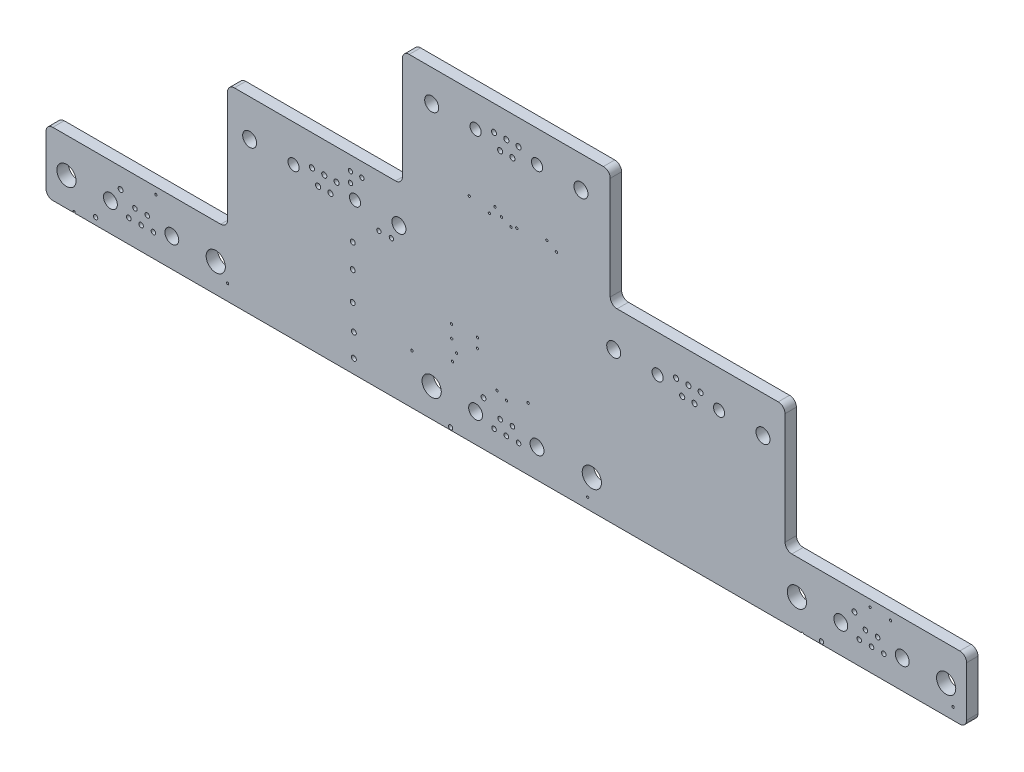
ISO-10303-21;
HEADER;
FILE_DESCRIPTION(('STEP AP214'),'2;1');
FILE_NAME('part.step','',(''),(''),'','','');
FILE_SCHEMA(('AUTOMOTIVE_DESIGN { 1 0 10303 214 1 1 1 1 }'));
ENDSEC;
DATA;
#1=APPLICATION_CONTEXT('core data for automotive mechanical design processes');
#2=APPLICATION_PROTOCOL_DEFINITION('international standard','automotive_design',2000,#1);
#3=PRODUCT_CONTEXT('',#1,'mechanical');
#4=PRODUCT('Part','Part','',(#3));
#5=PRODUCT_RELATED_PRODUCT_CATEGORY('part','',(#4));
#6=PRODUCT_DEFINITION_FORMATION('','',#4);
#7=PRODUCT_DEFINITION_CONTEXT('part definition',#1,'design');
#8=PRODUCT_DEFINITION('design','',#6,#7);
#9=PRODUCT_DEFINITION_SHAPE('','',#8);
#10=(LENGTH_UNIT() NAMED_UNIT(*) SI_UNIT(.MILLI.,.METRE.));
#11=(NAMED_UNIT(*) PLANE_ANGLE_UNIT() SI_UNIT($,.RADIAN.));
#12=(NAMED_UNIT(*) SI_UNIT($,.STERADIAN.) SOLID_ANGLE_UNIT());
#13=UNCERTAINTY_MEASURE_WITH_UNIT(LENGTH_MEASURE(1.E-05),#10,'distance_accuracy_value','');
#14=(GEOMETRIC_REPRESENTATION_CONTEXT(3) GLOBAL_UNCERTAINTY_ASSIGNED_CONTEXT((#13)) GLOBAL_UNIT_ASSIGNED_CONTEXT((#10,
#11,#12)) REPRESENTATION_CONTEXT('',''));
#15=CARTESIAN_POINT('',(0.,0.,0.));
#16=DIRECTION('',(0.,0.,1.));
#17=DIRECTION('',(1.,0.,0.));
#18=AXIS2_PLACEMENT_3D('',#15,#16,#17);
#19=CARTESIAN_POINT('',(0.,0.,2.54));
#20=DIRECTION('',(0.,0.,1.));
#21=DIRECTION('',(1.,0.,0.));
#22=AXIS2_PLACEMENT_3D('',#19,#20,#21);
#23=PLANE('',#22);
#24=CARTESIAN_POINT('',(106.46833333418,53.76333333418,2.54));
#25=DIRECTION('',(0.,0.,1.));
#26=DIRECTION('',(1.,0.,0.));
#27=AXIS2_PLACEMENT_3D('',#24,#25,#26);
#28=CIRCLE('',#27,0.25399999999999);
#29=CARTESIAN_POINT('',(106.72233333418,53.76333333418,2.54));
#30=VERTEX_POINT('',#29);
#31=EDGE_CURVE('E597',#30,#30,#28,.T.);
#32=ORIENTED_EDGE('',*,*,#31,.F.);
#33=EDGE_LOOP('',(#32));
#34=FACE_BOUND('',#33,.T.);
#35=CARTESIAN_POINT('',(97.6884,26.1366,2.54));
#36=DIRECTION('',(0.,0.,1.));
#37=DIRECTION('',(1.,0.,0.));
#38=AXIS2_PLACEMENT_3D('',#35,#36,#37);
#39=CIRCLE('',#38,0.25399999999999);
#40=CARTESIAN_POINT('',(97.9424,26.1366,2.54));
#41=VERTEX_POINT('',#40);
#42=EDGE_CURVE('E603',#41,#41,#39,.T.);
#43=ORIENTED_EDGE('',*,*,#42,.F.);
#44=EDGE_LOOP('',(#43));
#45=FACE_BOUND('',#44,.T.);
#46=CARTESIAN_POINT('',(122.301,9.652,2.54));
#47=DIRECTION('',(0.,0.,1.));
#48=DIRECTION('',(1.,0.,0.));
#49=AXIS2_PLACEMENT_3D('',#46,#47,#48);
#50=CIRCLE('',#49,0.25399999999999);
#51=CARTESIAN_POINT('',(122.555,9.652,2.54));
#52=VERTEX_POINT('',#51);
#53=EDGE_CURVE('E621',#52,#52,#50,.T.);
#54=ORIENTED_EDGE('',*,*,#53,.F.);
#55=EDGE_LOOP('',(#54));
#56=FACE_BOUND('',#55,.T.);
#57=CARTESIAN_POINT('',(97.6884,28.2448,2.54));
#58=DIRECTION('',(0.,0.,1.));
#59=DIRECTION('',(1.,0.,0.));
#60=AXIS2_PLACEMENT_3D('',#57,#58,#59);
#61=CIRCLE('',#60,0.25399999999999);
#62=CARTESIAN_POINT('',(97.9424,28.2448,2.54));
#63=VERTEX_POINT('',#62);
#64=EDGE_CURVE('E639',#63,#63,#61,.T.);
#65=ORIENTED_EDGE('',*,*,#64,.F.);
#66=EDGE_LOOP('',(#65));
#67=FACE_BOUND('',#66,.T.);
#68=CARTESIAN_POINT('',(189.9158,19.6596,2.54));
#69=DIRECTION('',(0.,0.,1.));
#70=DIRECTION('',(1.,0.,0.));
#71=AXIS2_PLACEMENT_3D('',#68,#69,#70);
#72=CIRCLE('',#71,0.254000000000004);
#73=CARTESIAN_POINT('',(190.1698,19.6596,2.54));
#74=VERTEX_POINT('',#73);
#75=EDGE_CURVE('E651',#74,#74,#72,.T.);
#76=ORIENTED_EDGE('',*,*,#75,.F.);
#77=EDGE_LOOP('',(#76));
#78=FACE_BOUND('',#77,.T.);
#79=CARTESIAN_POINT('',(93.0402,22.8854,2.54));
#80=DIRECTION('',(0.,0.,1.));
#81=DIRECTION('',(1.,0.,0.));
#82=AXIS2_PLACEMENT_3D('',#79,#80,#81);
#83=CIRCLE('',#82,0.25399999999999);
#84=CARTESIAN_POINT('',(93.2942,22.8854,2.54));
#85=VERTEX_POINT('',#84);
#86=EDGE_CURVE('E675',#85,#85,#83,.T.);
#87=ORIENTED_EDGE('',*,*,#86,.F.);
#88=EDGE_LOOP('',(#87));
#89=FACE_BOUND('',#88,.T.);
#90=CARTESIAN_POINT('',(102.0572,20.1676,2.54));
#91=DIRECTION('',(0.,0.,1.));
#92=DIRECTION('',(1.,0.,0.));
#93=AXIS2_PLACEMENT_3D('',#90,#91,#92);
#94=CIRCLE('',#93,0.25399999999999);
#95=CARTESIAN_POINT('',(102.3112,20.1676,2.54));
#96=VERTEX_POINT('',#95);
#97=EDGE_CURVE('E687',#96,#96,#94,.T.);
#98=ORIENTED_EDGE('',*,*,#97,.F.);
#99=EDGE_LOOP('',(#98));
#100=FACE_BOUND('',#99,.T.);
#101=CARTESIAN_POINT('',(113.19086666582,54.7878,2.54));
#102=DIRECTION('',(0.,0.,1.));
#103=DIRECTION('',(1.,0.,0.));
#104=AXIS2_PLACEMENT_3D('',#101,#102,#103);
#105=CIRCLE('',#104,0.25399999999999);
#106=CARTESIAN_POINT('',(113.44486666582,54.7878,2.54));
#107=VERTEX_POINT('',#106);
#108=EDGE_CURVE('E699',#107,#107,#105,.T.);
#109=ORIENTED_EDGE('',*,*,#108,.F.);
#110=EDGE_LOOP('',(#109));
#111=FACE_BOUND('',#110,.T.);
#112=CARTESIAN_POINT('',(95.8596,54.6608,2.54));
#113=DIRECTION('',(0.,0.,1.));
#114=DIRECTION('',(1.,0.,0.));
#115=AXIS2_PLACEMENT_3D('',#112,#113,#114);
#116=CIRCLE('',#115,0.25399999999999);
#117=CARTESIAN_POINT('',(96.1136,54.6608,2.54));
#118=VERTEX_POINT('',#117);
#119=EDGE_CURVE('E717',#118,#118,#116,.T.);
#120=ORIENTED_EDGE('',*,*,#119,.F.);
#121=EDGE_LOOP('',(#120));
#122=FACE_BOUND('',#121,.T.);
#123=CARTESIAN_POINT('',(109.0168,21.2344,2.54));
#124=DIRECTION('',(0.,0.,1.));
#125=DIRECTION('',(1.,0.,0.));
#126=AXIS2_PLACEMENT_3D('',#123,#124,#125);
#127=CIRCLE('',#126,0.25399999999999);
#128=CARTESIAN_POINT('',(109.2708,21.2344,2.54));
#129=VERTEX_POINT('',#128);
#130=EDGE_CURVE('E723',#129,#129,#127,.T.);
#131=ORIENTED_EDGE('',*,*,#130,.F.);
#132=EDGE_LOOP('',(#131));
#133=FACE_BOUND('',#132,.T.);
#134=CARTESIAN_POINT('',(115.316,53.594,2.54));
#135=DIRECTION('',(0.,0.,1.));
#136=DIRECTION('',(1.,0.,0.));
#137=AXIS2_PLACEMENT_3D('',#134,#135,#136);
#138=CIRCLE('',#137,0.25399999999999);
#139=CARTESIAN_POINT('',(115.57,53.594,2.54));
#140=VERTEX_POINT('',#139);
#141=EDGE_CURVE('E735',#140,#140,#138,.T.);
#142=ORIENTED_EDGE('',*,*,#141,.F.);
#143=EDGE_LOOP('',(#142));
#144=FACE_BOUND('',#143,.T.);
#145=CARTESIAN_POINT('',(69.85,27.432,2.54));
#146=DIRECTION('',(0.,0.,1.));
#147=DIRECTION('',(1.,0.,0.));
#148=AXIS2_PLACEMENT_3D('',#145,#146,#147);
#149=CIRCLE('',#148,0.546100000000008);
#150=CARTESIAN_POINT('',(70.3961,27.432,2.54));
#151=VERTEX_POINT('',#150);
#152=EDGE_CURVE('E753',#151,#151,#149,.T.);
#153=ORIENTED_EDGE('',*,*,#152,.F.);
#154=EDGE_LOOP('',(#153));
#155=FACE_BOUND('',#154,.T.);
#156=CARTESIAN_POINT('',(181.864,17.272,2.54));
#157=DIRECTION('',(0.,0.,1.));
#158=DIRECTION('',(1.,0.,0.));
#159=AXIS2_PLACEMENT_3D('',#156,#157,#158);
#160=CIRCLE('',#159,0.546099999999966);
#161=CARTESIAN_POINT('',(182.4101,17.272,2.54));
#162=VERTEX_POINT('',#161);
#163=EDGE_CURVE('E765',#162,#162,#160,.T.);
#164=ORIENTED_EDGE('',*,*,#163,.F.);
#165=EDGE_LOOP('',(#164));
#166=FACE_BOUND('',#165,.T.);
#167=CARTESIAN_POINT('',(18.034,17.018,2.54));
#168=DIRECTION('',(0.,0.,1.));
#169=DIRECTION('',(1.,0.,0.));
#170=AXIS2_PLACEMENT_3D('',#167,#168,#169);
#171=CIRCLE('',#170,0.546099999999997);
#172=CARTESIAN_POINT('',(18.5801,17.018,2.54));
#173=VERTEX_POINT('',#172);
#174=EDGE_CURVE('E777',#173,#173,#171,.T.);
#175=ORIENTED_EDGE('',*,*,#174,.F.);
#176=EDGE_LOOP('',(#175));
#177=FACE_BOUND('',#176,.T.);
#178=CARTESIAN_POINT('',(70.104,10.414,2.54));
#179=DIRECTION('',(0.,0.,1.));
#180=DIRECTION('',(1.,0.,0.));
#181=AXIS2_PLACEMENT_3D('',#178,#179,#180);
#182=CIRCLE('',#181,0.546100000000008);
#183=CARTESIAN_POINT('',(70.6501,10.414,2.54));
#184=VERTEX_POINT('',#183);
#185=EDGE_CURVE('E789',#184,#184,#182,.T.);
#186=ORIENTED_EDGE('',*,*,#185,.F.);
#187=EDGE_LOOP('',(#186));
#188=FACE_BOUND('',#187,.T.);
#189=CARTESIAN_POINT('',(169.0116,13.716,2.54));
#190=DIRECTION('',(0.,0.,1.));
#191=DIRECTION('',(1.,0.,0.));
#192=AXIS2_PLACEMENT_3D('',#189,#190,#191);
#193=CIRCLE('',#192,2.14629999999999);
#194=CARTESIAN_POINT('',(171.1579,13.716,2.54));
#195=VERTEX_POINT('',#194);
#196=EDGE_CURVE('E801',#195,#195,#193,.T.);
#197=ORIENTED_EDGE('',*,*,#196,.F.);
#198=EDGE_LOOP('',(#197));
#199=FACE_BOUND('',#198,.T.);
#200=CARTESIAN_POINT('',(178.816,13.716,2.54));
#201=DIRECTION('',(0.,0.,1.));
#202=DIRECTION('',(1.,0.,0.));
#203=AXIS2_PLACEMENT_3D('',#200,#201,#202);
#204=CIRCLE('',#203,1.54940000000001);
#205=CARTESIAN_POINT('',(180.3654,13.716,2.54));
#206=VERTEX_POINT('',#205);
#207=EDGE_CURVE('E813',#206,#206,#204,.T.);
#208=ORIENTED_EDGE('',*,*,#207,.F.);
#209=EDGE_LOOP('',(#208));
#210=FACE_BOUND('',#209,.T.);
#211=CARTESIAN_POINT('',(182.9308,12.446,2.54));
#212=DIRECTION('',(0.,0.,1.));
#213=DIRECTION('',(1.,0.,0.));
#214=AXIS2_PLACEMENT_3D('',#211,#212,#213);
#215=CIRCLE('',#214,0.508000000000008);
#216=CARTESIAN_POINT('',(183.4388,12.446,2.54));
#217=VERTEX_POINT('',#216);
#218=EDGE_CURVE('E825',#217,#217,#215,.T.);
#219=ORIENTED_EDGE('',*,*,#218,.F.);
#220=EDGE_LOOP('',(#219));
#221=FACE_BOUND('',#220,.T.);
#222=CARTESIAN_POINT('',(188.4172,12.446,2.54));
#223=DIRECTION('',(0.,0.,1.));
#224=DIRECTION('',(1.,0.,0.));
#225=AXIS2_PLACEMENT_3D('',#222,#223,#224);
#226=CIRCLE('',#225,0.508000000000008);
#227=CARTESIAN_POINT('',(188.9252,12.446,2.54));
#228=VERTEX_POINT('',#227);
#229=EDGE_CURVE('E837',#228,#228,#226,.T.);
#230=ORIENTED_EDGE('',*,*,#229,.F.);
#231=EDGE_LOOP('',(#230));
#232=FACE_BOUND('',#231,.T.);
#233=CARTESIAN_POINT('',(187.0456,14.986,2.54));
#234=DIRECTION('',(0.,0.,1.));
#235=DIRECTION('',(1.,0.,0.));
#236=AXIS2_PLACEMENT_3D('',#233,#234,#235);
#237=CIRCLE('',#236,0.507999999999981);
#238=CARTESIAN_POINT('',(187.5536,14.986,2.54));
#239=VERTEX_POINT('',#238);
#240=EDGE_CURVE('E849',#239,#239,#237,.T.);
#241=ORIENTED_EDGE('',*,*,#240,.F.);
#242=EDGE_LOOP('',(#241));
#243=FACE_BOUND('',#242,.T.);
#244=CARTESIAN_POINT('',(123.233435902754,13.9558451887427,2.54));
#245=DIRECTION('',(0.,0.,1.));
#246=DIRECTION('',(1.,0.,0.));
#247=AXIS2_PLACEMENT_3D('',#244,#245,#246);
#248=CIRCLE('',#247,2.14630000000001);
#249=CARTESIAN_POINT('',(125.379735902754,13.9558451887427,2.54));
#250=VERTEX_POINT('',#249);
#251=EDGE_CURVE('E861',#250,#250,#248,.T.);
#252=ORIENTED_EDGE('',*,*,#251,.F.);
#253=EDGE_LOOP('',(#252));
#254=FACE_BOUND('',#253,.T.);
#255=CARTESIAN_POINT('',(110.998,13.716,2.54));
#256=DIRECTION('',(0.,0.,1.));
#257=DIRECTION('',(1.,0.,0.));
#258=AXIS2_PLACEMENT_3D('',#255,#256,#257);
#259=CIRCLE('',#258,1.54939999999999);
#260=CARTESIAN_POINT('',(112.5474,13.716,2.54));
#261=VERTEX_POINT('',#260);
#262=EDGE_CURVE('E873',#261,#261,#259,.T.);
#263=ORIENTED_EDGE('',*,*,#262,.F.);
#264=EDGE_LOOP('',(#263));
#265=FACE_BOUND('',#264,.T.);
#266=CARTESIAN_POINT('',(104.14,12.446,2.54));
#267=DIRECTION('',(0.,0.,1.));
#268=DIRECTION('',(1.,0.,0.));
#269=AXIS2_PLACEMENT_3D('',#266,#267,#268);
#270=CIRCLE('',#269,0.507999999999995);
#271=CARTESIAN_POINT('',(104.648,12.446,2.54));
#272=VERTEX_POINT('',#271);
#273=EDGE_CURVE('E885',#272,#272,#270,.T.);
#274=ORIENTED_EDGE('',*,*,#273,.F.);
#275=EDGE_LOOP('',(#274));
#276=FACE_BOUND('',#275,.T.);
#277=CARTESIAN_POINT('',(102.7684,14.986,2.54));
#278=DIRECTION('',(0.,0.,1.));
#279=DIRECTION('',(1.,0.,0.));
#280=AXIS2_PLACEMENT_3D('',#277,#278,#279);
#281=CIRCLE('',#280,0.507999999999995);
#282=CARTESIAN_POINT('',(103.2764,14.986,2.54));
#283=VERTEX_POINT('',#282);
#284=EDGE_CURVE('E897',#283,#283,#281,.T.);
#285=ORIENTED_EDGE('',*,*,#284,.F.);
#286=EDGE_LOOP('',(#285));
#287=FACE_BOUND('',#286,.T.);
#288=CARTESIAN_POINT('',(5.9436,13.716,2.54));
#289=DIRECTION('',(0.,0.,1.));
#290=DIRECTION('',(1.,0.,0.));
#291=AXIS2_PLACEMENT_3D('',#288,#289,#290);
#292=CIRCLE('',#291,2.1463);
#293=CARTESIAN_POINT('',(8.0899,13.716,2.54));
#294=VERTEX_POINT('',#293);
#295=EDGE_CURVE('E909',#294,#294,#292,.T.);
#296=ORIENTED_EDGE('',*,*,#295,.F.);
#297=EDGE_LOOP('',(#296));
#298=FACE_BOUND('',#297,.T.);
#299=CARTESIAN_POINT('',(15.748,13.716,2.54));
#300=DIRECTION('',(0.,0.,1.));
#301=DIRECTION('',(1.,0.,0.));
#302=AXIS2_PLACEMENT_3D('',#299,#300,#301);
#303=CIRCLE('',#302,1.5494);
#304=CARTESIAN_POINT('',(17.2974,13.716,2.54));
#305=VERTEX_POINT('',#304);
#306=EDGE_CURVE('E921',#305,#305,#303,.T.);
#307=ORIENTED_EDGE('',*,*,#306,.F.);
#308=EDGE_LOOP('',(#307));
#309=FACE_BOUND('',#308,.T.);
#310=CARTESIAN_POINT('',(19.8628,12.446,2.54));
#311=DIRECTION('',(0.,0.,1.));
#312=DIRECTION('',(1.,0.,0.));
#313=AXIS2_PLACEMENT_3D('',#310,#311,#312);
#314=CIRCLE('',#313,0.508000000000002);
#315=CARTESIAN_POINT('',(20.3708,12.446,2.54));
#316=VERTEX_POINT('',#315);
#317=EDGE_CURVE('E933',#316,#316,#314,.T.);
#318=ORIENTED_EDGE('',*,*,#317,.F.);
#319=EDGE_LOOP('',(#318));
#320=FACE_BOUND('',#319,.T.);
#321=CARTESIAN_POINT('',(25.3492,12.446,2.54));
#322=DIRECTION('',(0.,0.,1.));
#323=DIRECTION('',(1.,0.,0.));
#324=AXIS2_PLACEMENT_3D('',#321,#322,#323);
#325=CIRCLE('',#324,0.507999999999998);
#326=CARTESIAN_POINT('',(25.8572,12.446,2.54));
#327=VERTEX_POINT('',#326);
#328=EDGE_CURVE('E945',#327,#327,#325,.T.);
#329=ORIENTED_EDGE('',*,*,#328,.F.);
#330=EDGE_LOOP('',(#329));
#331=FACE_BOUND('',#330,.T.);
#332=CARTESIAN_POINT('',(23.9776,14.986,2.54));
#333=DIRECTION('',(0.,0.,1.));
#334=DIRECTION('',(1.,0.,0.));
#335=AXIS2_PLACEMENT_3D('',#332,#333,#334);
#336=CIRCLE('',#335,0.508000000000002);
#337=CARTESIAN_POINT('',(24.4856,14.986,2.54));
#338=VERTEX_POINT('',#337);
#339=EDGE_CURVE('E957',#338,#338,#336,.T.);
#340=ORIENTED_EDGE('',*,*,#339,.F.);
#341=EDGE_LOOP('',(#340));
#342=FACE_BOUND('',#341,.T.);
#343=CARTESIAN_POINT('',(102.7684,66.8894451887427,2.54));
#344=DIRECTION('',(0.,0.,1.));
#345=DIRECTION('',(1.,0.,0.));
#346=AXIS2_PLACEMENT_3D('',#343,#344,#345);
#347=CIRCLE('',#346,0.57150000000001);
#348=CARTESIAN_POINT('',(103.3399,66.8894451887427,2.54));
#349=VERTEX_POINT('',#348);
#350=EDGE_CURVE('E969',#349,#349,#347,.T.);
#351=ORIENTED_EDGE('',*,*,#350,.F.);
#352=EDGE_LOOP('',(#351));
#353=FACE_BOUND('',#352,.T.);
#354=CARTESIAN_POINT('',(120.8024,68.3118451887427,2.54));
#355=DIRECTION('',(0.,0.,1.));
#356=DIRECTION('',(1.,0.,0.));
#357=AXIS2_PLACEMENT_3D('',#354,#355,#356);
#358=CIRCLE('',#357,1.56210000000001);
#359=CARTESIAN_POINT('',(122.3645,68.3118451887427,2.54));
#360=VERTEX_POINT('',#359);
#361=EDGE_CURVE('E981',#360,#360,#358,.T.);
#362=ORIENTED_EDGE('',*,*,#361,.F.);
#363=EDGE_LOOP('',(#362));
#364=FACE_BOUND('',#363,.T.);
#365=CARTESIAN_POINT('',(56.642,41.1338451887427,2.54));
#366=DIRECTION('',(0.,0.,1.));
#367=DIRECTION('',(-1.,0.,0.));
#368=AXIS2_PLACEMENT_3D('',#365,#366,#367);
#369=CIRCLE('',#368,1.2446);
#370=CARTESIAN_POINT('',(55.3974,41.1338451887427,2.54));
#371=VERTEX_POINT('',#370);
#372=EDGE_CURVE('E993',#371,#371,#369,.T.);
#373=ORIENTED_EDGE('',*,*,#372,.F.);
#374=EDGE_LOOP('',(#373));
#375=FACE_BOUND('',#374,.T.);
#376=CARTESIAN_POINT('',(63.5,42.5562451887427,2.54));
#377=DIRECTION('',(0.,0.,1.));
#378=DIRECTION('',(-1.,0.,0.));
#379=AXIS2_PLACEMENT_3D('',#376,#377,#378);
#380=CIRCLE('',#379,0.571500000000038);
#381=CARTESIAN_POINT('',(62.9284999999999,42.5562451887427,2.54));
#382=VERTEX_POINT('',#381);
#383=EDGE_CURVE('E1005',#382,#382,#380,.T.);
#384=ORIENTED_EDGE('',*,*,#383,.F.);
#385=EDGE_LOOP('',(#384));
#386=FACE_BOUND('',#385,.T.);
#387=CARTESIAN_POINT('',(64.8716,39.7114451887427,2.54));
#388=DIRECTION('',(0.,0.,1.));
#389=DIRECTION('',(-1.,0.,0.));
#390=AXIS2_PLACEMENT_3D('',#387,#388,#389);
#391=CIRCLE('',#390,0.571499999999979);
#392=CARTESIAN_POINT('',(64.3001,39.7114451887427,2.54));
#393=VERTEX_POINT('',#392);
#394=EDGE_CURVE('E1017',#393,#393,#391,.T.);
#395=ORIENTED_EDGE('',*,*,#394,.F.);
#396=EDGE_LOOP('',(#395));
#397=FACE_BOUND('',#396,.T.);
#398=CARTESIAN_POINT('',(70.358,41.1338451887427,2.54));
#399=DIRECTION('',(0.,0.,1.));
#400=DIRECTION('',(-1.,0.,0.));
#401=AXIS2_PLACEMENT_3D('',#398,#399,#400);
#402=CIRCLE('',#401,1.2446);
#403=CARTESIAN_POINT('',(69.1134,41.1338451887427,2.54));
#404=VERTEX_POINT('',#403);
#405=EDGE_CURVE('E1029',#404,#404,#402,.T.);
#406=ORIENTED_EDGE('',*,*,#405,.F.);
#407=EDGE_LOOP('',(#406));
#408=FACE_BOUND('',#407,.T.);
#409=CARTESIAN_POINT('',(80.1624,41.1338451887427,2.54));
#410=DIRECTION('',(0.,0.,1.));
#411=DIRECTION('',(-1.,0.,0.));
#412=AXIS2_PLACEMENT_3D('',#409,#410,#411);
#413=CIRCLE('',#412,1.56210000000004);
#414=CARTESIAN_POINT('',(78.6003,41.1338451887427,2.54));
#415=VERTEX_POINT('',#414);
#416=EDGE_CURVE('E1041',#415,#415,#413,.T.);
#417=ORIENTED_EDGE('',*,*,#416,.F.);
#418=EDGE_LOOP('',(#417));
#419=FACE_BOUND('',#418,.T.);
#420=CARTESIAN_POINT('',(143.4084,39.7114451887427,2.54));
#421=DIRECTION('',(0.,0.,1.));
#422=DIRECTION('',(1.,0.,0.));
#423=AXIS2_PLACEMENT_3D('',#420,#421,#422);
#424=CIRCLE('',#423,0.571499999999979);
#425=CARTESIAN_POINT('',(143.9799,39.7114451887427,2.54));
#426=VERTEX_POINT('',#425);
#427=EDGE_CURVE('E1053',#426,#426,#424,.T.);
#428=ORIENTED_EDGE('',*,*,#427,.F.);
#429=EDGE_LOOP('',(#428));
#430=FACE_BOUND('',#429,.T.);
#431=CARTESIAN_POINT('',(161.4424,41.1338451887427,2.54));
#432=DIRECTION('',(0.,0.,1.));
#433=DIRECTION('',(1.,0.,0.));
#434=AXIS2_PLACEMENT_3D('',#431,#432,#433);
#435=CIRCLE('',#434,1.56210000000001);
#436=CARTESIAN_POINT('',(163.0045,41.1338451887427,2.54));
#437=VERTEX_POINT('',#436);
#438=EDGE_CURVE('E1065',#437,#437,#435,.T.);
#439=ORIENTED_EDGE('',*,*,#438,.F.);
#440=EDGE_LOOP('',(#439));
#441=FACE_BOUND('',#440,.T.);
#442=CARTESIAN_POINT('',(147.5232,42.5562451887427,2.54));
#443=DIRECTION('',(0.,0.,1.));
#444=DIRECTION('',(1.,0.,0.));
#445=AXIS2_PLACEMENT_3D('',#442,#443,#444);
#446=CIRCLE('',#445,0.571500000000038);
#447=CARTESIAN_POINT('',(148.0947,42.5562451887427,2.54));
#448=VERTEX_POINT('',#447);
#449=EDGE_CURVE('E310',#448,#448,#446,.T.);
#450=ORIENTED_EDGE('',*,*,#449,.F.);
#451=EDGE_LOOP('',(#450));
#452=FACE_BOUND('',#451,.T.);
#453=CARTESIAN_POINT('',(106.8832,69.7342451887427,2.54));
#454=DIRECTION('',(0.,0.,1.));
#455=DIRECTION('',(1.,0.,0.));
#456=AXIS2_PLACEMENT_3D('',#453,#454,#455);
#457=CIRCLE('',#456,0.57150000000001);
#458=CARTESIAN_POINT('',(107.4547,69.7342451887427,2.54));
#459=VERTEX_POINT('',#458);
#460=EDGE_CURVE('E322',#459,#459,#457,.T.);
#461=ORIENTED_EDGE('',*,*,#460,.F.);
#462=EDGE_LOOP('',(#461));
#463=FACE_BOUND('',#462,.T.);
#464=CARTESIAN_POINT('',(69.342,43.942,2.54));
#465=DIRECTION('',(0.,0.,1.));
#466=DIRECTION('',(1.,0.,0.));
#467=AXIS2_PLACEMENT_3D('',#464,#465,#466);
#468=CIRCLE('',#467,0.4826);
#469=CARTESIAN_POINT('',(69.8246,43.942,2.54));
#470=VERTEX_POINT('',#469);
#471=EDGE_CURVE('E334',#470,#470,#468,.T.);
#472=ORIENTED_EDGE('',*,*,#471,.F.);
#473=EDGE_LOOP('',(#472));
#474=FACE_BOUND('',#473,.T.);
#475=CARTESIAN_POINT('',(78.486,37.846,2.54));
#476=DIRECTION('',(0.,0.,1.));
#477=DIRECTION('',(1.,0.,0.));
#478=AXIS2_PLACEMENT_3D('',#475,#476,#477);
#479=CIRCLE('',#478,0.4826);
#480=CARTESIAN_POINT('',(78.9686,37.846,2.54));
#481=VERTEX_POINT('',#480);
#482=EDGE_CURVE('E346',#481,#481,#479,.T.);
#483=ORIENTED_EDGE('',*,*,#482,.F.);
#484=EDGE_LOOP('',(#483));
#485=FACE_BOUND('',#484,.T.);
#486=CARTESIAN_POINT('',(104.14,69.7342451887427,2.54));
#487=DIRECTION('',(0.,0.,1.));
#488=DIRECTION('',(1.,0.,0.));
#489=AXIS2_PLACEMENT_3D('',#486,#487,#488);
#490=CIRCLE('',#489,0.57150000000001);
#491=CARTESIAN_POINT('',(104.7115,69.7342451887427,2.54));
#492=VERTEX_POINT('',#491);
#493=EDGE_CURVE('E358',#492,#492,#490,.T.);
#494=ORIENTED_EDGE('',*,*,#493,.F.);
#495=EDGE_LOOP('',(#494));
#496=FACE_BOUND('',#495,.T.);
#497=CARTESIAN_POINT('',(91.694,7.874,2.54));
#498=DIRECTION('',(0.,0.,1.));
#499=DIRECTION('',(1.,0.,0.));
#500=AXIS2_PLACEMENT_3D('',#497,#498,#499);
#501=CIRCLE('',#500,0.4826);
#502=CARTESIAN_POINT('',(92.1766,7.874,2.54));
#503=VERTEX_POINT('',#502);
#504=EDGE_CURVE('E376',#503,#503,#501,.T.);
#505=ORIENTED_EDGE('',*,*,#504,.F.);
#506=EDGE_LOOP('',(#505));
#507=FACE_BOUND('',#506,.T.);
#508=CARTESIAN_POINT('',(142.0368,42.5562451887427,2.54));
#509=DIRECTION('',(0.,0.,1.));
#510=DIRECTION('',(1.,0.,0.));
#511=AXIS2_PLACEMENT_3D('',#508,#509,#510);
#512=CIRCLE('',#511,0.571500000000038);
#513=CARTESIAN_POINT('',(142.6083,42.5562451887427,2.54));
#514=VERTEX_POINT('',#513);
#515=EDGE_CURVE('E388',#514,#514,#512,.T.);
#516=ORIENTED_EDGE('',*,*,#515,.F.);
#517=EDGE_LOOP('',(#516));
#518=FACE_BOUND('',#517,.T.);
#519=CARTESIAN_POINT('',(110.998,68.3118451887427,2.54));
#520=DIRECTION('',(0.,0.,1.));
#521=DIRECTION('',(1.,0.,0.));
#522=AXIS2_PLACEMENT_3D('',#519,#520,#521);
#523=CIRCLE('',#522,1.2446);
#524=CARTESIAN_POINT('',(112.2426,68.3118451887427,2.54));
#525=VERTEX_POINT('',#524);
#526=EDGE_CURVE('E400',#525,#525,#523,.T.);
#527=ORIENTED_EDGE('',*,*,#526,.F.);
#528=EDGE_LOOP('',(#527));
#529=FACE_BOUND('',#528,.T.);
#530=CARTESIAN_POINT('',(151.638,41.1338451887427,2.54));
#531=DIRECTION('',(0.,0.,1.));
#532=DIRECTION('',(1.,0.,0.));
#533=AXIS2_PLACEMENT_3D('',#530,#531,#532);
#534=CIRCLE('',#533,1.2446);
#535=CARTESIAN_POINT('',(152.8826,41.1338451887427,2.54));
#536=VERTEX_POINT('',#535);
#537=EDGE_CURVE('E394',#536,#536,#534,.T.);
#538=ORIENTED_EDGE('',*,*,#537,.F.);
#539=EDGE_LOOP('',(#538));
#540=FACE_BOUND('',#539,.T.);
#541=CARTESIAN_POINT('',(12.446,8.89,2.54));
#542=DIRECTION('',(0.,0.,1.));
#543=DIRECTION('',(1.,0.,0.));
#544=AXIS2_PLACEMENT_3D('',#541,#542,#543);
#545=CIRCLE('',#544,0.4826);
#546=CARTESIAN_POINT('',(12.9286,8.89,2.54));
#547=VERTEX_POINT('',#546);
#548=EDGE_CURVE('E382',#547,#547,#545,.T.);
#549=ORIENTED_EDGE('',*,*,#548,.F.);
#550=EDGE_LOOP('',(#549));
#551=FACE_BOUND('',#550,.T.);
#552=CARTESIAN_POINT('',(174.498,7.874,2.54));
#553=DIRECTION('',(0.,0.,1.));
#554=DIRECTION('',(1.,0.,0.));
#555=AXIS2_PLACEMENT_3D('',#552,#553,#554);
#556=CIRCLE('',#555,0.4826);
#557=CARTESIAN_POINT('',(174.9806,7.874,2.54));
#558=VERTEX_POINT('',#557);
#559=EDGE_CURVE('E370',#558,#558,#556,.T.);
#560=ORIENTED_EDGE('',*,*,#559,.F.);
#561=EDGE_LOOP('',(#560));
#562=FACE_BOUND('',#561,.T.);
#563=CARTESIAN_POINT('',(101.3968,69.7342451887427,2.54));
#564=DIRECTION('',(0.,0.,1.));
#565=DIRECTION('',(1.,0.,0.));
#566=AXIS2_PLACEMENT_3D('',#563,#564,#565);
#567=CIRCLE('',#566,0.57150000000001);
#568=CARTESIAN_POINT('',(101.9683,69.7342451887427,2.54));
#569=VERTEX_POINT('',#568);
#570=EDGE_CURVE('E364',#569,#569,#567,.T.);
#571=ORIENTED_EDGE('',*,*,#570,.F.);
#572=EDGE_LOOP('',(#571));
#573=FACE_BOUND('',#572,.T.);
#574=CARTESIAN_POINT('',(75.692,37.846,2.54));
#575=DIRECTION('',(0.,0.,1.));
#576=DIRECTION('',(1.,0.,0.));
#577=AXIS2_PLACEMENT_3D('',#574,#575,#576);
#578=CIRCLE('',#577,0.4826);
#579=CARTESIAN_POINT('',(76.1746,37.846,2.54));
#580=VERTEX_POINT('',#579);
#581=EDGE_CURVE('E352',#580,#580,#578,.T.);
#582=ORIENTED_EDGE('',*,*,#581,.F.);
#583=EDGE_LOOP('',(#582));
#584=FACE_BOUND('',#583,.T.);
#585=CARTESIAN_POINT('',(69.342,46.228,2.54));
#586=DIRECTION('',(0.,0.,1.));
#587=DIRECTION('',(1.,0.,0.));
#588=AXIS2_PLACEMENT_3D('',#585,#586,#587);
#589=CIRCLE('',#588,0.4826);
#590=CARTESIAN_POINT('',(69.8246,46.228,2.54));
#591=VERTEX_POINT('',#590);
#592=EDGE_CURVE('E340',#591,#591,#589,.T.);
#593=ORIENTED_EDGE('',*,*,#592,.F.);
#594=EDGE_LOOP('',(#593));
#595=FACE_BOUND('',#594,.T.);
#596=CARTESIAN_POINT('',(71.882,46.228,2.54));
#597=DIRECTION('',(0.,0.,1.));
#598=DIRECTION('',(1.,0.,0.));
#599=AXIS2_PLACEMENT_3D('',#596,#597,#598);
#600=CIRCLE('',#599,0.482600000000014);
#601=CARTESIAN_POINT('',(72.3646,46.228,2.54));
#602=VERTEX_POINT('',#601);
#603=EDGE_CURVE('E328',#602,#602,#600,.T.);
#604=ORIENTED_EDGE('',*,*,#603,.F.);
#605=EDGE_LOOP('',(#604));
#606=FACE_BOUND('',#605,.T.);
#607=CARTESIAN_POINT('',(144.78,42.5562451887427,2.54));
#608=DIRECTION('',(0.,0.,1.));
#609=DIRECTION('',(1.,0.,0.));
#610=AXIS2_PLACEMENT_3D('',#607,#608,#609);
#611=CIRCLE('',#610,0.571500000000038);
#612=CARTESIAN_POINT('',(145.3515,42.5562451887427,2.54));
#613=VERTEX_POINT('',#612);
#614=EDGE_CURVE('E316',#613,#613,#611,.T.);
#615=ORIENTED_EDGE('',*,*,#614,.F.);
#616=EDGE_LOOP('',(#615));
#617=FACE_BOUND('',#616,.T.);
#618=CARTESIAN_POINT('',(137.922,41.1338451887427,2.54));
#619=DIRECTION('',(0.,0.,1.));
#620=DIRECTION('',(1.,0.,0.));
#621=AXIS2_PLACEMENT_3D('',#618,#619,#620);
#622=CIRCLE('',#621,1.2446);
#623=CARTESIAN_POINT('',(139.1666,41.1338451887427,2.54));
#624=VERTEX_POINT('',#623);
#625=EDGE_CURVE('E295',#624,#624,#622,.T.);
#626=ORIENTED_EDGE('',*,*,#625,.F.);
#627=EDGE_LOOP('',(#626));
#628=FACE_BOUND('',#627,.T.);
#629=CARTESIAN_POINT('',(128.1176,41.1338451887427,2.54));
#630=DIRECTION('',(0.,0.,1.));
#631=DIRECTION('',(1.,0.,0.));
#632=AXIS2_PLACEMENT_3D('',#629,#630,#631);
#633=CIRCLE('',#632,1.56210000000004);
#634=CARTESIAN_POINT('',(129.6797,41.1338451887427,2.54));
#635=VERTEX_POINT('',#634);
#636=EDGE_CURVE('E1059',#635,#635,#633,.T.);
#637=ORIENTED_EDGE('',*,*,#636,.F.);
#638=EDGE_LOOP('',(#637));
#639=FACE_BOUND('',#638,.T.);
#640=CARTESIAN_POINT('',(146.1516,39.7114451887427,2.54));
#641=DIRECTION('',(0.,0.,1.));
#642=DIRECTION('',(1.,0.,0.));
#643=AXIS2_PLACEMENT_3D('',#640,#641,#642);
#644=CIRCLE('',#643,0.571499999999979);
#645=CARTESIAN_POINT('',(146.7231,39.7114451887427,2.54));
#646=VERTEX_POINT('',#645);
#647=EDGE_CURVE('E1047',#646,#646,#644,.T.);
#648=ORIENTED_EDGE('',*,*,#647,.F.);
#649=EDGE_LOOP('',(#648));
#650=FACE_BOUND('',#649,.T.);
#651=CARTESIAN_POINT('',(46.8376,41.1338451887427,2.54));
#652=DIRECTION('',(0.,0.,1.));
#653=DIRECTION('',(-1.,0.,0.));
#654=AXIS2_PLACEMENT_3D('',#651,#652,#653);
#655=CIRCLE('',#654,1.56210000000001);
#656=CARTESIAN_POINT('',(45.2754999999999,41.1338451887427,2.54));
#657=VERTEX_POINT('',#656);
#658=EDGE_CURVE('E1035',#657,#657,#655,.T.);
#659=ORIENTED_EDGE('',*,*,#658,.F.);
#660=EDGE_LOOP('',(#659));
#661=FACE_BOUND('',#660,.T.);
#662=CARTESIAN_POINT('',(62.1284,39.7114451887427,2.54));
#663=DIRECTION('',(0.,0.,1.));
#664=DIRECTION('',(-1.,0.,0.));
#665=AXIS2_PLACEMENT_3D('',#662,#663,#664);
#666=CIRCLE('',#665,0.571499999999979);
#667=CARTESIAN_POINT('',(61.5569,39.7114451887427,2.54));
#668=VERTEX_POINT('',#667);
#669=EDGE_CURVE('E1023',#668,#668,#666,.T.);
#670=ORIENTED_EDGE('',*,*,#669,.F.);
#671=EDGE_LOOP('',(#670));
#672=FACE_BOUND('',#671,.T.);
#673=CARTESIAN_POINT('',(60.7568,42.5562451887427,2.54));
#674=DIRECTION('',(0.,0.,1.));
#675=DIRECTION('',(-1.,0.,0.));
#676=AXIS2_PLACEMENT_3D('',#673,#674,#675);
#677=CIRCLE('',#676,0.571500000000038);
#678=CARTESIAN_POINT('',(60.1852999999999,42.5562451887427,2.54));
#679=VERTEX_POINT('',#678);
#680=EDGE_CURVE('E1011',#679,#679,#677,.T.);
#681=ORIENTED_EDGE('',*,*,#680,.F.);
#682=EDGE_LOOP('',(#681));
#683=FACE_BOUND('',#682,.T.);
#684=CARTESIAN_POINT('',(66.2432,42.5562451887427,2.54));
#685=DIRECTION('',(0.,0.,1.));
#686=DIRECTION('',(-1.,0.,0.));
#687=AXIS2_PLACEMENT_3D('',#684,#685,#686);
#688=CIRCLE('',#687,0.571500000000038);
#689=CARTESIAN_POINT('',(65.6716999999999,42.5562451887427,2.54));
#690=VERTEX_POINT('',#689);
#691=EDGE_CURVE('E999',#690,#690,#688,.T.);
#692=ORIENTED_EDGE('',*,*,#691,.F.);
#693=EDGE_LOOP('',(#692));
#694=FACE_BOUND('',#693,.T.);
#695=CARTESIAN_POINT('',(97.282,68.3118451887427,2.54));
#696=DIRECTION('',(0.,0.,1.));
#697=DIRECTION('',(1.,0.,0.));
#698=AXIS2_PLACEMENT_3D('',#695,#696,#697);
#699=CIRCLE('',#698,1.2446);
#700=CARTESIAN_POINT('',(98.5266,68.3118451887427,2.54));
#701=VERTEX_POINT('',#700);
#702=EDGE_CURVE('E987',#701,#701,#699,.T.);
#703=ORIENTED_EDGE('',*,*,#702,.F.);
#704=EDGE_LOOP('',(#703));
#705=FACE_BOUND('',#704,.T.);
#706=CARTESIAN_POINT('',(87.4776,68.3118451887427,2.54));
#707=DIRECTION('',(0.,0.,1.));
#708=DIRECTION('',(1.,0.,0.));
#709=AXIS2_PLACEMENT_3D('',#706,#707,#708);
#710=CIRCLE('',#709,1.56210000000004);
#711=CARTESIAN_POINT('',(89.0397,68.3118451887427,2.54));
#712=VERTEX_POINT('',#711);
#713=EDGE_CURVE('E975',#712,#712,#710,.T.);
#714=ORIENTED_EDGE('',*,*,#713,.F.);
#715=EDGE_LOOP('',(#714));
#716=FACE_BOUND('',#715,.T.);
#717=CARTESIAN_POINT('',(105.5116,66.8894451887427,2.54));
#718=DIRECTION('',(0.,0.,1.));
#719=DIRECTION('',(1.,0.,0.));
#720=AXIS2_PLACEMENT_3D('',#717,#718,#719);
#721=CIRCLE('',#720,0.57150000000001);
#722=CARTESIAN_POINT('',(106.0831,66.8894451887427,2.54));
#723=VERTEX_POINT('',#722);
#724=EDGE_CURVE('E963',#723,#723,#721,.T.);
#725=ORIENTED_EDGE('',*,*,#724,.F.);
#726=EDGE_LOOP('',(#725));
#727=FACE_BOUND('',#726,.T.);
#728=CARTESIAN_POINT('',(21.2344,14.986,2.54));
#729=DIRECTION('',(0.,0.,1.));
#730=DIRECTION('',(1.,0.,0.));
#731=AXIS2_PLACEMENT_3D('',#728,#729,#730);
#732=CIRCLE('',#731,0.508000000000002);
#733=CARTESIAN_POINT('',(21.7424,14.986,2.54));
#734=VERTEX_POINT('',#733);
#735=EDGE_CURVE('E951',#734,#734,#732,.T.);
#736=ORIENTED_EDGE('',*,*,#735,.F.);
#737=EDGE_LOOP('',(#736));
#738=FACE_BOUND('',#737,.T.);
#739=CARTESIAN_POINT('',(22.606,12.446,2.54));
#740=DIRECTION('',(0.,0.,1.));
#741=DIRECTION('',(1.,0.,0.));
#742=AXIS2_PLACEMENT_3D('',#739,#740,#741);
#743=CIRCLE('',#742,0.508000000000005);
#744=CARTESIAN_POINT('',(23.114,12.446,2.54));
#745=VERTEX_POINT('',#744);
#746=EDGE_CURVE('E939',#745,#745,#743,.T.);
#747=ORIENTED_EDGE('',*,*,#746,.F.);
#748=EDGE_LOOP('',(#747));
#749=FACE_BOUND('',#748,.T.);
#750=CARTESIAN_POINT('',(29.464,13.716,2.54));
#751=DIRECTION('',(0.,0.,1.));
#752=DIRECTION('',(1.,0.,0.));
#753=AXIS2_PLACEMENT_3D('',#750,#751,#752);
#754=CIRCLE('',#753,1.5494);
#755=CARTESIAN_POINT('',(31.0134,13.716,2.54));
#756=VERTEX_POINT('',#755);
#757=EDGE_CURVE('E927',#756,#756,#754,.T.);
#758=ORIENTED_EDGE('',*,*,#757,.F.);
#759=EDGE_LOOP('',(#758));
#760=FACE_BOUND('',#759,.T.);
#761=CARTESIAN_POINT('',(39.2684,13.716,2.54));
#762=DIRECTION('',(0.,0.,1.));
#763=DIRECTION('',(1.,0.,0.));
#764=AXIS2_PLACEMENT_3D('',#761,#762,#763);
#765=CIRCLE('',#764,2.1463);
#766=CARTESIAN_POINT('',(41.4147,13.716,2.54));
#767=VERTEX_POINT('',#766);
#768=EDGE_CURVE('E915',#767,#767,#765,.T.);
#769=ORIENTED_EDGE('',*,*,#768,.F.);
#770=EDGE_LOOP('',(#769));
#771=FACE_BOUND('',#770,.T.);
#772=CARTESIAN_POINT('',(105.5116,14.986,2.54));
#773=DIRECTION('',(0.,0.,1.));
#774=DIRECTION('',(1.,0.,0.));
#775=AXIS2_PLACEMENT_3D('',#772,#773,#774);
#776=CIRCLE('',#775,0.508000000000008);
#777=CARTESIAN_POINT('',(106.0196,14.986,2.54));
#778=VERTEX_POINT('',#777);
#779=EDGE_CURVE('E903',#778,#778,#776,.T.);
#780=ORIENTED_EDGE('',*,*,#779,.F.);
#781=EDGE_LOOP('',(#780));
#782=FACE_BOUND('',#781,.T.);
#783=CARTESIAN_POINT('',(106.8832,12.446,2.54));
#784=DIRECTION('',(0.,0.,1.));
#785=DIRECTION('',(1.,0.,0.));
#786=AXIS2_PLACEMENT_3D('',#783,#784,#785);
#787=CIRCLE('',#786,0.508000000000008);
#788=CARTESIAN_POINT('',(107.3912,12.446,2.54));
#789=VERTEX_POINT('',#788);
#790=EDGE_CURVE('E891',#789,#789,#787,.T.);
#791=ORIENTED_EDGE('',*,*,#790,.F.);
#792=EDGE_LOOP('',(#791));
#793=FACE_BOUND('',#792,.T.);
#794=CARTESIAN_POINT('',(101.3968,12.446,2.54));
#795=DIRECTION('',(0.,0.,1.));
#796=DIRECTION('',(1.,0.,0.));
#797=AXIS2_PLACEMENT_3D('',#794,#795,#796);
#798=CIRCLE('',#797,0.508000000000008);
#799=CARTESIAN_POINT('',(101.9048,12.446,2.54));
#800=VERTEX_POINT('',#799);
#801=EDGE_CURVE('E879',#800,#800,#798,.T.);
#802=ORIENTED_EDGE('',*,*,#801,.F.);
#803=EDGE_LOOP('',(#802));
#804=FACE_BOUND('',#803,.T.);
#805=CARTESIAN_POINT('',(97.282,13.716,2.54));
#806=DIRECTION('',(0.,0.,1.));
#807=DIRECTION('',(1.,0.,0.));
#808=AXIS2_PLACEMENT_3D('',#805,#806,#807);
#809=CIRCLE('',#808,1.54939999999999);
#810=CARTESIAN_POINT('',(98.8314,13.716,2.54));
#811=VERTEX_POINT('',#810);
#812=EDGE_CURVE('E867',#811,#811,#809,.T.);
#813=ORIENTED_EDGE('',*,*,#812,.F.);
#814=EDGE_LOOP('',(#813));
#815=FACE_BOUND('',#814,.T.);
#816=CARTESIAN_POINT('',(87.4776,13.716,2.54));
#817=DIRECTION('',(0.,0.,1.));
#818=DIRECTION('',(1.,0.,0.));
#819=AXIS2_PLACEMENT_3D('',#816,#817,#818);
#820=CIRCLE('',#819,2.14629999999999);
#821=CARTESIAN_POINT('',(89.6239,13.716,2.54));
#822=VERTEX_POINT('',#821);
#823=EDGE_CURVE('E855',#822,#822,#820,.T.);
#824=ORIENTED_EDGE('',*,*,#823,.F.);
#825=EDGE_LOOP('',(#824));
#826=FACE_BOUND('',#825,.T.);
#827=CARTESIAN_POINT('',(184.3024,14.986,2.54));
#828=DIRECTION('',(0.,0.,1.));
#829=DIRECTION('',(1.,0.,0.));
#830=AXIS2_PLACEMENT_3D('',#827,#828,#829);
#831=CIRCLE('',#830,0.507999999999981);
#832=CARTESIAN_POINT('',(184.8104,14.986,2.54));
#833=VERTEX_POINT('',#832);
#834=EDGE_CURVE('E843',#833,#833,#831,.T.);
#835=ORIENTED_EDGE('',*,*,#834,.F.);
#836=EDGE_LOOP('',(#835));
#837=FACE_BOUND('',#836,.T.);
#838=CARTESIAN_POINT('',(185.674,12.446,2.54));
#839=DIRECTION('',(0.,0.,1.));
#840=DIRECTION('',(1.,0.,0.));
#841=AXIS2_PLACEMENT_3D('',#838,#839,#840);
#842=CIRCLE('',#841,0.507999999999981);
#843=CARTESIAN_POINT('',(186.182,12.446,2.54));
#844=VERTEX_POINT('',#843);
#845=EDGE_CURVE('E831',#844,#844,#842,.T.);
#846=ORIENTED_EDGE('',*,*,#845,.F.);
#847=EDGE_LOOP('',(#846));
#848=FACE_BOUND('',#847,.T.);
#849=CARTESIAN_POINT('',(192.532,13.716,2.54));
#850=DIRECTION('',(0.,0.,1.));
#851=DIRECTION('',(1.,0.,0.));
#852=AXIS2_PLACEMENT_3D('',#849,#850,#851);
#853=CIRCLE('',#852,1.54940000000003);
#854=CARTESIAN_POINT('',(194.0814,13.716,2.54));
#855=VERTEX_POINT('',#854);
#856=EDGE_CURVE('E819',#855,#855,#853,.T.);
#857=ORIENTED_EDGE('',*,*,#856,.F.);
#858=EDGE_LOOP('',(#857));
#859=FACE_BOUND('',#858,.T.);
#860=CARTESIAN_POINT('',(202.3364,13.716,2.54));
#861=DIRECTION('',(0.,0.,1.));
#862=DIRECTION('',(1.,0.,0.));
#863=AXIS2_PLACEMENT_3D('',#860,#861,#862);
#864=CIRCLE('',#863,2.14629999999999);
#865=CARTESIAN_POINT('',(204.4827,13.716,2.54));
#866=VERTEX_POINT('',#865);
#867=EDGE_CURVE('E807',#866,#866,#864,.T.);
#868=ORIENTED_EDGE('',*,*,#867,.F.);
#869=EDGE_LOOP('',(#868));
#870=FACE_BOUND('',#869,.T.);
#871=CARTESIAN_POINT('',(70.104,15.494,2.54));
#872=DIRECTION('',(0.,0.,1.));
#873=DIRECTION('',(1.,0.,0.));
#874=AXIS2_PLACEMENT_3D('',#871,#872,#873);
#875=CIRCLE('',#874,0.546100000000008);
#876=CARTESIAN_POINT('',(70.6501,15.494,2.54));
#877=VERTEX_POINT('',#876);
#878=EDGE_CURVE('E795',#877,#877,#875,.T.);
#879=ORIENTED_EDGE('',*,*,#878,.F.);
#880=EDGE_LOOP('',(#879));
#881=FACE_BOUND('',#880,.T.);
#882=CARTESIAN_POINT('',(69.85,32.766,2.54));
#883=DIRECTION('',(0.,0.,1.));
#884=DIRECTION('',(1.,0.,0.));
#885=AXIS2_PLACEMENT_3D('',#882,#883,#884);
#886=CIRCLE('',#885,0.546100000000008);
#887=CARTESIAN_POINT('',(70.3961,32.766,2.54));
#888=VERTEX_POINT('',#887);
#889=EDGE_CURVE('E783',#888,#888,#886,.T.);
#890=ORIENTED_EDGE('',*,*,#889,.F.);
#891=EDGE_LOOP('',(#890));
#892=FACE_BOUND('',#891,.T.);
#893=CARTESIAN_POINT('',(99.06,17.272,2.54));
#894=DIRECTION('',(0.,0.,1.));
#895=DIRECTION('',(1.,0.,0.));
#896=AXIS2_PLACEMENT_3D('',#893,#894,#895);
#897=CIRCLE('',#896,0.546099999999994);
#898=CARTESIAN_POINT('',(99.6061,17.272,2.54));
#899=VERTEX_POINT('',#898);
#900=EDGE_CURVE('E771',#899,#899,#897,.T.);
#901=ORIENTED_EDGE('',*,*,#900,.F.);
#902=EDGE_LOOP('',(#901));
#903=FACE_BOUND('',#902,.T.);
#904=CARTESIAN_POINT('',(69.85,21.082,2.54));
#905=DIRECTION('',(0.,0.,1.));
#906=DIRECTION('',(1.,0.,0.));
#907=AXIS2_PLACEMENT_3D('',#904,#905,#906);
#908=CIRCLE('',#907,0.546100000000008);
#909=CARTESIAN_POINT('',(70.3961,21.082,2.54));
#910=VERTEX_POINT('',#909);
#911=EDGE_CURVE('E759',#910,#910,#908,.T.);
#912=ORIENTED_EDGE('',*,*,#911,.F.);
#913=EDGE_LOOP('',(#912));
#914=FACE_BOUND('',#913,.T.);
#915=CARTESIAN_POINT('',(105.19833333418,53.34,2.54));
#916=DIRECTION('',(0.,0.,1.));
#917=DIRECTION('',(1.,0.,0.));
#918=AXIS2_PLACEMENT_3D('',#915,#916,#917);
#919=CIRCLE('',#918,0.25399999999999);
#920=CARTESIAN_POINT('',(105.45233333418,53.34,2.54));
#921=VERTEX_POINT('',#920);
#922=EDGE_CURVE('E747',#921,#921,#919,.T.);
#923=ORIENTED_EDGE('',*,*,#922,.F.);
#924=EDGE_LOOP('',(#923));
#925=FACE_BOUND('',#924,.T.);
#926=CARTESIAN_POINT('',(100.3554,53.594,2.54));
#927=DIRECTION('',(0.,0.,1.));
#928=DIRECTION('',(1.,0.,0.));
#929=AXIS2_PLACEMENT_3D('',#926,#927,#928);
#930=CIRCLE('',#929,0.254000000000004);
#931=CARTESIAN_POINT('',(100.6094,53.594,2.54));
#932=VERTEX_POINT('',#931);
#933=EDGE_CURVE('E729',#932,#932,#930,.T.);
#934=ORIENTED_EDGE('',*,*,#933,.F.);
#935=EDGE_LOOP('',(#934));
#936=FACE_BOUND('',#935,.T.);
#937=CARTESIAN_POINT('',(101.6,55.45666666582,2.54));
#938=DIRECTION('',(0.,0.,1.));
#939=DIRECTION('',(1.,0.,0.));
#940=AXIS2_PLACEMENT_3D('',#937,#938,#939);
#941=CIRCLE('',#940,0.254000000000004);
#942=CARTESIAN_POINT('',(101.854,55.45666666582,2.54));
#943=VERTEX_POINT('',#942);
#944=EDGE_CURVE('E711',#943,#943,#941,.T.);
#945=ORIENTED_EDGE('',*,*,#944,.F.);
#946=EDGE_LOOP('',(#945));
#947=FACE_BOUND('',#946,.T.);
#948=CARTESIAN_POINT('',(185.3692,19.9136,2.54));
#949=DIRECTION('',(0.,0.,1.));
#950=DIRECTION('',(1.,0.,0.));
#951=AXIS2_PLACEMENT_3D('',#948,#949,#950);
#952=CIRCLE('',#951,0.254000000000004);
#953=CARTESIAN_POINT('',(185.6232,19.9136,2.54));
#954=VERTEX_POINT('',#953);
#955=EDGE_CURVE('E705',#954,#954,#952,.T.);
#956=ORIENTED_EDGE('',*,*,#955,.F.);
#957=EDGE_LOOP('',(#956));
#958=FACE_BOUND('',#957,.T.);
#959=CARTESIAN_POINT('',(103.0478,54.2036,2.54));
#960=DIRECTION('',(0.,0.,1.));
#961=DIRECTION('',(1.,0.,0.));
#962=AXIS2_PLACEMENT_3D('',#959,#960,#961);
#963=CIRCLE('',#962,0.25399999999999);
#964=CARTESIAN_POINT('',(103.3018,54.2036,2.54));
#965=VERTEX_POINT('',#964);
#966=EDGE_CURVE('E693',#965,#965,#963,.T.);
#967=ORIENTED_EDGE('',*,*,#966,.F.);
#968=EDGE_LOOP('',(#967));
#969=FACE_BOUND('',#968,.T.);
#970=CARTESIAN_POINT('',(104.1908,19.304,2.54));
#971=DIRECTION('',(0.,0.,1.));
#972=DIRECTION('',(1.,0.,0.));
#973=AXIS2_PLACEMENT_3D('',#970,#971,#972);
#974=CIRCLE('',#973,0.25399999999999);
#975=CARTESIAN_POINT('',(104.4448,19.304,2.54));
#976=VERTEX_POINT('',#975);
#977=EDGE_CURVE('E681',#976,#976,#974,.T.);
#978=ORIENTED_EDGE('',*,*,#977,.F.);
#979=EDGE_LOOP('',(#978));
#980=FACE_BOUND('',#979,.T.);
#981=CARTESIAN_POINT('',(83.058,18.3896,2.54));
#982=DIRECTION('',(0.,0.,1.));
#983=DIRECTION('',(1.,0.,0.));
#984=AXIS2_PLACEMENT_3D('',#981,#982,#983);
#985=CIRCLE('',#984,0.25399999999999);
#986=CARTESIAN_POINT('',(83.312,18.3896,2.54));
#987=VERTEX_POINT('',#986);
#988=EDGE_CURVE('E669',#987,#987,#985,.T.);
#989=ORIENTED_EDGE('',*,*,#988,.F.);
#990=EDGE_LOOP('',(#989));
#991=FACE_BOUND('',#990,.T.);
#992=CARTESIAN_POINT('',(25.908,19.9644,2.54));
#993=DIRECTION('',(0.,0.,1.));
#994=DIRECTION('',(1.,0.,0.));
#995=AXIS2_PLACEMENT_3D('',#992,#993,#994);
#996=CIRCLE('',#995,0.254000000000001);
#997=CARTESIAN_POINT('',(26.162,19.9644,2.54));
#998=VERTEX_POINT('',#997);
#999=EDGE_CURVE('E657',#998,#998,#996,.T.);
#1000=ORIENTED_EDGE('',*,*,#999,.F.);
#1001=EDGE_LOOP('',(#1000));
#1002=FACE_BOUND('',#1001,.T.);
#1003=CARTESIAN_POINT('',(91.948,25.146,2.54));
#1004=DIRECTION('',(0.,0.,1.));
#1005=DIRECTION('',(1.,0.,0.));
#1006=AXIS2_PLACEMENT_3D('',#1003,#1004,#1005);
#1007=CIRCLE('',#1006,0.253999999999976);
#1008=CARTESIAN_POINT('',(92.202,25.146,2.54));
#1009=VERTEX_POINT('',#1008);
#1010=EDGE_CURVE('E645',#1009,#1009,#1007,.T.);
#1011=ORIENTED_EDGE('',*,*,#1010,.F.);
#1012=EDGE_LOOP('',(#1011));
#1013=FACE_BOUND('',#1012,.T.);
#1014=CARTESIAN_POINT('',(92.1258,20.828,2.54));
#1015=DIRECTION('',(0.,0.,1.));
#1016=DIRECTION('',(1.,0.,0.));
#1017=AXIS2_PLACEMENT_3D('',#1014,#1015,#1016);
#1018=CIRCLE('',#1017,0.25399999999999);
#1019=CARTESIAN_POINT('',(92.3798,20.828,2.54));
#1020=VERTEX_POINT('',#1019);
#1021=EDGE_CURVE('E633',#1020,#1020,#1018,.T.);
#1022=ORIENTED_EDGE('',*,*,#1021,.F.);
#1023=EDGE_LOOP('',(#1022));
#1024=FACE_BOUND('',#1023,.T.);
#1025=CARTESIAN_POINT('',(91.9226,27.9654,2.54));
#1026=DIRECTION('',(0.,0.,1.));
#1027=DIRECTION('',(1.,0.,0.));
#1028=AXIS2_PLACEMENT_3D('',#1025,#1026,#1027);
#1029=CIRCLE('',#1028,0.25399999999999);
#1030=CARTESIAN_POINT('',(92.1766,27.9654,2.54));
#1031=VERTEX_POINT('',#1030);
#1032=EDGE_CURVE('E627',#1031,#1031,#1029,.T.);
#1033=ORIENTED_EDGE('',*,*,#1032,.F.);
#1034=EDGE_LOOP('',(#1033));
#1035=FACE_BOUND('',#1034,.T.);
#1036=CARTESIAN_POINT('',(41.91,10.8204,2.54));
#1037=DIRECTION('',(0.,0.,1.));
#1038=DIRECTION('',(1.,0.,0.));
#1039=AXIS2_PLACEMENT_3D('',#1036,#1037,#1038);
#1040=CIRCLE('',#1039,0.253999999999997);
#1041=CARTESIAN_POINT('',(42.164,10.8204,2.54));
#1042=VERTEX_POINT('',#1041);
#1043=EDGE_CURVE('E615',#1042,#1042,#1040,.T.);
#1044=ORIENTED_EDGE('',*,*,#1043,.F.);
#1045=EDGE_LOOP('',(#1044));
#1046=FACE_BOUND('',#1045,.T.);
#1047=CARTESIAN_POINT('',(203.8858,9.906,2.54));
#1048=DIRECTION('',(0.,0.,1.));
#1049=DIRECTION('',(1.,0.,0.));
#1050=AXIS2_PLACEMENT_3D('',#1047,#1048,#1049);
#1051=CIRCLE('',#1050,0.254000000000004);
#1052=CARTESIAN_POINT('',(204.1398,9.906,2.54));
#1053=VERTEX_POINT('',#1052);
#1054=EDGE_CURVE('E609',#1053,#1053,#1051,.T.);
#1055=ORIENTED_EDGE('',*,*,#1054,.F.);
#1056=EDGE_LOOP('',(#1055));
#1057=FACE_BOUND('',#1056,.T.);
#1058=DIRECTION('',(1.,0.,0.));
#1059=VECTOR('',#1058,1.);
#1060=CARTESIAN_POINT('',(80.9380256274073,49.3693669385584,2.54));
#1061=LINE('',#1060,#1059);
#1062=CARTESIAN_POINT('',(43.434,49.3693669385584,2.54));
#1063=VERTEX_POINT('',#1062);
#1064=CARTESIAN_POINT('',(79.4140256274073,49.3693669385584,2.54));
#1065=VERTEX_POINT('',#1064);
#1066=EDGE_CURVE('E536',#1063,#1065,#1061,.T.);
#1067=ORIENTED_EDGE('',*,*,#1066,.F.);
#1068=CARTESIAN_POINT('',(43.434,47.8453669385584,2.54));
#1069=DIRECTION('',(0.,0.,1.));
#1070=DIRECTION('',(1.,0.,0.));
#1071=AXIS2_PLACEMENT_3D('',#1068,#1069,#1070);
#1072=CIRCLE('',#1071,1.524);
#1073=CARTESIAN_POINT('',(41.91,47.8453669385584,2.54));
#1074=VERTEX_POINT('',#1073);
#1075=EDGE_CURVE('E448',#1063,#1074,#1072,.T.);
#1076=ORIENTED_EDGE('',*,*,#1075,.T.);
#1077=DIRECTION('',(0.,1.,0.));
#1078=VECTOR('',#1077,1.);
#1079=CARTESIAN_POINT('',(41.91,49.3693669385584,2.54));
#1080=LINE('',#1079,#1078);
#1081=CARTESIAN_POINT('',(41.91,23.0032435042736,2.54));
#1082=VERTEX_POINT('',#1081);
#1083=EDGE_CURVE('E530',#1082,#1074,#1080,.T.);
#1084=ORIENTED_EDGE('',*,*,#1083,.F.);
#1085=CARTESIAN_POINT('',(40.386,23.0032435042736,2.54));
#1086=DIRECTION('',(0.,0.,1.));
#1087=DIRECTION('',(1.,0.,0.));
#1088=AXIS2_PLACEMENT_3D('',#1085,#1086,#1087);
#1089=CIRCLE('',#1088,1.524);
#1090=CARTESIAN_POINT('',(40.386,21.4792435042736,2.54));
#1091=VERTEX_POINT('',#1090);
#1092=EDGE_CURVE('E11',#1082,#1091,#1089,.F.);
#1093=ORIENTED_EDGE('',*,*,#1092,.T.);
#1094=DIRECTION('',(1.,0.,0.));
#1095=VECTOR('',#1094,1.);
#1096=CARTESIAN_POINT('',(41.91,21.4792435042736,2.54));
#1097=LINE('',#1096,#1095);
#1098=CARTESIAN_POINT('',(2.89560000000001,21.4792435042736,2.54));
#1099=VERTEX_POINT('',#1098);
#1100=EDGE_CURVE('E529',#1099,#1091,#1097,.T.);
#1101=ORIENTED_EDGE('',*,*,#1100,.F.);
#1102=CARTESIAN_POINT('',(2.8956,19.9552435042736,2.54));
#1103=DIRECTION('',(0.,0.,1.));
#1104=DIRECTION('',(1.,0.,0.));
#1105=AXIS2_PLACEMENT_3D('',#1102,#1103,#1104);
#1106=CIRCLE('',#1105,1.524);
#1107=CARTESIAN_POINT('',(1.3716,19.9552435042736,2.54));
#1108=VERTEX_POINT('',#1107);
#1109=EDGE_CURVE('E53',#1099,#1108,#1106,.T.);
#1110=ORIENTED_EDGE('',*,*,#1109,.T.);
#1111=DIRECTION('',(0.,1.,0.));
#1112=VECTOR('',#1111,1.);
#1113=CARTESIAN_POINT('',(1.3716,21.4792435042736,2.54));
#1114=LINE('',#1113,#1112);
#1115=CARTESIAN_POINT('',(1.3716,8.84426964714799,2.54));
#1116=VERTEX_POINT('',#1115);
#1117=EDGE_CURVE('E534',#1116,#1108,#1114,.T.);
#1118=ORIENTED_EDGE('',*,*,#1117,.F.);
#1119=CARTESIAN_POINT('',(2.8956,8.84426964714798,2.54));
#1120=DIRECTION('',(0.,0.,1.));
#1121=DIRECTION('',(1.,0.,0.));
#1122=AXIS2_PLACEMENT_3D('',#1119,#1120,#1121);
#1123=CIRCLE('',#1122,1.524);
#1124=CARTESIAN_POINT('',(2.8956,7.32026964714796,2.54));
#1125=VERTEX_POINT('',#1124);
#1126=EDGE_CURVE('E47',#1116,#1125,#1123,.T.);
#1127=ORIENTED_EDGE('',*,*,#1126,.T.);
#1128=DIRECTION('',(-1.,0.,0.));
#1129=VECTOR('',#1128,1.);
#1130=CARTESIAN_POINT('',(206.9084,7.32026964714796,2.54));
#1131=LINE('',#1130,#1129);
#1132=CARTESIAN_POINT('',(7.48646490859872,7.32026964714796,2.54));
#1133=VERTEX_POINT('',#1132);
#1134=EDGE_CURVE('E1174',#1133,#1125,#1131,.T.);
#1135=ORIENTED_EDGE('',*,*,#1134,.F.);
#1136=CARTESIAN_POINT('',(7.6454,7.5184,2.54));
#1137=DIRECTION('',(0.,0.,1.));
#1138=DIRECTION('',(1.,0.,0.));
#1139=AXIS2_PLACEMENT_3D('',#1136,#1137,#1138);
#1140=CIRCLE('',#1139,0.254);
#1141=CARTESIAN_POINT('',(7.80433509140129,7.32026964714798,2.54));
#1142=VERTEX_POINT('',#1141);
#1143=EDGE_CURVE('E663',#1142,#1133,#1140,.T.);
#1144=ORIENTED_EDGE('',*,*,#1143,.F.);
#1145=CARTESIAN_POINT('',(116.701401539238,7.32026964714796,2.54));
#1146=VERTEX_POINT('',#1145);
#1147=EDGE_CURVE('E1176',#1146,#1142,#1131,.T.);
#1148=ORIENTED_EDGE('',*,*,#1147,.F.);
#1149=CARTESIAN_POINT('',(116.84,6.858,2.54));
#1150=DIRECTION('',(0.,0.,1.));
#1151=DIRECTION('',(1.,0.,0.));
#1152=AXIS2_PLACEMENT_3D('',#1149,#1150,#1151);
#1153=CIRCLE('',#1152,0.4826);
#1154=CARTESIAN_POINT('',(116.978598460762,7.32026964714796,2.54));
#1155=VERTEX_POINT('',#1154);
#1156=EDGE_CURVE('E1077',#1155,#1146,#1153,.T.);
#1157=ORIENTED_EDGE('',*,*,#1156,.F.);
#1158=CARTESIAN_POINT('',(118.987401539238,7.32026964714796,2.54));
#1159=VERTEX_POINT('',#1158);
#1160=EDGE_CURVE('E1178',#1159,#1155,#1131,.T.);
#1161=ORIENTED_EDGE('',*,*,#1160,.F.);
#1162=CARTESIAN_POINT('',(119.126,6.858,2.54));
#1163=DIRECTION('',(0.,0.,1.));
#1164=DIRECTION('',(1.,0.,0.));
#1165=AXIS2_PLACEMENT_3D('',#1162,#1163,#1164);
#1166=CIRCLE('',#1165,0.4826);
#1167=CARTESIAN_POINT('',(119.264598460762,7.32026964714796,2.54));
#1168=VERTEX_POINT('',#1167);
#1169=EDGE_CURVE('E1071',#1168,#1159,#1166,.T.);
#1170=ORIENTED_EDGE('',*,*,#1169,.F.);
#1171=CARTESIAN_POINT('',(169.976850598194,7.32026964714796,2.54));
#1172=VERTEX_POINT('',#1171);
#1173=EDGE_CURVE('E1186',#1172,#1168,#1131,.T.);
#1174=ORIENTED_EDGE('',*,*,#1173,.F.);
#1175=CARTESIAN_POINT('',(170.2308,7.3152,2.54));
#1176=DIRECTION('',(0.,0.,1.));
#1177=DIRECTION('',(1.,0.,0.));
#1178=AXIS2_PLACEMENT_3D('',#1175,#1176,#1177);
#1179=CIRCLE('',#1178,0.254000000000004);
#1180=CARTESIAN_POINT('',(170.484749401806,7.32026964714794,2.54));
#1181=VERTEX_POINT('',#1180);
#1182=EDGE_CURVE('E741',#1181,#1172,#1179,.T.);
#1183=ORIENTED_EDGE('',*,*,#1182,.F.);
#1184=CARTESIAN_POINT('',(198.743401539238,7.32026964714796,2.54));
#1185=VERTEX_POINT('',#1184);
#1186=EDGE_CURVE('E1183',#1185,#1181,#1131,.T.);
#1187=ORIENTED_EDGE('',*,*,#1186,.F.);
#1188=CARTESIAN_POINT('',(198.882,6.858,2.54));
#1189=DIRECTION('',(0.,0.,1.));
#1190=DIRECTION('',(1.,0.,0.));
#1191=AXIS2_PLACEMENT_3D('',#1188,#1189,#1190);
#1192=CIRCLE('',#1191,0.4826);
#1193=CARTESIAN_POINT('',(199.020598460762,7.32026964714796,2.54));
#1194=VERTEX_POINT('',#1193);
#1195=EDGE_CURVE('E304',#1194,#1185,#1192,.T.);
#1196=ORIENTED_EDGE('',*,*,#1195,.F.);
#1197=CARTESIAN_POINT('',(201.029401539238,7.32026964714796,2.54));
#1198=VERTEX_POINT('',#1197);
#1199=EDGE_CURVE('E1182',#1198,#1194,#1131,.T.);
#1200=ORIENTED_EDGE('',*,*,#1199,.F.);
#1201=CARTESIAN_POINT('',(201.168,6.858,2.54));
#1202=DIRECTION('',(0.,0.,1.));
#1203=DIRECTION('',(1.,0.,0.));
#1204=AXIS2_PLACEMENT_3D('',#1201,#1202,#1203);
#1205=CIRCLE('',#1204,0.4826);
#1206=CARTESIAN_POINT('',(201.306598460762,7.32026964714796,2.54));
#1207=VERTEX_POINT('',#1206);
#1208=EDGE_CURVE('E294',#1207,#1198,#1205,.T.);
#1209=ORIENTED_EDGE('',*,*,#1208,.F.);
#1210=CARTESIAN_POINT('',(205.3844,7.32026964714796,2.54));
#1211=VERTEX_POINT('',#1210);
#1212=EDGE_CURVE('E285',#1211,#1207,#1131,.T.);
#1213=ORIENTED_EDGE('',*,*,#1212,.F.);
#1214=CARTESIAN_POINT('',(205.3844,8.84426964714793,2.54));
#1215=DIRECTION('',(0.,0.,1.));
#1216=DIRECTION('',(1.,0.,0.));
#1217=AXIS2_PLACEMENT_3D('',#1214,#1215,#1216);
#1218=CIRCLE('',#1217,1.524);
#1219=CARTESIAN_POINT('',(206.9084,8.84426964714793,2.54));
#1220=VERTEX_POINT('',#1219);
#1221=EDGE_CURVE('E439',#1211,#1220,#1218,.T.);
#1222=ORIENTED_EDGE('',*,*,#1221,.T.);
#1223=DIRECTION('',(0.,-1.,0.));
#1224=VECTOR('',#1223,1.);
#1225=CARTESIAN_POINT('',(206.9084,21.4792435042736,2.54));
#1226=LINE('',#1225,#1224);
#1227=CARTESIAN_POINT('',(206.9084,19.9552435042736,2.54));
#1228=VERTEX_POINT('',#1227);
#1229=EDGE_CURVE('E1177',#1228,#1220,#1226,.T.);
#1230=ORIENTED_EDGE('',*,*,#1229,.F.);
#1231=CARTESIAN_POINT('',(205.3844,19.9552435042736,2.54));
#1232=DIRECTION('',(0.,0.,1.));
#1233=DIRECTION('',(1.,0.,0.));
#1234=AXIS2_PLACEMENT_3D('',#1231,#1232,#1233);
#1235=CIRCLE('',#1234,1.524);
#1236=CARTESIAN_POINT('',(205.3844,21.4792435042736,2.54));
#1237=VERTEX_POINT('',#1236);
#1238=EDGE_CURVE('E437',#1228,#1237,#1235,.T.);
#1239=ORIENTED_EDGE('',*,*,#1238,.T.);
#1240=DIRECTION('',(1.,0.,0.));
#1241=VECTOR('',#1240,1.);
#1242=CARTESIAN_POINT('',(166.37,21.4792435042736,2.54));
#1243=LINE('',#1242,#1241);
#1244=CARTESIAN_POINT('',(167.894,21.4792435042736,2.54));
#1245=VERTEX_POINT('',#1244);
#1246=EDGE_CURVE('E1180',#1245,#1237,#1243,.T.);
#1247=ORIENTED_EDGE('',*,*,#1246,.F.);
#1248=CARTESIAN_POINT('',(167.894,23.0032435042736,2.54));
#1249=DIRECTION('',(0.,0.,1.));
#1250=DIRECTION('',(1.,0.,0.));
#1251=AXIS2_PLACEMENT_3D('',#1248,#1249,#1250);
#1252=CIRCLE('',#1251,1.524);
#1253=CARTESIAN_POINT('',(166.37,23.0032435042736,2.54));
#1254=VERTEX_POINT('',#1253);
#1255=EDGE_CURVE('E510',#1245,#1254,#1252,.F.);
#1256=ORIENTED_EDGE('',*,*,#1255,.T.);
#1257=DIRECTION('',(0.,-1.,0.));
#1258=VECTOR('',#1257,1.);
#1259=CARTESIAN_POINT('',(166.37,49.3693669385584,2.54));
#1260=LINE('',#1259,#1258);
#1261=CARTESIAN_POINT('',(166.37,47.8453669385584,2.54));
#1262=VERTEX_POINT('',#1261);
#1263=EDGE_CURVE('E1614',#1262,#1254,#1260,.T.);
#1264=ORIENTED_EDGE('',*,*,#1263,.F.);
#1265=CARTESIAN_POINT('',(164.846,47.8453669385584,2.54));
#1266=DIRECTION('',(0.,0.,1.));
#1267=DIRECTION('',(1.,0.,0.));
#1268=AXIS2_PLACEMENT_3D('',#1265,#1266,#1267);
#1269=CIRCLE('',#1268,1.524);
#1270=CARTESIAN_POINT('',(164.846,49.3693669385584,2.54));
#1271=VERTEX_POINT('',#1270);
#1272=EDGE_CURVE('E442',#1262,#1271,#1269,.T.);
#1273=ORIENTED_EDGE('',*,*,#1272,.T.);
#1274=DIRECTION('',(1.,0.,0.));
#1275=VECTOR('',#1274,1.);
#1276=CARTESIAN_POINT('',(127.341974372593,49.3693669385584,2.54));
#1277=LINE('',#1276,#1275);
#1278=CARTESIAN_POINT('',(128.865974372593,49.3693669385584,2.54));
#1279=VERTEX_POINT('',#1278);
#1280=EDGE_CURVE('E1607',#1279,#1271,#1277,.T.);
#1281=ORIENTED_EDGE('',*,*,#1280,.F.);
#1282=CARTESIAN_POINT('',(128.865974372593,50.8933669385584,2.54));
#1283=DIRECTION('',(0.,0.,1.));
#1284=DIRECTION('',(1.,0.,0.));
#1285=AXIS2_PLACEMENT_3D('',#1282,#1283,#1284);
#1286=CIRCLE('',#1285,1.524);
#1287=CARTESIAN_POINT('',(127.341974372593,50.8933669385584,2.54));
#1288=VERTEX_POINT('',#1287);
#1289=EDGE_CURVE('E506',#1279,#1288,#1286,.F.);
#1290=ORIENTED_EDGE('',*,*,#1289,.T.);
#1291=DIRECTION('',(0.,-1.,0.));
#1292=VECTOR('',#1291,1.);
#1293=CARTESIAN_POINT('',(127.341974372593,75.3567230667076,2.54));
#1294=LINE('',#1293,#1292);
#1295=CARTESIAN_POINT('',(127.341974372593,73.8327230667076,2.54));
#1296=VERTEX_POINT('',#1295);
#1297=EDGE_CURVE('E1600',#1296,#1288,#1294,.T.);
#1298=ORIENTED_EDGE('',*,*,#1297,.F.);
#1299=CARTESIAN_POINT('',(125.817974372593,73.8327230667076,2.54));
#1300=DIRECTION('',(0.,0.,1.));
#1301=DIRECTION('',(1.,0.,0.));
#1302=AXIS2_PLACEMENT_3D('',#1299,#1300,#1301);
#1303=CIRCLE('',#1302,1.524);
#1304=CARTESIAN_POINT('',(125.817974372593,75.3567230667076,2.54));
#1305=VERTEX_POINT('',#1304);
#1306=EDGE_CURVE('E444',#1296,#1305,#1303,.T.);
#1307=ORIENTED_EDGE('',*,*,#1306,.T.);
#1308=DIRECTION('',(1.,0.,0.));
#1309=VECTOR('',#1308,1.);
#1310=CARTESIAN_POINT('',(127.341974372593,75.3567230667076,2.54));
#1311=LINE('',#1310,#1309);
#1312=CARTESIAN_POINT('',(82.4620256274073,75.3567230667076,2.54));
#1313=VERTEX_POINT('',#1312);
#1314=EDGE_CURVE('E572',#1313,#1305,#1311,.T.);
#1315=ORIENTED_EDGE('',*,*,#1314,.F.);
#1316=CARTESIAN_POINT('',(82.4620256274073,73.8327230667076,2.54));
#1317=DIRECTION('',(0.,0.,1.));
#1318=DIRECTION('',(1.,0.,0.));
#1319=AXIS2_PLACEMENT_3D('',#1316,#1317,#1318);
#1320=CIRCLE('',#1319,1.524);
#1321=CARTESIAN_POINT('',(80.9380256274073,73.8327230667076,2.54));
#1322=VERTEX_POINT('',#1321);
#1323=EDGE_CURVE('E446',#1313,#1322,#1320,.T.);
#1324=ORIENTED_EDGE('',*,*,#1323,.T.);
#1325=DIRECTION('',(0.,1.,0.));
#1326=VECTOR('',#1325,1.);
#1327=CARTESIAN_POINT('',(80.9380256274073,75.3567230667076,2.54));
#1328=LINE('',#1327,#1326);
#1329=CARTESIAN_POINT('',(80.9380256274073,50.8933669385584,2.54));
#1330=VERTEX_POINT('',#1329);
#1331=EDGE_CURVE('E543',#1330,#1322,#1328,.T.);
#1332=ORIENTED_EDGE('',*,*,#1331,.F.);
#1333=CARTESIAN_POINT('',(79.4140256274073,50.8933669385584,2.54));
#1334=DIRECTION('',(0.,0.,1.));
#1335=DIRECTION('',(1.,0.,0.));
#1336=AXIS2_PLACEMENT_3D('',#1333,#1334,#1335);
#1337=CIRCLE('',#1336,1.524);
#1338=EDGE_CURVE('E502',#1330,#1065,#1337,.F.);
#1339=ORIENTED_EDGE('',*,*,#1338,.T.);
#1340=EDGE_LOOP('',(#1067,#1076,#1084,#1093,#1101,#1110,#1118,#1127,#1135,#1144,#1148,#1157,
#1161,#1170,#1174,#1183,#1187,#1196,#1200,#1209,#1213,#1222,#1230,#1239,#1247,#1256,#1264,#1273,
#1281,#1290,#1298,#1307,#1315,#1324,#1332,#1339));
#1341=FACE_BOUND('',#1340,.T.);
#1342=ADVANCED_FACE('F32',(#34,#45,#56,#67,#78,#89,#100,#111,#122,#133,#144,#155,#166,#177,#188,
#199,#210,#221,#232,#243,#254,#265,#276,#287,#298,#309,#320,#331,#342,#353,#364,#375,#386,#397,
#408,#419,#430,#441,#452,#463,#474,#485,#496,#507,#518,#529,#540,#551,#562,#573,#584,#595,#606,
#617,#628,#639,#650,#661,#672,#683,#694,#705,#716,#727,#738,#749,#760,#771,#782,#793,#804,#815,
#826,#837,#848,#859,#870,#881,#892,#903,#914,#925,#936,#947,#958,#969,#980,#991,#1002,#1013,
#1024,#1035,#1046,#1057,#1341),#23,.T.);
#1343=CARTESIAN_POINT('',(0.,0.,0.));
#1344=DIRECTION('',(0.,0.,1.));
#1345=DIRECTION('',(1.,0.,0.));
#1346=AXIS2_PLACEMENT_3D('',#1343,#1344,#1345);
#1347=PLANE('',#1346);
#1348=CARTESIAN_POINT('',(106.46833333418,53.76333333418,0.));
#1349=DIRECTION('',(0.,0.,1.));
#1350=DIRECTION('',(1.,0.,0.));
#1351=AXIS2_PLACEMENT_3D('',#1348,#1349,#1350);
#1352=CIRCLE('',#1351,0.25399999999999);
#1353=CARTESIAN_POINT('',(106.72233333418,53.76333333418,0.));
#1354=VERTEX_POINT('',#1353);
#1355=EDGE_CURVE('E596',#1354,#1354,#1352,.T.);
#1356=ORIENTED_EDGE('',*,*,#1355,.T.);
#1357=EDGE_LOOP('',(#1356));
#1358=FACE_BOUND('',#1357,.T.);
#1359=CARTESIAN_POINT('',(97.6884,26.1366,0.));
#1360=DIRECTION('',(0.,0.,1.));
#1361=DIRECTION('',(1.,0.,0.));
#1362=AXIS2_PLACEMENT_3D('',#1359,#1360,#1361);
#1363=CIRCLE('',#1362,0.25399999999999);
#1364=CARTESIAN_POINT('',(97.9424,26.1366,0.));
#1365=VERTEX_POINT('',#1364);
#1366=EDGE_CURVE('E600',#1365,#1365,#1363,.T.);
#1367=ORIENTED_EDGE('',*,*,#1366,.T.);
#1368=EDGE_LOOP('',(#1367));
#1369=FACE_BOUND('',#1368,.T.);
#1370=CARTESIAN_POINT('',(122.301,9.652,0.));
#1371=DIRECTION('',(0.,0.,1.));
#1372=DIRECTION('',(1.,0.,0.));
#1373=AXIS2_PLACEMENT_3D('',#1370,#1371,#1372);
#1374=CIRCLE('',#1373,0.25399999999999);
#1375=CARTESIAN_POINT('',(122.555,9.652,0.));
#1376=VERTEX_POINT('',#1375);
#1377=EDGE_CURVE('E618',#1376,#1376,#1374,.T.);
#1378=ORIENTED_EDGE('',*,*,#1377,.T.);
#1379=EDGE_LOOP('',(#1378));
#1380=FACE_BOUND('',#1379,.T.);
#1381=CARTESIAN_POINT('',(97.6884,28.2448,0.));
#1382=DIRECTION('',(0.,0.,1.));
#1383=DIRECTION('',(1.,0.,0.));
#1384=AXIS2_PLACEMENT_3D('',#1381,#1382,#1383);
#1385=CIRCLE('',#1384,0.25399999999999);
#1386=CARTESIAN_POINT('',(97.9424,28.2448,0.));
#1387=VERTEX_POINT('',#1386);
#1388=EDGE_CURVE('E636',#1387,#1387,#1385,.T.);
#1389=ORIENTED_EDGE('',*,*,#1388,.T.);
#1390=EDGE_LOOP('',(#1389));
#1391=FACE_BOUND('',#1390,.T.);
#1392=CARTESIAN_POINT('',(189.9158,19.6596,0.));
#1393=DIRECTION('',(0.,0.,1.));
#1394=DIRECTION('',(1.,0.,0.));
#1395=AXIS2_PLACEMENT_3D('',#1392,#1393,#1394);
#1396=CIRCLE('',#1395,0.254000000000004);
#1397=CARTESIAN_POINT('',(190.1698,19.6596,0.));
#1398=VERTEX_POINT('',#1397);
#1399=EDGE_CURVE('E648',#1398,#1398,#1396,.T.);
#1400=ORIENTED_EDGE('',*,*,#1399,.T.);
#1401=EDGE_LOOP('',(#1400));
#1402=FACE_BOUND('',#1401,.T.);
#1403=CARTESIAN_POINT('',(93.0402,22.8854,0.));
#1404=DIRECTION('',(0.,0.,1.));
#1405=DIRECTION('',(1.,0.,0.));
#1406=AXIS2_PLACEMENT_3D('',#1403,#1404,#1405);
#1407=CIRCLE('',#1406,0.25399999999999);
#1408=CARTESIAN_POINT('',(93.2942,22.8854,0.));
#1409=VERTEX_POINT('',#1408);
#1410=EDGE_CURVE('E672',#1409,#1409,#1407,.T.);
#1411=ORIENTED_EDGE('',*,*,#1410,.T.);
#1412=EDGE_LOOP('',(#1411));
#1413=FACE_BOUND('',#1412,.T.);
#1414=CARTESIAN_POINT('',(102.0572,20.1676,0.));
#1415=DIRECTION('',(0.,0.,1.));
#1416=DIRECTION('',(1.,0.,0.));
#1417=AXIS2_PLACEMENT_3D('',#1414,#1415,#1416);
#1418=CIRCLE('',#1417,0.25399999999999);
#1419=CARTESIAN_POINT('',(102.3112,20.1676,0.));
#1420=VERTEX_POINT('',#1419);
#1421=EDGE_CURVE('E684',#1420,#1420,#1418,.T.);
#1422=ORIENTED_EDGE('',*,*,#1421,.T.);
#1423=EDGE_LOOP('',(#1422));
#1424=FACE_BOUND('',#1423,.T.);
#1425=CARTESIAN_POINT('',(113.19086666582,54.7878,0.));
#1426=DIRECTION('',(0.,0.,1.));
#1427=DIRECTION('',(1.,0.,0.));
#1428=AXIS2_PLACEMENT_3D('',#1425,#1426,#1427);
#1429=CIRCLE('',#1428,0.25399999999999);
#1430=CARTESIAN_POINT('',(113.44486666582,54.7878,0.));
#1431=VERTEX_POINT('',#1430);
#1432=EDGE_CURVE('E696',#1431,#1431,#1429,.T.);
#1433=ORIENTED_EDGE('',*,*,#1432,.T.);
#1434=EDGE_LOOP('',(#1433));
#1435=FACE_BOUND('',#1434,.T.);
#1436=CARTESIAN_POINT('',(95.8596,54.6608,0.));
#1437=DIRECTION('',(0.,0.,1.));
#1438=DIRECTION('',(1.,0.,0.));
#1439=AXIS2_PLACEMENT_3D('',#1436,#1437,#1438);
#1440=CIRCLE('',#1439,0.25399999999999);
#1441=CARTESIAN_POINT('',(96.1136,54.6608,0.));
#1442=VERTEX_POINT('',#1441);
#1443=EDGE_CURVE('E714',#1442,#1442,#1440,.T.);
#1444=ORIENTED_EDGE('',*,*,#1443,.T.);
#1445=EDGE_LOOP('',(#1444));
#1446=FACE_BOUND('',#1445,.T.);
#1447=CARTESIAN_POINT('',(109.0168,21.2344,0.));
#1448=DIRECTION('',(0.,0.,1.));
#1449=DIRECTION('',(1.,0.,0.));
#1450=AXIS2_PLACEMENT_3D('',#1447,#1448,#1449);
#1451=CIRCLE('',#1450,0.25399999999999);
#1452=CARTESIAN_POINT('',(109.2708,21.2344,0.));
#1453=VERTEX_POINT('',#1452);
#1454=EDGE_CURVE('E720',#1453,#1453,#1451,.T.);
#1455=ORIENTED_EDGE('',*,*,#1454,.T.);
#1456=EDGE_LOOP('',(#1455));
#1457=FACE_BOUND('',#1456,.T.);
#1458=CARTESIAN_POINT('',(115.316,53.594,0.));
#1459=DIRECTION('',(0.,0.,1.));
#1460=DIRECTION('',(1.,0.,0.));
#1461=AXIS2_PLACEMENT_3D('',#1458,#1459,#1460);
#1462=CIRCLE('',#1461,0.25399999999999);
#1463=CARTESIAN_POINT('',(115.57,53.594,0.));
#1464=VERTEX_POINT('',#1463);
#1465=EDGE_CURVE('E732',#1464,#1464,#1462,.T.);
#1466=ORIENTED_EDGE('',*,*,#1465,.T.);
#1467=EDGE_LOOP('',(#1466));
#1468=FACE_BOUND('',#1467,.T.);
#1469=CARTESIAN_POINT('',(69.85,27.432,0.));
#1470=DIRECTION('',(0.,0.,1.));
#1471=DIRECTION('',(1.,0.,0.));
#1472=AXIS2_PLACEMENT_3D('',#1469,#1470,#1471);
#1473=CIRCLE('',#1472,0.546100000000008);
#1474=CARTESIAN_POINT('',(70.3961,27.432,0.));
#1475=VERTEX_POINT('',#1474);
#1476=EDGE_CURVE('E750',#1475,#1475,#1473,.T.);
#1477=ORIENTED_EDGE('',*,*,#1476,.T.);
#1478=EDGE_LOOP('',(#1477));
#1479=FACE_BOUND('',#1478,.T.);
#1480=CARTESIAN_POINT('',(181.864,17.272,0.));
#1481=DIRECTION('',(0.,0.,1.));
#1482=DIRECTION('',(1.,0.,0.));
#1483=AXIS2_PLACEMENT_3D('',#1480,#1481,#1482);
#1484=CIRCLE('',#1483,0.546099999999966);
#1485=CARTESIAN_POINT('',(182.4101,17.272,0.));
#1486=VERTEX_POINT('',#1485);
#1487=EDGE_CURVE('E762',#1486,#1486,#1484,.T.);
#1488=ORIENTED_EDGE('',*,*,#1487,.T.);
#1489=EDGE_LOOP('',(#1488));
#1490=FACE_BOUND('',#1489,.T.);
#1491=CARTESIAN_POINT('',(18.034,17.018,0.));
#1492=DIRECTION('',(0.,0.,1.));
#1493=DIRECTION('',(1.,0.,0.));
#1494=AXIS2_PLACEMENT_3D('',#1491,#1492,#1493);
#1495=CIRCLE('',#1494,0.546099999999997);
#1496=CARTESIAN_POINT('',(18.5801,17.018,0.));
#1497=VERTEX_POINT('',#1496);
#1498=EDGE_CURVE('E774',#1497,#1497,#1495,.T.);
#1499=ORIENTED_EDGE('',*,*,#1498,.T.);
#1500=EDGE_LOOP('',(#1499));
#1501=FACE_BOUND('',#1500,.T.);
#1502=CARTESIAN_POINT('',(70.104,10.414,0.));
#1503=DIRECTION('',(0.,0.,1.));
#1504=DIRECTION('',(1.,0.,0.));
#1505=AXIS2_PLACEMENT_3D('',#1502,#1503,#1504);
#1506=CIRCLE('',#1505,0.546100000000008);
#1507=CARTESIAN_POINT('',(70.6501,10.414,0.));
#1508=VERTEX_POINT('',#1507);
#1509=EDGE_CURVE('E786',#1508,#1508,#1506,.T.);
#1510=ORIENTED_EDGE('',*,*,#1509,.T.);
#1511=EDGE_LOOP('',(#1510));
#1512=FACE_BOUND('',#1511,.T.);
#1513=CARTESIAN_POINT('',(169.0116,13.716,0.));
#1514=DIRECTION('',(0.,0.,1.));
#1515=DIRECTION('',(1.,0.,0.));
#1516=AXIS2_PLACEMENT_3D('',#1513,#1514,#1515);
#1517=CIRCLE('',#1516,2.14629999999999);
#1518=CARTESIAN_POINT('',(171.1579,13.716,0.));
#1519=VERTEX_POINT('',#1518);
#1520=EDGE_CURVE('E798',#1519,#1519,#1517,.T.);
#1521=ORIENTED_EDGE('',*,*,#1520,.T.);
#1522=EDGE_LOOP('',(#1521));
#1523=FACE_BOUND('',#1522,.T.);
#1524=CARTESIAN_POINT('',(178.816,13.716,0.));
#1525=DIRECTION('',(0.,0.,1.));
#1526=DIRECTION('',(1.,0.,0.));
#1527=AXIS2_PLACEMENT_3D('',#1524,#1525,#1526);
#1528=CIRCLE('',#1527,1.54940000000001);
#1529=CARTESIAN_POINT('',(180.3654,13.716,0.));
#1530=VERTEX_POINT('',#1529);
#1531=EDGE_CURVE('E810',#1530,#1530,#1528,.T.);
#1532=ORIENTED_EDGE('',*,*,#1531,.T.);
#1533=EDGE_LOOP('',(#1532));
#1534=FACE_BOUND('',#1533,.T.);
#1535=CARTESIAN_POINT('',(182.9308,12.446,0.));
#1536=DIRECTION('',(0.,0.,1.));
#1537=DIRECTION('',(1.,0.,0.));
#1538=AXIS2_PLACEMENT_3D('',#1535,#1536,#1537);
#1539=CIRCLE('',#1538,0.508000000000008);
#1540=CARTESIAN_POINT('',(183.4388,12.446,0.));
#1541=VERTEX_POINT('',#1540);
#1542=EDGE_CURVE('E822',#1541,#1541,#1539,.T.);
#1543=ORIENTED_EDGE('',*,*,#1542,.T.);
#1544=EDGE_LOOP('',(#1543));
#1545=FACE_BOUND('',#1544,.T.);
#1546=CARTESIAN_POINT('',(188.4172,12.446,0.));
#1547=DIRECTION('',(0.,0.,1.));
#1548=DIRECTION('',(1.,0.,0.));
#1549=AXIS2_PLACEMENT_3D('',#1546,#1547,#1548);
#1550=CIRCLE('',#1549,0.508000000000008);
#1551=CARTESIAN_POINT('',(188.9252,12.446,0.));
#1552=VERTEX_POINT('',#1551);
#1553=EDGE_CURVE('E834',#1552,#1552,#1550,.T.);
#1554=ORIENTED_EDGE('',*,*,#1553,.T.);
#1555=EDGE_LOOP('',(#1554));
#1556=FACE_BOUND('',#1555,.T.);
#1557=CARTESIAN_POINT('',(187.0456,14.986,0.));
#1558=DIRECTION('',(0.,0.,1.));
#1559=DIRECTION('',(1.,0.,0.));
#1560=AXIS2_PLACEMENT_3D('',#1557,#1558,#1559);
#1561=CIRCLE('',#1560,0.507999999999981);
#1562=CARTESIAN_POINT('',(187.5536,14.986,0.));
#1563=VERTEX_POINT('',#1562);
#1564=EDGE_CURVE('E846',#1563,#1563,#1561,.T.);
#1565=ORIENTED_EDGE('',*,*,#1564,.T.);
#1566=EDGE_LOOP('',(#1565));
#1567=FACE_BOUND('',#1566,.T.);
#1568=CARTESIAN_POINT('',(123.233435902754,13.9558451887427,0.));
#1569=DIRECTION('',(0.,0.,1.));
#1570=DIRECTION('',(1.,0.,0.));
#1571=AXIS2_PLACEMENT_3D('',#1568,#1569,#1570);
#1572=CIRCLE('',#1571,2.14630000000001);
#1573=CARTESIAN_POINT('',(125.379735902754,13.9558451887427,0.));
#1574=VERTEX_POINT('',#1573);
#1575=EDGE_CURVE('E858',#1574,#1574,#1572,.T.);
#1576=ORIENTED_EDGE('',*,*,#1575,.T.);
#1577=EDGE_LOOP('',(#1576));
#1578=FACE_BOUND('',#1577,.T.);
#1579=CARTESIAN_POINT('',(110.998,13.716,0.));
#1580=DIRECTION('',(0.,0.,1.));
#1581=DIRECTION('',(1.,0.,0.));
#1582=AXIS2_PLACEMENT_3D('',#1579,#1580,#1581);
#1583=CIRCLE('',#1582,1.54939999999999);
#1584=CARTESIAN_POINT('',(112.5474,13.716,0.));
#1585=VERTEX_POINT('',#1584);
#1586=EDGE_CURVE('E870',#1585,#1585,#1583,.T.);
#1587=ORIENTED_EDGE('',*,*,#1586,.T.);
#1588=EDGE_LOOP('',(#1587));
#1589=FACE_BOUND('',#1588,.T.);
#1590=CARTESIAN_POINT('',(104.14,12.446,0.));
#1591=DIRECTION('',(0.,0.,1.));
#1592=DIRECTION('',(1.,0.,0.));
#1593=AXIS2_PLACEMENT_3D('',#1590,#1591,#1592);
#1594=CIRCLE('',#1593,0.507999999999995);
#1595=CARTESIAN_POINT('',(104.648,12.446,0.));
#1596=VERTEX_POINT('',#1595);
#1597=EDGE_CURVE('E882',#1596,#1596,#1594,.T.);
#1598=ORIENTED_EDGE('',*,*,#1597,.T.);
#1599=EDGE_LOOP('',(#1598));
#1600=FACE_BOUND('',#1599,.T.);
#1601=CARTESIAN_POINT('',(102.7684,14.986,0.));
#1602=DIRECTION('',(0.,0.,1.));
#1603=DIRECTION('',(1.,0.,0.));
#1604=AXIS2_PLACEMENT_3D('',#1601,#1602,#1603);
#1605=CIRCLE('',#1604,0.507999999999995);
#1606=CARTESIAN_POINT('',(103.2764,14.986,0.));
#1607=VERTEX_POINT('',#1606);
#1608=EDGE_CURVE('E894',#1607,#1607,#1605,.T.);
#1609=ORIENTED_EDGE('',*,*,#1608,.T.);
#1610=EDGE_LOOP('',(#1609));
#1611=FACE_BOUND('',#1610,.T.);
#1612=CARTESIAN_POINT('',(5.9436,13.716,0.));
#1613=DIRECTION('',(0.,0.,1.));
#1614=DIRECTION('',(1.,0.,0.));
#1615=AXIS2_PLACEMENT_3D('',#1612,#1613,#1614);
#1616=CIRCLE('',#1615,2.1463);
#1617=CARTESIAN_POINT('',(8.0899,13.716,0.));
#1618=VERTEX_POINT('',#1617);
#1619=EDGE_CURVE('E906',#1618,#1618,#1616,.T.);
#1620=ORIENTED_EDGE('',*,*,#1619,.T.);
#1621=EDGE_LOOP('',(#1620));
#1622=FACE_BOUND('',#1621,.T.);
#1623=CARTESIAN_POINT('',(15.748,13.716,0.));
#1624=DIRECTION('',(0.,0.,1.));
#1625=DIRECTION('',(1.,0.,0.));
#1626=AXIS2_PLACEMENT_3D('',#1623,#1624,#1625);
#1627=CIRCLE('',#1626,1.5494);
#1628=CARTESIAN_POINT('',(17.2974,13.716,0.));
#1629=VERTEX_POINT('',#1628);
#1630=EDGE_CURVE('E918',#1629,#1629,#1627,.T.);
#1631=ORIENTED_EDGE('',*,*,#1630,.T.);
#1632=EDGE_LOOP('',(#1631));
#1633=FACE_BOUND('',#1632,.T.);
#1634=CARTESIAN_POINT('',(19.8628,12.446,0.));
#1635=DIRECTION('',(0.,0.,1.));
#1636=DIRECTION('',(1.,0.,0.));
#1637=AXIS2_PLACEMENT_3D('',#1634,#1635,#1636);
#1638=CIRCLE('',#1637,0.508000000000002);
#1639=CARTESIAN_POINT('',(20.3708,12.446,0.));
#1640=VERTEX_POINT('',#1639);
#1641=EDGE_CURVE('E930',#1640,#1640,#1638,.T.);
#1642=ORIENTED_EDGE('',*,*,#1641,.T.);
#1643=EDGE_LOOP('',(#1642));
#1644=FACE_BOUND('',#1643,.T.);
#1645=CARTESIAN_POINT('',(25.3492,12.446,0.));
#1646=DIRECTION('',(0.,0.,1.));
#1647=DIRECTION('',(1.,0.,0.));
#1648=AXIS2_PLACEMENT_3D('',#1645,#1646,#1647);
#1649=CIRCLE('',#1648,0.507999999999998);
#1650=CARTESIAN_POINT('',(25.8572,12.446,0.));
#1651=VERTEX_POINT('',#1650);
#1652=EDGE_CURVE('E942',#1651,#1651,#1649,.T.);
#1653=ORIENTED_EDGE('',*,*,#1652,.T.);
#1654=EDGE_LOOP('',(#1653));
#1655=FACE_BOUND('',#1654,.T.);
#1656=CARTESIAN_POINT('',(23.9776,14.986,0.));
#1657=DIRECTION('',(0.,0.,1.));
#1658=DIRECTION('',(1.,0.,0.));
#1659=AXIS2_PLACEMENT_3D('',#1656,#1657,#1658);
#1660=CIRCLE('',#1659,0.508000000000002);
#1661=CARTESIAN_POINT('',(24.4856,14.986,0.));
#1662=VERTEX_POINT('',#1661);
#1663=EDGE_CURVE('E954',#1662,#1662,#1660,.T.);
#1664=ORIENTED_EDGE('',*,*,#1663,.T.);
#1665=EDGE_LOOP('',(#1664));
#1666=FACE_BOUND('',#1665,.T.);
#1667=CARTESIAN_POINT('',(102.7684,66.8894451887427,0.));
#1668=DIRECTION('',(0.,0.,1.));
#1669=DIRECTION('',(1.,0.,0.));
#1670=AXIS2_PLACEMENT_3D('',#1667,#1668,#1669);
#1671=CIRCLE('',#1670,0.57150000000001);
#1672=CARTESIAN_POINT('',(103.3399,66.8894451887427,0.));
#1673=VERTEX_POINT('',#1672);
#1674=EDGE_CURVE('E966',#1673,#1673,#1671,.T.);
#1675=ORIENTED_EDGE('',*,*,#1674,.T.);
#1676=EDGE_LOOP('',(#1675));
#1677=FACE_BOUND('',#1676,.T.);
#1678=CARTESIAN_POINT('',(120.8024,68.3118451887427,0.));
#1679=DIRECTION('',(0.,0.,1.));
#1680=DIRECTION('',(1.,0.,0.));
#1681=AXIS2_PLACEMENT_3D('',#1678,#1679,#1680);
#1682=CIRCLE('',#1681,1.56210000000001);
#1683=CARTESIAN_POINT('',(122.3645,68.3118451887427,0.));
#1684=VERTEX_POINT('',#1683);
#1685=EDGE_CURVE('E978',#1684,#1684,#1682,.T.);
#1686=ORIENTED_EDGE('',*,*,#1685,.T.);
#1687=EDGE_LOOP('',(#1686));
#1688=FACE_BOUND('',#1687,.T.);
#1689=CARTESIAN_POINT('',(56.642,41.1338451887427,0.));
#1690=DIRECTION('',(0.,0.,1.));
#1691=DIRECTION('',(-1.,0.,0.));
#1692=AXIS2_PLACEMENT_3D('',#1689,#1690,#1691);
#1693=CIRCLE('',#1692,1.2446);
#1694=CARTESIAN_POINT('',(55.3974,41.1338451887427,0.));
#1695=VERTEX_POINT('',#1694);
#1696=EDGE_CURVE('E990',#1695,#1695,#1693,.T.);
#1697=ORIENTED_EDGE('',*,*,#1696,.T.);
#1698=EDGE_LOOP('',(#1697));
#1699=FACE_BOUND('',#1698,.T.);
#1700=CARTESIAN_POINT('',(63.5,42.5562451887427,0.));
#1701=DIRECTION('',(0.,0.,1.));
#1702=DIRECTION('',(-1.,0.,0.));
#1703=AXIS2_PLACEMENT_3D('',#1700,#1701,#1702);
#1704=CIRCLE('',#1703,0.571500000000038);
#1705=CARTESIAN_POINT('',(62.9284999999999,42.5562451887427,0.));
#1706=VERTEX_POINT('',#1705);
#1707=EDGE_CURVE('E1002',#1706,#1706,#1704,.T.);
#1708=ORIENTED_EDGE('',*,*,#1707,.T.);
#1709=EDGE_LOOP('',(#1708));
#1710=FACE_BOUND('',#1709,.T.);
#1711=CARTESIAN_POINT('',(64.8716,39.7114451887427,0.));
#1712=DIRECTION('',(0.,0.,1.));
#1713=DIRECTION('',(-1.,0.,0.));
#1714=AXIS2_PLACEMENT_3D('',#1711,#1712,#1713);
#1715=CIRCLE('',#1714,0.571499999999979);
#1716=CARTESIAN_POINT('',(64.3001,39.7114451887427,0.));
#1717=VERTEX_POINT('',#1716);
#1718=EDGE_CURVE('E1014',#1717,#1717,#1715,.T.);
#1719=ORIENTED_EDGE('',*,*,#1718,.T.);
#1720=EDGE_LOOP('',(#1719));
#1721=FACE_BOUND('',#1720,.T.);
#1722=CARTESIAN_POINT('',(70.358,41.1338451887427,0.));
#1723=DIRECTION('',(0.,0.,1.));
#1724=DIRECTION('',(-1.,0.,0.));
#1725=AXIS2_PLACEMENT_3D('',#1722,#1723,#1724);
#1726=CIRCLE('',#1725,1.2446);
#1727=CARTESIAN_POINT('',(69.1134,41.1338451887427,0.));
#1728=VERTEX_POINT('',#1727);
#1729=EDGE_CURVE('E1026',#1728,#1728,#1726,.T.);
#1730=ORIENTED_EDGE('',*,*,#1729,.T.);
#1731=EDGE_LOOP('',(#1730));
#1732=FACE_BOUND('',#1731,.T.);
#1733=CARTESIAN_POINT('',(80.1624,41.1338451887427,0.));
#1734=DIRECTION('',(0.,0.,1.));
#1735=DIRECTION('',(-1.,0.,0.));
#1736=AXIS2_PLACEMENT_3D('',#1733,#1734,#1735);
#1737=CIRCLE('',#1736,1.56210000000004);
#1738=CARTESIAN_POINT('',(78.6003,41.1338451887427,0.));
#1739=VERTEX_POINT('',#1738);
#1740=EDGE_CURVE('E1038',#1739,#1739,#1737,.T.);
#1741=ORIENTED_EDGE('',*,*,#1740,.T.);
#1742=EDGE_LOOP('',(#1741));
#1743=FACE_BOUND('',#1742,.T.);
#1744=CARTESIAN_POINT('',(143.4084,39.7114451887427,0.));
#1745=DIRECTION('',(0.,0.,1.));
#1746=DIRECTION('',(1.,0.,0.));
#1747=AXIS2_PLACEMENT_3D('',#1744,#1745,#1746);
#1748=CIRCLE('',#1747,0.571499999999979);
#1749=CARTESIAN_POINT('',(143.9799,39.7114451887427,0.));
#1750=VERTEX_POINT('',#1749);
#1751=EDGE_CURVE('E1050',#1750,#1750,#1748,.T.);
#1752=ORIENTED_EDGE('',*,*,#1751,.T.);
#1753=EDGE_LOOP('',(#1752));
#1754=FACE_BOUND('',#1753,.T.);
#1755=CARTESIAN_POINT('',(161.4424,41.1338451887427,0.));
#1756=DIRECTION('',(0.,0.,1.));
#1757=DIRECTION('',(1.,0.,0.));
#1758=AXIS2_PLACEMENT_3D('',#1755,#1756,#1757);
#1759=CIRCLE('',#1758,1.56210000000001);
#1760=CARTESIAN_POINT('',(163.0045,41.1338451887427,0.));
#1761=VERTEX_POINT('',#1760);
#1762=EDGE_CURVE('E1062',#1761,#1761,#1759,.T.);
#1763=ORIENTED_EDGE('',*,*,#1762,.T.);
#1764=EDGE_LOOP('',(#1763));
#1765=FACE_BOUND('',#1764,.T.);
#1766=CARTESIAN_POINT('',(147.5232,42.5562451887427,0.));
#1767=DIRECTION('',(0.,0.,1.));
#1768=DIRECTION('',(1.,0.,0.));
#1769=AXIS2_PLACEMENT_3D('',#1766,#1767,#1768);
#1770=CIRCLE('',#1769,0.571500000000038);
#1771=CARTESIAN_POINT('',(148.0947,42.5562451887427,0.));
#1772=VERTEX_POINT('',#1771);
#1773=EDGE_CURVE('E307',#1772,#1772,#1770,.T.);
#1774=ORIENTED_EDGE('',*,*,#1773,.T.);
#1775=EDGE_LOOP('',(#1774));
#1776=FACE_BOUND('',#1775,.T.);
#1777=CARTESIAN_POINT('',(106.8832,69.7342451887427,0.));
#1778=DIRECTION('',(0.,0.,1.));
#1779=DIRECTION('',(1.,0.,0.));
#1780=AXIS2_PLACEMENT_3D('',#1777,#1778,#1779);
#1781=CIRCLE('',#1780,0.57150000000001);
#1782=CARTESIAN_POINT('',(107.4547,69.7342451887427,0.));
#1783=VERTEX_POINT('',#1782);
#1784=EDGE_CURVE('E319',#1783,#1783,#1781,.T.);
#1785=ORIENTED_EDGE('',*,*,#1784,.T.);
#1786=EDGE_LOOP('',(#1785));
#1787=FACE_BOUND('',#1786,.T.);
#1788=CARTESIAN_POINT('',(69.342,43.942,0.));
#1789=DIRECTION('',(0.,0.,1.));
#1790=DIRECTION('',(1.,0.,0.));
#1791=AXIS2_PLACEMENT_3D('',#1788,#1789,#1790);
#1792=CIRCLE('',#1791,0.4826);
#1793=CARTESIAN_POINT('',(69.8246,43.942,0.));
#1794=VERTEX_POINT('',#1793);
#1795=EDGE_CURVE('E331',#1794,#1794,#1792,.T.);
#1796=ORIENTED_EDGE('',*,*,#1795,.T.);
#1797=EDGE_LOOP('',(#1796));
#1798=FACE_BOUND('',#1797,.T.);
#1799=CARTESIAN_POINT('',(78.486,37.846,0.));
#1800=DIRECTION('',(0.,0.,1.));
#1801=DIRECTION('',(1.,0.,0.));
#1802=AXIS2_PLACEMENT_3D('',#1799,#1800,#1801);
#1803=CIRCLE('',#1802,0.4826);
#1804=CARTESIAN_POINT('',(78.9686,37.846,0.));
#1805=VERTEX_POINT('',#1804);
#1806=EDGE_CURVE('E343',#1805,#1805,#1803,.T.);
#1807=ORIENTED_EDGE('',*,*,#1806,.T.);
#1808=EDGE_LOOP('',(#1807));
#1809=FACE_BOUND('',#1808,.T.);
#1810=CARTESIAN_POINT('',(104.14,69.7342451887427,0.));
#1811=DIRECTION('',(0.,0.,1.));
#1812=DIRECTION('',(1.,0.,0.));
#1813=AXIS2_PLACEMENT_3D('',#1810,#1811,#1812);
#1814=CIRCLE('',#1813,0.57150000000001);
#1815=CARTESIAN_POINT('',(104.7115,69.7342451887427,0.));
#1816=VERTEX_POINT('',#1815);
#1817=EDGE_CURVE('E355',#1816,#1816,#1814,.T.);
#1818=ORIENTED_EDGE('',*,*,#1817,.T.);
#1819=EDGE_LOOP('',(#1818));
#1820=FACE_BOUND('',#1819,.T.);
#1821=CARTESIAN_POINT('',(91.694,7.874,0.));
#1822=DIRECTION('',(0.,0.,1.));
#1823=DIRECTION('',(1.,0.,0.));
#1824=AXIS2_PLACEMENT_3D('',#1821,#1822,#1823);
#1825=CIRCLE('',#1824,0.4826);
#1826=CARTESIAN_POINT('',(92.1766,7.874,0.));
#1827=VERTEX_POINT('',#1826);
#1828=EDGE_CURVE('E373',#1827,#1827,#1825,.T.);
#1829=ORIENTED_EDGE('',*,*,#1828,.T.);
#1830=EDGE_LOOP('',(#1829));
#1831=FACE_BOUND('',#1830,.T.);
#1832=CARTESIAN_POINT('',(142.0368,42.5562451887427,0.));
#1833=DIRECTION('',(0.,0.,1.));
#1834=DIRECTION('',(1.,0.,0.));
#1835=AXIS2_PLACEMENT_3D('',#1832,#1833,#1834);
#1836=CIRCLE('',#1835,0.571500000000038);
#1837=CARTESIAN_POINT('',(142.6083,42.5562451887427,0.));
#1838=VERTEX_POINT('',#1837);
#1839=EDGE_CURVE('E385',#1838,#1838,#1836,.T.);
#1840=ORIENTED_EDGE('',*,*,#1839,.T.);
#1841=EDGE_LOOP('',(#1840));
#1842=FACE_BOUND('',#1841,.T.);
#1843=CARTESIAN_POINT('',(110.998,68.3118451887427,0.));
#1844=DIRECTION('',(0.,0.,1.));
#1845=DIRECTION('',(1.,0.,0.));
#1846=AXIS2_PLACEMENT_3D('',#1843,#1844,#1845);
#1847=CIRCLE('',#1846,1.2446);
#1848=CARTESIAN_POINT('',(112.2426,68.3118451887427,0.));
#1849=VERTEX_POINT('',#1848);
#1850=EDGE_CURVE('E397',#1849,#1849,#1847,.T.);
#1851=ORIENTED_EDGE('',*,*,#1850,.T.);
#1852=EDGE_LOOP('',(#1851));
#1853=FACE_BOUND('',#1852,.T.);
#1854=CARTESIAN_POINT('',(151.638,41.1338451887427,0.));
#1855=DIRECTION('',(0.,0.,1.));
#1856=DIRECTION('',(1.,0.,0.));
#1857=AXIS2_PLACEMENT_3D('',#1854,#1855,#1856);
#1858=CIRCLE('',#1857,1.2446);
#1859=CARTESIAN_POINT('',(152.8826,41.1338451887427,0.));
#1860=VERTEX_POINT('',#1859);
#1861=EDGE_CURVE('E391',#1860,#1860,#1858,.T.);
#1862=ORIENTED_EDGE('',*,*,#1861,.T.);
#1863=EDGE_LOOP('',(#1862));
#1864=FACE_BOUND('',#1863,.T.);
#1865=CARTESIAN_POINT('',(12.446,8.89,0.));
#1866=DIRECTION('',(0.,0.,1.));
#1867=DIRECTION('',(1.,0.,0.));
#1868=AXIS2_PLACEMENT_3D('',#1865,#1866,#1867);
#1869=CIRCLE('',#1868,0.4826);
#1870=CARTESIAN_POINT('',(12.9286,8.89,0.));
#1871=VERTEX_POINT('',#1870);
#1872=EDGE_CURVE('E379',#1871,#1871,#1869,.T.);
#1873=ORIENTED_EDGE('',*,*,#1872,.T.);
#1874=EDGE_LOOP('',(#1873));
#1875=FACE_BOUND('',#1874,.T.);
#1876=CARTESIAN_POINT('',(174.498,7.874,0.));
#1877=DIRECTION('',(0.,0.,1.));
#1878=DIRECTION('',(1.,0.,0.));
#1879=AXIS2_PLACEMENT_3D('',#1876,#1877,#1878);
#1880=CIRCLE('',#1879,0.4826);
#1881=CARTESIAN_POINT('',(174.9806,7.874,0.));
#1882=VERTEX_POINT('',#1881);
#1883=EDGE_CURVE('E367',#1882,#1882,#1880,.T.);
#1884=ORIENTED_EDGE('',*,*,#1883,.T.);
#1885=EDGE_LOOP('',(#1884));
#1886=FACE_BOUND('',#1885,.T.);
#1887=CARTESIAN_POINT('',(101.3968,69.7342451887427,0.));
#1888=DIRECTION('',(0.,0.,1.));
#1889=DIRECTION('',(1.,0.,0.));
#1890=AXIS2_PLACEMENT_3D('',#1887,#1888,#1889);
#1891=CIRCLE('',#1890,0.57150000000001);
#1892=CARTESIAN_POINT('',(101.9683,69.7342451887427,0.));
#1893=VERTEX_POINT('',#1892);
#1894=EDGE_CURVE('E361',#1893,#1893,#1891,.T.);
#1895=ORIENTED_EDGE('',*,*,#1894,.T.);
#1896=EDGE_LOOP('',(#1895));
#1897=FACE_BOUND('',#1896,.T.);
#1898=CARTESIAN_POINT('',(75.692,37.846,0.));
#1899=DIRECTION('',(0.,0.,1.));
#1900=DIRECTION('',(1.,0.,0.));
#1901=AXIS2_PLACEMENT_3D('',#1898,#1899,#1900);
#1902=CIRCLE('',#1901,0.4826);
#1903=CARTESIAN_POINT('',(76.1746,37.846,0.));
#1904=VERTEX_POINT('',#1903);
#1905=EDGE_CURVE('E349',#1904,#1904,#1902,.T.);
#1906=ORIENTED_EDGE('',*,*,#1905,.T.);
#1907=EDGE_LOOP('',(#1906));
#1908=FACE_BOUND('',#1907,.T.);
#1909=CARTESIAN_POINT('',(69.342,46.228,0.));
#1910=DIRECTION('',(0.,0.,1.));
#1911=DIRECTION('',(1.,0.,0.));
#1912=AXIS2_PLACEMENT_3D('',#1909,#1910,#1911);
#1913=CIRCLE('',#1912,0.4826);
#1914=CARTESIAN_POINT('',(69.8246,46.228,0.));
#1915=VERTEX_POINT('',#1914);
#1916=EDGE_CURVE('E337',#1915,#1915,#1913,.T.);
#1917=ORIENTED_EDGE('',*,*,#1916,.T.);
#1918=EDGE_LOOP('',(#1917));
#1919=FACE_BOUND('',#1918,.T.);
#1920=CARTESIAN_POINT('',(71.882,46.228,0.));
#1921=DIRECTION('',(0.,0.,1.));
#1922=DIRECTION('',(1.,0.,0.));
#1923=AXIS2_PLACEMENT_3D('',#1920,#1921,#1922);
#1924=CIRCLE('',#1923,0.482600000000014);
#1925=CARTESIAN_POINT('',(72.3646,46.228,0.));
#1926=VERTEX_POINT('',#1925);
#1927=EDGE_CURVE('E325',#1926,#1926,#1924,.T.);
#1928=ORIENTED_EDGE('',*,*,#1927,.T.);
#1929=EDGE_LOOP('',(#1928));
#1930=FACE_BOUND('',#1929,.T.);
#1931=CARTESIAN_POINT('',(144.78,42.5562451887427,0.));
#1932=DIRECTION('',(0.,0.,1.));
#1933=DIRECTION('',(1.,0.,0.));
#1934=AXIS2_PLACEMENT_3D('',#1931,#1932,#1933);
#1935=CIRCLE('',#1934,0.571500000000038);
#1936=CARTESIAN_POINT('',(145.3515,42.5562451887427,0.));
#1937=VERTEX_POINT('',#1936);
#1938=EDGE_CURVE('E313',#1937,#1937,#1935,.T.);
#1939=ORIENTED_EDGE('',*,*,#1938,.T.);
#1940=EDGE_LOOP('',(#1939));
#1941=FACE_BOUND('',#1940,.T.);
#1942=CARTESIAN_POINT('',(137.922,41.1338451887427,0.));
#1943=DIRECTION('',(0.,0.,1.));
#1944=DIRECTION('',(1.,0.,0.));
#1945=AXIS2_PLACEMENT_3D('',#1942,#1943,#1944);
#1946=CIRCLE('',#1945,1.2446);
#1947=CARTESIAN_POINT('',(139.1666,41.1338451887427,0.));
#1948=VERTEX_POINT('',#1947);
#1949=EDGE_CURVE('E300',#1948,#1948,#1946,.T.);
#1950=ORIENTED_EDGE('',*,*,#1949,.T.);
#1951=EDGE_LOOP('',(#1950));
#1952=FACE_BOUND('',#1951,.T.);
#1953=CARTESIAN_POINT('',(128.1176,41.1338451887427,0.));
#1954=DIRECTION('',(0.,0.,1.));
#1955=DIRECTION('',(1.,0.,0.));
#1956=AXIS2_PLACEMENT_3D('',#1953,#1954,#1955);
#1957=CIRCLE('',#1956,1.56210000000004);
#1958=CARTESIAN_POINT('',(129.6797,41.1338451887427,0.));
#1959=VERTEX_POINT('',#1958);
#1960=EDGE_CURVE('E1056',#1959,#1959,#1957,.T.);
#1961=ORIENTED_EDGE('',*,*,#1960,.T.);
#1962=EDGE_LOOP('',(#1961));
#1963=FACE_BOUND('',#1962,.T.);
#1964=CARTESIAN_POINT('',(146.1516,39.7114451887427,0.));
#1965=DIRECTION('',(0.,0.,1.));
#1966=DIRECTION('',(1.,0.,0.));
#1967=AXIS2_PLACEMENT_3D('',#1964,#1965,#1966);
#1968=CIRCLE('',#1967,0.571499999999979);
#1969=CARTESIAN_POINT('',(146.7231,39.7114451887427,0.));
#1970=VERTEX_POINT('',#1969);
#1971=EDGE_CURVE('E1044',#1970,#1970,#1968,.T.);
#1972=ORIENTED_EDGE('',*,*,#1971,.T.);
#1973=EDGE_LOOP('',(#1972));
#1974=FACE_BOUND('',#1973,.T.);
#1975=CARTESIAN_POINT('',(46.8376,41.1338451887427,0.));
#1976=DIRECTION('',(0.,0.,1.));
#1977=DIRECTION('',(-1.,0.,0.));
#1978=AXIS2_PLACEMENT_3D('',#1975,#1976,#1977);
#1979=CIRCLE('',#1978,1.56210000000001);
#1980=CARTESIAN_POINT('',(45.2754999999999,41.1338451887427,0.));
#1981=VERTEX_POINT('',#1980);
#1982=EDGE_CURVE('E1032',#1981,#1981,#1979,.T.);
#1983=ORIENTED_EDGE('',*,*,#1982,.T.);
#1984=EDGE_LOOP('',(#1983));
#1985=FACE_BOUND('',#1984,.T.);
#1986=CARTESIAN_POINT('',(62.1284,39.7114451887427,0.));
#1987=DIRECTION('',(0.,0.,1.));
#1988=DIRECTION('',(-1.,0.,0.));
#1989=AXIS2_PLACEMENT_3D('',#1986,#1987,#1988);
#1990=CIRCLE('',#1989,0.571499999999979);
#1991=CARTESIAN_POINT('',(61.5569,39.7114451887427,0.));
#1992=VERTEX_POINT('',#1991);
#1993=EDGE_CURVE('E1020',#1992,#1992,#1990,.T.);
#1994=ORIENTED_EDGE('',*,*,#1993,.T.);
#1995=EDGE_LOOP('',(#1994));
#1996=FACE_BOUND('',#1995,.T.);
#1997=CARTESIAN_POINT('',(60.7568,42.5562451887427,0.));
#1998=DIRECTION('',(0.,0.,1.));
#1999=DIRECTION('',(-1.,0.,0.));
#2000=AXIS2_PLACEMENT_3D('',#1997,#1998,#1999);
#2001=CIRCLE('',#2000,0.571500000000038);
#2002=CARTESIAN_POINT('',(60.1852999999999,42.5562451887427,0.));
#2003=VERTEX_POINT('',#2002);
#2004=EDGE_CURVE('E1008',#2003,#2003,#2001,.T.);
#2005=ORIENTED_EDGE('',*,*,#2004,.T.);
#2006=EDGE_LOOP('',(#2005));
#2007=FACE_BOUND('',#2006,.T.);
#2008=CARTESIAN_POINT('',(66.2432,42.5562451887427,0.));
#2009=DIRECTION('',(0.,0.,1.));
#2010=DIRECTION('',(-1.,0.,0.));
#2011=AXIS2_PLACEMENT_3D('',#2008,#2009,#2010);
#2012=CIRCLE('',#2011,0.571500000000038);
#2013=CARTESIAN_POINT('',(65.6716999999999,42.5562451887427,0.));
#2014=VERTEX_POINT('',#2013);
#2015=EDGE_CURVE('E996',#2014,#2014,#2012,.T.);
#2016=ORIENTED_EDGE('',*,*,#2015,.T.);
#2017=EDGE_LOOP('',(#2016));
#2018=FACE_BOUND('',#2017,.T.);
#2019=CARTESIAN_POINT('',(97.282,68.3118451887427,0.));
#2020=DIRECTION('',(0.,0.,1.));
#2021=DIRECTION('',(1.,0.,0.));
#2022=AXIS2_PLACEMENT_3D('',#2019,#2020,#2021);
#2023=CIRCLE('',#2022,1.2446);
#2024=CARTESIAN_POINT('',(98.5266,68.3118451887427,0.));
#2025=VERTEX_POINT('',#2024);
#2026=EDGE_CURVE('E984',#2025,#2025,#2023,.T.);
#2027=ORIENTED_EDGE('',*,*,#2026,.T.);
#2028=EDGE_LOOP('',(#2027));
#2029=FACE_BOUND('',#2028,.T.);
#2030=CARTESIAN_POINT('',(87.4776,68.3118451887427,0.));
#2031=DIRECTION('',(0.,0.,1.));
#2032=DIRECTION('',(1.,0.,0.));
#2033=AXIS2_PLACEMENT_3D('',#2030,#2031,#2032);
#2034=CIRCLE('',#2033,1.56210000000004);
#2035=CARTESIAN_POINT('',(89.0397,68.3118451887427,0.));
#2036=VERTEX_POINT('',#2035);
#2037=EDGE_CURVE('E972',#2036,#2036,#2034,.T.);
#2038=ORIENTED_EDGE('',*,*,#2037,.T.);
#2039=EDGE_LOOP('',(#2038));
#2040=FACE_BOUND('',#2039,.T.);
#2041=CARTESIAN_POINT('',(105.5116,66.8894451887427,0.));
#2042=DIRECTION('',(0.,0.,1.));
#2043=DIRECTION('',(1.,0.,0.));
#2044=AXIS2_PLACEMENT_3D('',#2041,#2042,#2043);
#2045=CIRCLE('',#2044,0.57150000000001);
#2046=CARTESIAN_POINT('',(106.0831,66.8894451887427,0.));
#2047=VERTEX_POINT('',#2046);
#2048=EDGE_CURVE('E960',#2047,#2047,#2045,.T.);
#2049=ORIENTED_EDGE('',*,*,#2048,.T.);
#2050=EDGE_LOOP('',(#2049));
#2051=FACE_BOUND('',#2050,.T.);
#2052=CARTESIAN_POINT('',(21.2344,14.986,0.));
#2053=DIRECTION('',(0.,0.,1.));
#2054=DIRECTION('',(1.,0.,0.));
#2055=AXIS2_PLACEMENT_3D('',#2052,#2053,#2054);
#2056=CIRCLE('',#2055,0.508000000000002);
#2057=CARTESIAN_POINT('',(21.7424,14.986,0.));
#2058=VERTEX_POINT('',#2057);
#2059=EDGE_CURVE('E948',#2058,#2058,#2056,.T.);
#2060=ORIENTED_EDGE('',*,*,#2059,.T.);
#2061=EDGE_LOOP('',(#2060));
#2062=FACE_BOUND('',#2061,.T.);
#2063=CARTESIAN_POINT('',(22.606,12.446,0.));
#2064=DIRECTION('',(0.,0.,1.));
#2065=DIRECTION('',(1.,0.,0.));
#2066=AXIS2_PLACEMENT_3D('',#2063,#2064,#2065);
#2067=CIRCLE('',#2066,0.508000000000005);
#2068=CARTESIAN_POINT('',(23.114,12.446,0.));
#2069=VERTEX_POINT('',#2068);
#2070=EDGE_CURVE('E936',#2069,#2069,#2067,.T.);
#2071=ORIENTED_EDGE('',*,*,#2070,.T.);
#2072=EDGE_LOOP('',(#2071));
#2073=FACE_BOUND('',#2072,.T.);
#2074=CARTESIAN_POINT('',(29.464,13.716,0.));
#2075=DIRECTION('',(0.,0.,1.));
#2076=DIRECTION('',(1.,0.,0.));
#2077=AXIS2_PLACEMENT_3D('',#2074,#2075,#2076);
#2078=CIRCLE('',#2077,1.5494);
#2079=CARTESIAN_POINT('',(31.0134,13.716,0.));
#2080=VERTEX_POINT('',#2079);
#2081=EDGE_CURVE('E924',#2080,#2080,#2078,.T.);
#2082=ORIENTED_EDGE('',*,*,#2081,.T.);
#2083=EDGE_LOOP('',(#2082));
#2084=FACE_BOUND('',#2083,.T.);
#2085=CARTESIAN_POINT('',(39.2684,13.716,0.));
#2086=DIRECTION('',(0.,0.,1.));
#2087=DIRECTION('',(1.,0.,0.));
#2088=AXIS2_PLACEMENT_3D('',#2085,#2086,#2087);
#2089=CIRCLE('',#2088,2.1463);
#2090=CARTESIAN_POINT('',(41.4147,13.716,0.));
#2091=VERTEX_POINT('',#2090);
#2092=EDGE_CURVE('E912',#2091,#2091,#2089,.T.);
#2093=ORIENTED_EDGE('',*,*,#2092,.T.);
#2094=EDGE_LOOP('',(#2093));
#2095=FACE_BOUND('',#2094,.T.);
#2096=CARTESIAN_POINT('',(105.5116,14.986,0.));
#2097=DIRECTION('',(0.,0.,1.));
#2098=DIRECTION('',(1.,0.,0.));
#2099=AXIS2_PLACEMENT_3D('',#2096,#2097,#2098);
#2100=CIRCLE('',#2099,0.508000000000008);
#2101=CARTESIAN_POINT('',(106.0196,14.986,0.));
#2102=VERTEX_POINT('',#2101);
#2103=EDGE_CURVE('E900',#2102,#2102,#2100,.T.);
#2104=ORIENTED_EDGE('',*,*,#2103,.T.);
#2105=EDGE_LOOP('',(#2104));
#2106=FACE_BOUND('',#2105,.T.);
#2107=CARTESIAN_POINT('',(106.8832,12.446,0.));
#2108=DIRECTION('',(0.,0.,1.));
#2109=DIRECTION('',(1.,0.,0.));
#2110=AXIS2_PLACEMENT_3D('',#2107,#2108,#2109);
#2111=CIRCLE('',#2110,0.508000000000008);
#2112=CARTESIAN_POINT('',(107.3912,12.446,0.));
#2113=VERTEX_POINT('',#2112);
#2114=EDGE_CURVE('E888',#2113,#2113,#2111,.T.);
#2115=ORIENTED_EDGE('',*,*,#2114,.T.);
#2116=EDGE_LOOP('',(#2115));
#2117=FACE_BOUND('',#2116,.T.);
#2118=CARTESIAN_POINT('',(101.3968,12.446,0.));
#2119=DIRECTION('',(0.,0.,1.));
#2120=DIRECTION('',(1.,0.,0.));
#2121=AXIS2_PLACEMENT_3D('',#2118,#2119,#2120);
#2122=CIRCLE('',#2121,0.508000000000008);
#2123=CARTESIAN_POINT('',(101.9048,12.446,0.));
#2124=VERTEX_POINT('',#2123);
#2125=EDGE_CURVE('E876',#2124,#2124,#2122,.T.);
#2126=ORIENTED_EDGE('',*,*,#2125,.T.);
#2127=EDGE_LOOP('',(#2126));
#2128=FACE_BOUND('',#2127,.T.);
#2129=CARTESIAN_POINT('',(97.282,13.716,0.));
#2130=DIRECTION('',(0.,0.,1.));
#2131=DIRECTION('',(1.,0.,0.));
#2132=AXIS2_PLACEMENT_3D('',#2129,#2130,#2131);
#2133=CIRCLE('',#2132,1.54939999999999);
#2134=CARTESIAN_POINT('',(98.8314,13.716,0.));
#2135=VERTEX_POINT('',#2134);
#2136=EDGE_CURVE('E864',#2135,#2135,#2133,.T.);
#2137=ORIENTED_EDGE('',*,*,#2136,.T.);
#2138=EDGE_LOOP('',(#2137));
#2139=FACE_BOUND('',#2138,.T.);
#2140=CARTESIAN_POINT('',(87.4776,13.716,0.));
#2141=DIRECTION('',(0.,0.,1.));
#2142=DIRECTION('',(1.,0.,0.));
#2143=AXIS2_PLACEMENT_3D('',#2140,#2141,#2142);
#2144=CIRCLE('',#2143,2.14629999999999);
#2145=CARTESIAN_POINT('',(89.6239,13.716,0.));
#2146=VERTEX_POINT('',#2145);
#2147=EDGE_CURVE('E852',#2146,#2146,#2144,.T.);
#2148=ORIENTED_EDGE('',*,*,#2147,.T.);
#2149=EDGE_LOOP('',(#2148));
#2150=FACE_BOUND('',#2149,.T.);
#2151=CARTESIAN_POINT('',(184.3024,14.986,0.));
#2152=DIRECTION('',(0.,0.,1.));
#2153=DIRECTION('',(1.,0.,0.));
#2154=AXIS2_PLACEMENT_3D('',#2151,#2152,#2153);
#2155=CIRCLE('',#2154,0.507999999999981);
#2156=CARTESIAN_POINT('',(184.8104,14.986,0.));
#2157=VERTEX_POINT('',#2156);
#2158=EDGE_CURVE('E840',#2157,#2157,#2155,.T.);
#2159=ORIENTED_EDGE('',*,*,#2158,.T.);
#2160=EDGE_LOOP('',(#2159));
#2161=FACE_BOUND('',#2160,.T.);
#2162=CARTESIAN_POINT('',(185.674,12.446,0.));
#2163=DIRECTION('',(0.,0.,1.));
#2164=DIRECTION('',(1.,0.,0.));
#2165=AXIS2_PLACEMENT_3D('',#2162,#2163,#2164);
#2166=CIRCLE('',#2165,0.507999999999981);
#2167=CARTESIAN_POINT('',(186.182,12.446,0.));
#2168=VERTEX_POINT('',#2167);
#2169=EDGE_CURVE('E828',#2168,#2168,#2166,.T.);
#2170=ORIENTED_EDGE('',*,*,#2169,.T.);
#2171=EDGE_LOOP('',(#2170));
#2172=FACE_BOUND('',#2171,.T.);
#2173=CARTESIAN_POINT('',(192.532,13.716,0.));
#2174=DIRECTION('',(0.,0.,1.));
#2175=DIRECTION('',(1.,0.,0.));
#2176=AXIS2_PLACEMENT_3D('',#2173,#2174,#2175);
#2177=CIRCLE('',#2176,1.54940000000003);
#2178=CARTESIAN_POINT('',(194.0814,13.716,0.));
#2179=VERTEX_POINT('',#2178);
#2180=EDGE_CURVE('E816',#2179,#2179,#2177,.T.);
#2181=ORIENTED_EDGE('',*,*,#2180,.T.);
#2182=EDGE_LOOP('',(#2181));
#2183=FACE_BOUND('',#2182,.T.);
#2184=CARTESIAN_POINT('',(202.3364,13.716,0.));
#2185=DIRECTION('',(0.,0.,1.));
#2186=DIRECTION('',(1.,0.,0.));
#2187=AXIS2_PLACEMENT_3D('',#2184,#2185,#2186);
#2188=CIRCLE('',#2187,2.14629999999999);
#2189=CARTESIAN_POINT('',(204.4827,13.716,0.));
#2190=VERTEX_POINT('',#2189);
#2191=EDGE_CURVE('E804',#2190,#2190,#2188,.T.);
#2192=ORIENTED_EDGE('',*,*,#2191,.T.);
#2193=EDGE_LOOP('',(#2192));
#2194=FACE_BOUND('',#2193,.T.);
#2195=CARTESIAN_POINT('',(70.104,15.494,0.));
#2196=DIRECTION('',(0.,0.,1.));
#2197=DIRECTION('',(1.,0.,0.));
#2198=AXIS2_PLACEMENT_3D('',#2195,#2196,#2197);
#2199=CIRCLE('',#2198,0.546100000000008);
#2200=CARTESIAN_POINT('',(70.6501,15.494,0.));
#2201=VERTEX_POINT('',#2200);
#2202=EDGE_CURVE('E792',#2201,#2201,#2199,.T.);
#2203=ORIENTED_EDGE('',*,*,#2202,.T.);
#2204=EDGE_LOOP('',(#2203));
#2205=FACE_BOUND('',#2204,.T.);
#2206=CARTESIAN_POINT('',(69.85,32.766,0.));
#2207=DIRECTION('',(0.,0.,1.));
#2208=DIRECTION('',(1.,0.,0.));
#2209=AXIS2_PLACEMENT_3D('',#2206,#2207,#2208);
#2210=CIRCLE('',#2209,0.546100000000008);
#2211=CARTESIAN_POINT('',(70.3961,32.766,0.));
#2212=VERTEX_POINT('',#2211);
#2213=EDGE_CURVE('E780',#2212,#2212,#2210,.T.);
#2214=ORIENTED_EDGE('',*,*,#2213,.T.);
#2215=EDGE_LOOP('',(#2214));
#2216=FACE_BOUND('',#2215,.T.);
#2217=CARTESIAN_POINT('',(99.06,17.272,0.));
#2218=DIRECTION('',(0.,0.,1.));
#2219=DIRECTION('',(1.,0.,0.));
#2220=AXIS2_PLACEMENT_3D('',#2217,#2218,#2219);
#2221=CIRCLE('',#2220,0.546099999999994);
#2222=CARTESIAN_POINT('',(99.6061,17.272,0.));
#2223=VERTEX_POINT('',#2222);
#2224=EDGE_CURVE('E768',#2223,#2223,#2221,.T.);
#2225=ORIENTED_EDGE('',*,*,#2224,.T.);
#2226=EDGE_LOOP('',(#2225));
#2227=FACE_BOUND('',#2226,.T.);
#2228=CARTESIAN_POINT('',(69.85,21.082,0.));
#2229=DIRECTION('',(0.,0.,1.));
#2230=DIRECTION('',(1.,0.,0.));
#2231=AXIS2_PLACEMENT_3D('',#2228,#2229,#2230);
#2232=CIRCLE('',#2231,0.546100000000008);
#2233=CARTESIAN_POINT('',(70.3961,21.082,0.));
#2234=VERTEX_POINT('',#2233);
#2235=EDGE_CURVE('E756',#2234,#2234,#2232,.T.);
#2236=ORIENTED_EDGE('',*,*,#2235,.T.);
#2237=EDGE_LOOP('',(#2236));
#2238=FACE_BOUND('',#2237,.T.);
#2239=CARTESIAN_POINT('',(105.19833333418,53.34,0.));
#2240=DIRECTION('',(0.,0.,1.));
#2241=DIRECTION('',(1.,0.,0.));
#2242=AXIS2_PLACEMENT_3D('',#2239,#2240,#2241);
#2243=CIRCLE('',#2242,0.25399999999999);
#2244=CARTESIAN_POINT('',(105.45233333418,53.34,0.));
#2245=VERTEX_POINT('',#2244);
#2246=EDGE_CURVE('E744',#2245,#2245,#2243,.T.);
#2247=ORIENTED_EDGE('',*,*,#2246,.T.);
#2248=EDGE_LOOP('',(#2247));
#2249=FACE_BOUND('',#2248,.T.);
#2250=CARTESIAN_POINT('',(100.3554,53.594,0.));
#2251=DIRECTION('',(0.,0.,1.));
#2252=DIRECTION('',(1.,0.,0.));
#2253=AXIS2_PLACEMENT_3D('',#2250,#2251,#2252);
#2254=CIRCLE('',#2253,0.254000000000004);
#2255=CARTESIAN_POINT('',(100.6094,53.594,0.));
#2256=VERTEX_POINT('',#2255);
#2257=EDGE_CURVE('E726',#2256,#2256,#2254,.T.);
#2258=ORIENTED_EDGE('',*,*,#2257,.T.);
#2259=EDGE_LOOP('',(#2258));
#2260=FACE_BOUND('',#2259,.T.);
#2261=CARTESIAN_POINT('',(101.6,55.45666666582,0.));
#2262=DIRECTION('',(0.,0.,1.));
#2263=DIRECTION('',(1.,0.,0.));
#2264=AXIS2_PLACEMENT_3D('',#2261,#2262,#2263);
#2265=CIRCLE('',#2264,0.254000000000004);
#2266=CARTESIAN_POINT('',(101.854,55.45666666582,0.));
#2267=VERTEX_POINT('',#2266);
#2268=EDGE_CURVE('E708',#2267,#2267,#2265,.T.);
#2269=ORIENTED_EDGE('',*,*,#2268,.T.);
#2270=EDGE_LOOP('',(#2269));
#2271=FACE_BOUND('',#2270,.T.);
#2272=CARTESIAN_POINT('',(185.3692,19.9136,0.));
#2273=DIRECTION('',(0.,0.,1.));
#2274=DIRECTION('',(1.,0.,0.));
#2275=AXIS2_PLACEMENT_3D('',#2272,#2273,#2274);
#2276=CIRCLE('',#2275,0.254000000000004);
#2277=CARTESIAN_POINT('',(185.6232,19.9136,0.));
#2278=VERTEX_POINT('',#2277);
#2279=EDGE_CURVE('E702',#2278,#2278,#2276,.T.);
#2280=ORIENTED_EDGE('',*,*,#2279,.T.);
#2281=EDGE_LOOP('',(#2280));
#2282=FACE_BOUND('',#2281,.T.);
#2283=CARTESIAN_POINT('',(103.0478,54.2036,0.));
#2284=DIRECTION('',(0.,0.,1.));
#2285=DIRECTION('',(1.,0.,0.));
#2286=AXIS2_PLACEMENT_3D('',#2283,#2284,#2285);
#2287=CIRCLE('',#2286,0.25399999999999);
#2288=CARTESIAN_POINT('',(103.3018,54.2036,0.));
#2289=VERTEX_POINT('',#2288);
#2290=EDGE_CURVE('E690',#2289,#2289,#2287,.T.);
#2291=ORIENTED_EDGE('',*,*,#2290,.T.);
#2292=EDGE_LOOP('',(#2291));
#2293=FACE_BOUND('',#2292,.T.);
#2294=CARTESIAN_POINT('',(104.1908,19.304,0.));
#2295=DIRECTION('',(0.,0.,1.));
#2296=DIRECTION('',(1.,0.,0.));
#2297=AXIS2_PLACEMENT_3D('',#2294,#2295,#2296);
#2298=CIRCLE('',#2297,0.25399999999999);
#2299=CARTESIAN_POINT('',(104.4448,19.304,0.));
#2300=VERTEX_POINT('',#2299);
#2301=EDGE_CURVE('E678',#2300,#2300,#2298,.T.);
#2302=ORIENTED_EDGE('',*,*,#2301,.T.);
#2303=EDGE_LOOP('',(#2302));
#2304=FACE_BOUND('',#2303,.T.);
#2305=CARTESIAN_POINT('',(83.058,18.3896,0.));
#2306=DIRECTION('',(0.,0.,1.));
#2307=DIRECTION('',(1.,0.,0.));
#2308=AXIS2_PLACEMENT_3D('',#2305,#2306,#2307);
#2309=CIRCLE('',#2308,0.25399999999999);
#2310=CARTESIAN_POINT('',(83.312,18.3896,0.));
#2311=VERTEX_POINT('',#2310);
#2312=EDGE_CURVE('E666',#2311,#2311,#2309,.T.);
#2313=ORIENTED_EDGE('',*,*,#2312,.T.);
#2314=EDGE_LOOP('',(#2313));
#2315=FACE_BOUND('',#2314,.T.);
#2316=CARTESIAN_POINT('',(25.908,19.9644,0.));
#2317=DIRECTION('',(0.,0.,1.));
#2318=DIRECTION('',(1.,0.,0.));
#2319=AXIS2_PLACEMENT_3D('',#2316,#2317,#2318);
#2320=CIRCLE('',#2319,0.254000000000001);
#2321=CARTESIAN_POINT('',(26.162,19.9644,0.));
#2322=VERTEX_POINT('',#2321);
#2323=EDGE_CURVE('E654',#2322,#2322,#2320,.T.);
#2324=ORIENTED_EDGE('',*,*,#2323,.T.);
#2325=EDGE_LOOP('',(#2324));
#2326=FACE_BOUND('',#2325,.T.);
#2327=CARTESIAN_POINT('',(91.948,25.146,0.));
#2328=DIRECTION('',(0.,0.,1.));
#2329=DIRECTION('',(1.,0.,0.));
#2330=AXIS2_PLACEMENT_3D('',#2327,#2328,#2329);
#2331=CIRCLE('',#2330,0.253999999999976);
#2332=CARTESIAN_POINT('',(92.202,25.146,0.));
#2333=VERTEX_POINT('',#2332);
#2334=EDGE_CURVE('E642',#2333,#2333,#2331,.T.);
#2335=ORIENTED_EDGE('',*,*,#2334,.T.);
#2336=EDGE_LOOP('',(#2335));
#2337=FACE_BOUND('',#2336,.T.);
#2338=CARTESIAN_POINT('',(92.1258,20.828,0.));
#2339=DIRECTION('',(0.,0.,1.));
#2340=DIRECTION('',(1.,0.,0.));
#2341=AXIS2_PLACEMENT_3D('',#2338,#2339,#2340);
#2342=CIRCLE('',#2341,0.25399999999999);
#2343=CARTESIAN_POINT('',(92.3798,20.828,0.));
#2344=VERTEX_POINT('',#2343);
#2345=EDGE_CURVE('E630',#2344,#2344,#2342,.T.);
#2346=ORIENTED_EDGE('',*,*,#2345,.T.);
#2347=EDGE_LOOP('',(#2346));
#2348=FACE_BOUND('',#2347,.T.);
#2349=CARTESIAN_POINT('',(91.9226,27.9654,0.));
#2350=DIRECTION('',(0.,0.,1.));
#2351=DIRECTION('',(1.,0.,0.));
#2352=AXIS2_PLACEMENT_3D('',#2349,#2350,#2351);
#2353=CIRCLE('',#2352,0.25399999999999);
#2354=CARTESIAN_POINT('',(92.1766,27.9654,0.));
#2355=VERTEX_POINT('',#2354);
#2356=EDGE_CURVE('E624',#2355,#2355,#2353,.T.);
#2357=ORIENTED_EDGE('',*,*,#2356,.T.);
#2358=EDGE_LOOP('',(#2357));
#2359=FACE_BOUND('',#2358,.T.);
#2360=CARTESIAN_POINT('',(41.91,10.8204,0.));
#2361=DIRECTION('',(0.,0.,1.));
#2362=DIRECTION('',(1.,0.,0.));
#2363=AXIS2_PLACEMENT_3D('',#2360,#2361,#2362);
#2364=CIRCLE('',#2363,0.253999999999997);
#2365=CARTESIAN_POINT('',(42.164,10.8204,0.));
#2366=VERTEX_POINT('',#2365);
#2367=EDGE_CURVE('E612',#2366,#2366,#2364,.T.);
#2368=ORIENTED_EDGE('',*,*,#2367,.T.);
#2369=EDGE_LOOP('',(#2368));
#2370=FACE_BOUND('',#2369,.T.);
#2371=CARTESIAN_POINT('',(203.8858,9.906,0.));
#2372=DIRECTION('',(0.,0.,1.));
#2373=DIRECTION('',(1.,0.,0.));
#2374=AXIS2_PLACEMENT_3D('',#2371,#2372,#2373);
#2375=CIRCLE('',#2374,0.254000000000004);
#2376=CARTESIAN_POINT('',(204.1398,9.906,0.));
#2377=VERTEX_POINT('',#2376);
#2378=EDGE_CURVE('E606',#2377,#2377,#2375,.T.);
#2379=ORIENTED_EDGE('',*,*,#2378,.T.);
#2380=EDGE_LOOP('',(#2379));
#2381=FACE_BOUND('',#2380,.T.);
#2382=DIRECTION('',(0.,1.,0.));
#2383=VECTOR('',#2382,1.);
#2384=CARTESIAN_POINT('',(41.91,49.3693669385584,0.));
#2385=LINE('',#2384,#2383);
#2386=CARTESIAN_POINT('',(41.91,23.0032435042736,0.));
#2387=VERTEX_POINT('',#2386);
#2388=CARTESIAN_POINT('',(41.91,47.8453669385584,0.));
#2389=VERTEX_POINT('',#2388);
#2390=EDGE_CURVE('E513',#2387,#2389,#2385,.T.);
#2391=ORIENTED_EDGE('',*,*,#2390,.T.);
#2392=CARTESIAN_POINT('',(43.434,47.8453669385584,0.));
#2393=DIRECTION('',(0.,0.,1.));
#2394=DIRECTION('',(1.,0.,0.));
#2395=AXIS2_PLACEMENT_3D('',#2392,#2393,#2394);
#2396=CIRCLE('',#2395,1.524);
#2397=CARTESIAN_POINT('',(43.434,49.3693669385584,0.));
#2398=VERTEX_POINT('',#2397);
#2399=EDGE_CURVE('E429',#2389,#2398,#2396,.F.);
#2400=ORIENTED_EDGE('',*,*,#2399,.T.);
#2401=DIRECTION('',(1.,0.,0.));
#2402=VECTOR('',#2401,1.);
#2403=CARTESIAN_POINT('',(80.9380256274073,49.3693669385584,0.));
#2404=LINE('',#2403,#2402);
#2405=CARTESIAN_POINT('',(79.4140256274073,49.3693669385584,0.));
#2406=VERTEX_POINT('',#2405);
#2407=EDGE_CURVE('E524',#2398,#2406,#2404,.T.);
#2408=ORIENTED_EDGE('',*,*,#2407,.T.);
#2409=CARTESIAN_POINT('',(79.4140256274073,50.8933669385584,0.));
#2410=DIRECTION('',(0.,0.,1.));
#2411=DIRECTION('',(1.,0.,0.));
#2412=AXIS2_PLACEMENT_3D('',#2409,#2410,#2411);
#2413=CIRCLE('',#2412,1.524);
#2414=CARTESIAN_POINT('',(80.9380256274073,50.8933669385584,0.));
#2415=VERTEX_POINT('',#2414);
#2416=EDGE_CURVE('E500',#2406,#2415,#2413,.T.);
#2417=ORIENTED_EDGE('',*,*,#2416,.T.);
#2418=DIRECTION('',(0.,1.,0.));
#2419=VECTOR('',#2418,1.);
#2420=CARTESIAN_POINT('',(80.9380256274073,75.3567230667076,0.));
#2421=LINE('',#2420,#2419);
#2422=CARTESIAN_POINT('',(80.9380256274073,73.8327230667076,0.));
#2423=VERTEX_POINT('',#2422);
#2424=EDGE_CURVE('E569',#2415,#2423,#2421,.T.);
#2425=ORIENTED_EDGE('',*,*,#2424,.T.);
#2426=CARTESIAN_POINT('',(82.4620256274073,73.8327230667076,0.));
#2427=DIRECTION('',(0.,0.,1.));
#2428=DIRECTION('',(1.,0.,0.));
#2429=AXIS2_PLACEMENT_3D('',#2426,#2427,#2428);
#2430=CIRCLE('',#2429,1.524);
#2431=CARTESIAN_POINT('',(82.4620256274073,75.3567230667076,0.));
#2432=VERTEX_POINT('',#2431);
#2433=EDGE_CURVE('E427',#2423,#2432,#2430,.F.);
#2434=ORIENTED_EDGE('',*,*,#2433,.T.);
#2435=DIRECTION('',(1.,0.,0.));
#2436=VECTOR('',#2435,1.);
#2437=CARTESIAN_POINT('',(127.341974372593,75.3567230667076,0.));
#2438=LINE('',#2437,#2436);
#2439=CARTESIAN_POINT('',(125.817974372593,75.3567230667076,0.));
#2440=VERTEX_POINT('',#2439);
#2441=EDGE_CURVE('E547',#2432,#2440,#2438,.T.);
#2442=ORIENTED_EDGE('',*,*,#2441,.T.);
#2443=CARTESIAN_POINT('',(125.817974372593,73.8327230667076,0.));
#2444=DIRECTION('',(0.,0.,1.));
#2445=DIRECTION('',(1.,0.,0.));
#2446=AXIS2_PLACEMENT_3D('',#2443,#2444,#2445);
#2447=CIRCLE('',#2446,1.524);
#2448=CARTESIAN_POINT('',(127.341974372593,73.8327230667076,0.));
#2449=VERTEX_POINT('',#2448);
#2450=EDGE_CURVE('E425',#2440,#2449,#2447,.F.);
#2451=ORIENTED_EDGE('',*,*,#2450,.T.);
#2452=DIRECTION('',(0.,-1.,0.));
#2453=VECTOR('',#2452,1.);
#2454=CARTESIAN_POINT('',(127.341974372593,75.3567230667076,0.));
#2455=LINE('',#2454,#2453);
#2456=CARTESIAN_POINT('',(127.341974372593,50.8933669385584,0.));
#2457=VERTEX_POINT('',#2456);
#2458=EDGE_CURVE('E550',#2449,#2457,#2455,.T.);
#2459=ORIENTED_EDGE('',*,*,#2458,.T.);
#2460=CARTESIAN_POINT('',(128.865974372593,50.8933669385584,0.));
#2461=DIRECTION('',(0.,0.,1.));
#2462=DIRECTION('',(1.,0.,0.));
#2463=AXIS2_PLACEMENT_3D('',#2460,#2461,#2462);
#2464=CIRCLE('',#2463,1.524);
#2465=CARTESIAN_POINT('',(128.865974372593,49.3693669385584,0.));
#2466=VERTEX_POINT('',#2465);
#2467=EDGE_CURVE('E504',#2457,#2466,#2464,.T.);
#2468=ORIENTED_EDGE('',*,*,#2467,.T.);
#2469=DIRECTION('',(1.,0.,0.));
#2470=VECTOR('',#2469,1.);
#2471=CARTESIAN_POINT('',(127.341974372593,49.3693669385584,0.));
#2472=LINE('',#2471,#2470);
#2473=CARTESIAN_POINT('',(164.846,49.3693669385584,0.));
#2474=VERTEX_POINT('',#2473);
#2475=EDGE_CURVE('E553',#2466,#2474,#2472,.T.);
#2476=ORIENTED_EDGE('',*,*,#2475,.T.);
#2477=CARTESIAN_POINT('',(164.846,47.8453669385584,0.));
#2478=DIRECTION('',(0.,0.,1.));
#2479=DIRECTION('',(1.,0.,0.));
#2480=AXIS2_PLACEMENT_3D('',#2477,#2478,#2479);
#2481=CIRCLE('',#2480,1.524);
#2482=CARTESIAN_POINT('',(166.37,47.8453669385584,0.));
#2483=VERTEX_POINT('',#2482);
#2484=EDGE_CURVE('E423',#2474,#2483,#2481,.F.);
#2485=ORIENTED_EDGE('',*,*,#2484,.T.);
#2486=DIRECTION('',(0.,-1.,0.));
#2487=VECTOR('',#2486,1.);
#2488=CARTESIAN_POINT('',(166.37,49.3693669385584,0.));
#2489=LINE('',#2488,#2487);
#2490=CARTESIAN_POINT('',(166.37,23.0032435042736,0.));
#2491=VERTEX_POINT('',#2490);
#2492=EDGE_CURVE('E556',#2483,#2491,#2489,.T.);
#2493=ORIENTED_EDGE('',*,*,#2492,.T.);
#2494=CARTESIAN_POINT('',(167.894,23.0032435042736,0.));
#2495=DIRECTION('',(0.,0.,1.));
#2496=DIRECTION('',(1.,0.,0.));
#2497=AXIS2_PLACEMENT_3D('',#2494,#2495,#2496);
#2498=CIRCLE('',#2497,1.524);
#2499=CARTESIAN_POINT('',(167.894,21.4792435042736,0.));
#2500=VERTEX_POINT('',#2499);
#2501=EDGE_CURVE('E508',#2491,#2500,#2498,.T.);
#2502=ORIENTED_EDGE('',*,*,#2501,.T.);
#2503=DIRECTION('',(1.,0.,0.));
#2504=VECTOR('',#2503,1.);
#2505=CARTESIAN_POINT('',(166.37,21.4792435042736,0.));
#2506=LINE('',#2505,#2504);
#2507=CARTESIAN_POINT('',(205.3844,21.4792435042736,0.));
#2508=VERTEX_POINT('',#2507);
#2509=EDGE_CURVE('E559',#2500,#2508,#2506,.T.);
#2510=ORIENTED_EDGE('',*,*,#2509,.T.);
#2511=CARTESIAN_POINT('',(205.3844,19.9552435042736,0.));
#2512=DIRECTION('',(0.,0.,1.));
#2513=DIRECTION('',(1.,0.,0.));
#2514=AXIS2_PLACEMENT_3D('',#2511,#2512,#2513);
#2515=CIRCLE('',#2514,1.524);
#2516=CARTESIAN_POINT('',(206.9084,19.9552435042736,0.));
#2517=VERTEX_POINT('',#2516);
#2518=EDGE_CURVE('E418',#2508,#2517,#2515,.F.);
#2519=ORIENTED_EDGE('',*,*,#2518,.T.);
#2520=DIRECTION('',(0.,-1.,0.));
#2521=VECTOR('',#2520,1.);
#2522=CARTESIAN_POINT('',(206.9084,21.4792435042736,0.));
#2523=LINE('',#2522,#2521);
#2524=CARTESIAN_POINT('',(206.9084,8.84426964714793,0.));
#2525=VERTEX_POINT('',#2524);
#2526=EDGE_CURVE('E562',#2517,#2525,#2523,.T.);
#2527=ORIENTED_EDGE('',*,*,#2526,.T.);
#2528=CARTESIAN_POINT('',(205.3844,8.84426964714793,0.));
#2529=DIRECTION('',(0.,0.,1.));
#2530=DIRECTION('',(1.,0.,0.));
#2531=AXIS2_PLACEMENT_3D('',#2528,#2529,#2530);
#2532=CIRCLE('',#2531,1.524);
#2533=CARTESIAN_POINT('',(205.3844,7.32026964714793,0.));
#2534=VERTEX_POINT('',#2533);
#2535=EDGE_CURVE('E274',#2525,#2534,#2532,.F.);
#2536=ORIENTED_EDGE('',*,*,#2535,.T.);
#2537=DIRECTION('',(-1.,0.,0.));
#2538=VECTOR('',#2537,1.);
#2539=CARTESIAN_POINT('',(1.3716,7.32026964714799,0.));
#2540=LINE('',#2539,#2538);
#2541=CARTESIAN_POINT('',(201.306598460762,7.32026964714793,0.));
#2542=VERTEX_POINT('',#2541);
#2543=EDGE_CURVE('E266',#2534,#2542,#2540,.T.);
#2544=ORIENTED_EDGE('',*,*,#2543,.T.);
#2545=CARTESIAN_POINT('',(201.168,6.858,0.));
#2546=DIRECTION('',(0.,0.,1.));
#2547=DIRECTION('',(1.,0.,0.));
#2548=AXIS2_PLACEMENT_3D('',#2545,#2546,#2547);
#2549=CIRCLE('',#2548,0.4826);
#2550=CARTESIAN_POINT('',(201.029401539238,7.32026964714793,0.));
#2551=VERTEX_POINT('',#2550);
#2552=EDGE_CURVE('E272',#2542,#2551,#2549,.T.);
#2553=ORIENTED_EDGE('',*,*,#2552,.T.);
#2554=CARTESIAN_POINT('',(199.020598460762,7.32026964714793,0.));
#2555=VERTEX_POINT('',#2554);
#2556=EDGE_CURVE('E278',#2551,#2555,#2540,.T.);
#2557=ORIENTED_EDGE('',*,*,#2556,.T.);
#2558=CARTESIAN_POINT('',(198.882,6.858,0.));
#2559=DIRECTION('',(0.,0.,1.));
#2560=DIRECTION('',(1.,0.,0.));
#2561=AXIS2_PLACEMENT_3D('',#2558,#2559,#2560);
#2562=CIRCLE('',#2561,0.4826);
#2563=CARTESIAN_POINT('',(198.743401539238,7.32026964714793,0.));
#2564=VERTEX_POINT('',#2563);
#2565=EDGE_CURVE('E297',#2555,#2564,#2562,.T.);
#2566=ORIENTED_EDGE('',*,*,#2565,.T.);
#2567=CARTESIAN_POINT('',(170.484749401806,7.32026964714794,0.));
#2568=VERTEX_POINT('',#2567);
#2569=EDGE_CURVE('E1211',#2564,#2568,#2540,.T.);
#2570=ORIENTED_EDGE('',*,*,#2569,.T.);
#2571=CARTESIAN_POINT('',(170.2308,7.3152,0.));
#2572=DIRECTION('',(0.,0.,1.));
#2573=DIRECTION('',(1.,0.,0.));
#2574=AXIS2_PLACEMENT_3D('',#2571,#2572,#2573);
#2575=CIRCLE('',#2574,0.254000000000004);
#2576=CARTESIAN_POINT('',(169.976850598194,7.32026964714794,0.));
#2577=VERTEX_POINT('',#2576);
#2578=EDGE_CURVE('E738',#2568,#2577,#2575,.T.);
#2579=ORIENTED_EDGE('',*,*,#2578,.T.);
#2580=CARTESIAN_POINT('',(119.264598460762,7.32026964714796,0.));
#2581=VERTEX_POINT('',#2580);
#2582=EDGE_CURVE('E1209',#2577,#2581,#2540,.T.);
#2583=ORIENTED_EDGE('',*,*,#2582,.T.);
#2584=CARTESIAN_POINT('',(119.126,6.858,0.));
#2585=DIRECTION('',(0.,0.,1.));
#2586=DIRECTION('',(1.,0.,0.));
#2587=AXIS2_PLACEMENT_3D('',#2584,#2585,#2586);
#2588=CIRCLE('',#2587,0.4826);
#2589=CARTESIAN_POINT('',(118.987401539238,7.32026964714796,0.));
#2590=VERTEX_POINT('',#2589);
#2591=EDGE_CURVE('E1068',#2581,#2590,#2588,.T.);
#2592=ORIENTED_EDGE('',*,*,#2591,.T.);
#2593=CARTESIAN_POINT('',(116.978598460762,7.32026964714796,0.));
#2594=VERTEX_POINT('',#2593);
#2595=EDGE_CURVE('E1208',#2590,#2594,#2540,.T.);
#2596=ORIENTED_EDGE('',*,*,#2595,.T.);
#2597=CARTESIAN_POINT('',(116.84,6.858,0.));
#2598=DIRECTION('',(0.,0.,1.));
#2599=DIRECTION('',(1.,0.,0.));
#2600=AXIS2_PLACEMENT_3D('',#2597,#2598,#2599);
#2601=CIRCLE('',#2600,0.4826);
#2602=CARTESIAN_POINT('',(116.701401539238,7.32026964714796,0.));
#2603=VERTEX_POINT('',#2602);
#2604=EDGE_CURVE('E1074',#2594,#2603,#2601,.T.);
#2605=ORIENTED_EDGE('',*,*,#2604,.T.);
#2606=CARTESIAN_POINT('',(7.80433509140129,7.32026964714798,0.));
#2607=VERTEX_POINT('',#2606);
#2608=EDGE_CURVE('E1207',#2603,#2607,#2540,.T.);
#2609=ORIENTED_EDGE('',*,*,#2608,.T.);
#2610=CARTESIAN_POINT('',(7.6454,7.5184,0.));
#2611=DIRECTION('',(0.,0.,1.));
#2612=DIRECTION('',(1.,0.,0.));
#2613=AXIS2_PLACEMENT_3D('',#2610,#2611,#2612);
#2614=CIRCLE('',#2613,0.254);
#2615=CARTESIAN_POINT('',(7.48646490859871,7.32026964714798,0.));
#2616=VERTEX_POINT('',#2615);
#2617=EDGE_CURVE('E660',#2607,#2616,#2614,.T.);
#2618=ORIENTED_EDGE('',*,*,#2617,.T.);
#2619=CARTESIAN_POINT('',(2.8956,7.32026964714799,0.));
#2620=VERTEX_POINT('',#2619);
#2621=EDGE_CURVE('E280',#2616,#2620,#2540,.T.);
#2622=ORIENTED_EDGE('',*,*,#2621,.T.);
#2623=CARTESIAN_POINT('',(2.8956,8.84426964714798,0.));
#2624=DIRECTION('',(0.,0.,1.));
#2625=DIRECTION('',(1.,0.,0.));
#2626=AXIS2_PLACEMENT_3D('',#2623,#2624,#2625);
#2627=CIRCLE('',#2626,1.524);
#2628=CARTESIAN_POINT('',(1.3716,8.84426964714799,0.));
#2629=VERTEX_POINT('',#2628);
#2630=EDGE_CURVE('E421',#2620,#2629,#2627,.F.);
#2631=ORIENTED_EDGE('',*,*,#2630,.T.);
#2632=DIRECTION('',(0.,1.,0.));
#2633=VECTOR('',#2632,1.);
#2634=CARTESIAN_POINT('',(1.3716,21.4792435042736,0.));
#2635=LINE('',#2634,#2633);
#2636=CARTESIAN_POINT('',(1.3716,19.9552435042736,0.));
#2637=VERTEX_POINT('',#2636);
#2638=EDGE_CURVE('E277',#2629,#2637,#2635,.T.);
#2639=ORIENTED_EDGE('',*,*,#2638,.T.);
#2640=CARTESIAN_POINT('',(2.8956,19.9552435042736,0.));
#2641=DIRECTION('',(0.,0.,1.));
#2642=DIRECTION('',(1.,0.,0.));
#2643=AXIS2_PLACEMENT_3D('',#2640,#2641,#2642);
#2644=CIRCLE('',#2643,1.524);
#2645=CARTESIAN_POINT('',(2.89560000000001,21.4792435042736,0.));
#2646=VERTEX_POINT('',#2645);
#2647=EDGE_CURVE('E416',#2637,#2646,#2644,.F.);
#2648=ORIENTED_EDGE('',*,*,#2647,.T.);
#2649=DIRECTION('',(1.,0.,0.));
#2650=VECTOR('',#2649,1.);
#2651=CARTESIAN_POINT('',(41.91,21.4792435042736,0.));
#2652=LINE('',#2651,#2650);
#2653=CARTESIAN_POINT('',(40.386,21.4792435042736,0.));
#2654=VERTEX_POINT('',#2653);
#2655=EDGE_CURVE('E515',#2646,#2654,#2652,.T.);
#2656=ORIENTED_EDGE('',*,*,#2655,.T.);
#2657=CARTESIAN_POINT('',(40.386,23.0032435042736,0.));
#2658=DIRECTION('',(0.,0.,1.));
#2659=DIRECTION('',(1.,0.,0.));
#2660=AXIS2_PLACEMENT_3D('',#2657,#2658,#2659);
#2661=CIRCLE('',#2660,1.524);
#2662=EDGE_CURVE('E40',#2654,#2387,#2661,.T.);
#2663=ORIENTED_EDGE('',*,*,#2662,.T.);
#2664=EDGE_LOOP('',(#2391,#2400,#2408,#2417,#2425,#2434,#2442,#2451,#2459,#2468,#2476,#2485,
#2493,#2502,#2510,#2519,#2527,#2536,#2544,#2553,#2557,#2566,#2570,#2579,#2583,#2592,#2596,#2605,
#2609,#2618,#2622,#2631,#2639,#2648,#2656,#2663));
#2665=FACE_BOUND('',#2664,.T.);
#2666=ADVANCED_FACE('F269',(#1358,#1369,#1380,#1391,#1402,#1413,#1424,#1435,#1446,#1457,#1468,
#1479,#1490,#1501,#1512,#1523,#1534,#1545,#1556,#1567,#1578,#1589,#1600,#1611,#1622,#1633,#1644,
#1655,#1666,#1677,#1688,#1699,#1710,#1721,#1732,#1743,#1754,#1765,#1776,#1787,#1798,#1809,#1820,
#1831,#1842,#1853,#1864,#1875,#1886,#1897,#1908,#1919,#1930,#1941,#1952,#1963,#1974,#1985,#1996,
#2007,#2018,#2029,#2040,#2051,#2062,#2073,#2084,#2095,#2106,#2117,#2128,#2139,#2150,#2161,#2172,
#2183,#2194,#2205,#2216,#2227,#2238,#2249,#2260,#2271,#2282,#2293,#2304,#2315,#2326,#2337,#2348,
#2359,#2370,#2381,#2665),#1347,.F.);
#2667=CARTESIAN_POINT('',(198.882,6.858,2.54));
#2668=DIRECTION('',(0.,0.,-1.));
#2669=DIRECTION('',(-1.,0.,0.));
#2670=AXIS2_PLACEMENT_3D('',#2667,#2668,#2669);
#2671=CYLINDRICAL_SURFACE('',#2670,0.4826);
#2672=ORIENTED_EDGE('',*,*,#1195,.T.);
#2673=DIRECTION('',(0.,0.,-1.));
#2674=VECTOR('',#2673,1.);
#2675=CARTESIAN_POINT('',(198.743401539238,7.32026964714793,2.54));
#2676=LINE('',#2675,#2674);
#2677=EDGE_CURVE('E593',#1185,#2564,#2676,.T.);
#2678=ORIENTED_EDGE('',*,*,#2677,.T.);
#2679=ORIENTED_EDGE('',*,*,#2565,.F.);
#2680=DIRECTION('',(0.,0.,-1.));
#2681=VECTOR('',#2680,1.);
#2682=CARTESIAN_POINT('',(199.020598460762,7.32026964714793,2.54));
#2683=LINE('',#2682,#2681);
#2684=EDGE_CURVE('E590',#2555,#1194,#2683,.F.);
#2685=ORIENTED_EDGE('',*,*,#2684,.T.);
#2686=EDGE_LOOP('',(#2672,#2678,#2679,#2685));
#2687=FACE_BOUND('',#2686,.T.);
#2688=ADVANCED_FACE('F1110',(#2687),#2671,.F.);
#2689=CARTESIAN_POINT('',(201.168,6.858,2.54));
#2690=DIRECTION('',(0.,0.,-1.));
#2691=DIRECTION('',(-1.,0.,0.));
#2692=AXIS2_PLACEMENT_3D('',#2689,#2690,#2691);
#2693=CYLINDRICAL_SURFACE('',#2692,0.4826);
#2694=ORIENTED_EDGE('',*,*,#1208,.T.);
#2695=DIRECTION('',(0.,0.,-1.));
#2696=VECTOR('',#2695,1.);
#2697=CARTESIAN_POINT('',(201.029401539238,7.32026964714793,2.54));
#2698=LINE('',#2697,#2696);
#2699=EDGE_CURVE('E289',#1198,#2551,#2698,.T.);
#2700=ORIENTED_EDGE('',*,*,#2699,.T.);
#2701=ORIENTED_EDGE('',*,*,#2552,.F.);
#2702=DIRECTION('',(0.,0.,-1.));
#2703=VECTOR('',#2702,1.);
#2704=CARTESIAN_POINT('',(201.306598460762,7.32026964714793,2.54));
#2705=LINE('',#2704,#2703);
#2706=EDGE_CURVE('E282',#2542,#1207,#2705,.F.);
#2707=ORIENTED_EDGE('',*,*,#2706,.T.);
#2708=EDGE_LOOP('',(#2694,#2700,#2701,#2707));
#2709=FACE_BOUND('',#2708,.T.);
#2710=ADVANCED_FACE('F293',(#2709),#2693,.F.);
#2711=CARTESIAN_POINT('',(116.84,6.858,2.54));
#2712=DIRECTION('',(0.,0.,-1.));
#2713=DIRECTION('',(-1.,0.,0.));
#2714=AXIS2_PLACEMENT_3D('',#2711,#2712,#2713);
#2715=CYLINDRICAL_SURFACE('',#2714,0.4826);
#2716=ORIENTED_EDGE('',*,*,#1156,.T.);
#2717=DIRECTION('',(0.,0.,-1.));
#2718=VECTOR('',#2717,1.);
#2719=CARTESIAN_POINT('',(116.701401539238,7.32026964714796,2.54));
#2720=LINE('',#2719,#2718);
#2721=EDGE_CURVE('E290',#1146,#2603,#2720,.T.);
#2722=ORIENTED_EDGE('',*,*,#2721,.T.);
#2723=ORIENTED_EDGE('',*,*,#2604,.F.);
#2724=DIRECTION('',(0.,0.,-1.));
#2725=VECTOR('',#2724,1.);
#2726=CARTESIAN_POINT('',(116.978598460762,7.32026964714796,2.54));
#2727=LINE('',#2726,#2725);
#2728=EDGE_CURVE('E584',#2594,#1155,#2727,.F.);
#2729=ORIENTED_EDGE('',*,*,#2728,.T.);
#2730=EDGE_LOOP('',(#2716,#2722,#2723,#2729));
#2731=FACE_BOUND('',#2730,.T.);
#2732=ADVANCED_FACE('F1199',(#2731),#2715,.F.);
#2733=CARTESIAN_POINT('',(119.126,6.858,2.54));
#2734=DIRECTION('',(0.,0.,-1.));
#2735=DIRECTION('',(-1.,0.,0.));
#2736=AXIS2_PLACEMENT_3D('',#2733,#2734,#2735);
#2737=CYLINDRICAL_SURFACE('',#2736,0.4826);
#2738=ORIENTED_EDGE('',*,*,#1169,.T.);
#2739=DIRECTION('',(0.,0.,-1.));
#2740=VECTOR('',#2739,1.);
#2741=CARTESIAN_POINT('',(118.987401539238,7.32026964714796,2.54));
#2742=LINE('',#2741,#2740);
#2743=EDGE_CURVE('E581',#1159,#2590,#2742,.T.);
#2744=ORIENTED_EDGE('',*,*,#2743,.T.);
#2745=ORIENTED_EDGE('',*,*,#2591,.F.);
#2746=DIRECTION('',(0.,0.,-1.));
#2747=VECTOR('',#2746,1.);
#2748=CARTESIAN_POINT('',(119.264598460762,7.32026964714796,2.54));
#2749=LINE('',#2748,#2747);
#2750=EDGE_CURVE('E578',#2581,#1168,#2749,.F.);
#2751=ORIENTED_EDGE('',*,*,#2750,.T.);
#2752=EDGE_LOOP('',(#2738,#2744,#2745,#2751));
#2753=FACE_BOUND('',#2752,.T.);
#2754=ADVANCED_FACE('F1224',(#2753),#2737,.F.);
#2755=CARTESIAN_POINT('',(170.2308,7.3152,2.54));
#2756=DIRECTION('',(0.,0.,-1.));
#2757=DIRECTION('',(-1.,0.,0.));
#2758=AXIS2_PLACEMENT_3D('',#2755,#2756,#2757);
#2759=CYLINDRICAL_SURFACE('',#2758,0.254000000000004);
#2760=ORIENTED_EDGE('',*,*,#1182,.T.);
#2761=DIRECTION('',(0.,0.,-1.));
#2762=VECTOR('',#2761,1.);
#2763=CARTESIAN_POINT('',(169.976850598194,7.32026964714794,2.54));
#2764=LINE('',#2763,#2762);
#2765=EDGE_CURVE('E575',#1172,#2577,#2764,.T.);
#2766=ORIENTED_EDGE('',*,*,#2765,.T.);
#2767=ORIENTED_EDGE('',*,*,#2578,.F.);
#2768=DIRECTION('',(0.,0.,-1.));
#2769=VECTOR('',#2768,1.);
#2770=CARTESIAN_POINT('',(170.484749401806,7.32026964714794,2.54));
#2771=LINE('',#2770,#2769);
#2772=EDGE_CURVE('E546',#2568,#1181,#2771,.F.);
#2773=ORIENTED_EDGE('',*,*,#2772,.T.);
#2774=EDGE_LOOP('',(#2760,#2766,#2767,#2773));
#2775=FACE_BOUND('',#2774,.T.);
#2776=ADVANCED_FACE('F1221',(#2775),#2759,.F.);
#2777=CARTESIAN_POINT('',(7.6454,7.5184,2.54));
#2778=DIRECTION('',(0.,0.,-1.));
#2779=DIRECTION('',(-1.,0.,0.));
#2780=AXIS2_PLACEMENT_3D('',#2777,#2778,#2779);
#2781=CYLINDRICAL_SURFACE('',#2780,0.254);
#2782=ORIENTED_EDGE('',*,*,#1143,.T.);
#2783=DIRECTION('',(0.,0.,-1.));
#2784=VECTOR('',#2783,1.);
#2785=CARTESIAN_POINT('',(7.48646490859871,7.32026964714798,2.54));
#2786=LINE('',#2785,#2784);
#2787=EDGE_CURVE('E408',#1133,#2616,#2786,.T.);
#2788=ORIENTED_EDGE('',*,*,#2787,.T.);
#2789=ORIENTED_EDGE('',*,*,#2617,.F.);
#2790=DIRECTION('',(0.,0.,-1.));
#2791=VECTOR('',#2790,1.);
#2792=CARTESIAN_POINT('',(7.80433509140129,7.32026964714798,2.54));
#2793=LINE('',#2792,#2791);
#2794=EDGE_CURVE('E403',#2607,#1142,#2793,.F.);
#2795=ORIENTED_EDGE('',*,*,#2794,.T.);
#2796=EDGE_LOOP('',(#2782,#2788,#2789,#2795));
#2797=FACE_BOUND('',#2796,.T.);
#2798=ADVANCED_FACE('F1206',(#2797),#2781,.F.);
#2799=CARTESIAN_POINT('',(110.998,68.3118451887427,2.54));
#2800=DIRECTION('',(0.,0.,-1.));
#2801=DIRECTION('',(-1.,0.,0.));
#2802=AXIS2_PLACEMENT_3D('',#2799,#2800,#2801);
#2803=CYLINDRICAL_SURFACE('',#2802,1.2446);
#2804=ORIENTED_EDGE('',*,*,#526,.T.);
#2805=EDGE_LOOP('',(#2804));
#2806=FACE_BOUND('',#2805,.T.);
#2807=ORIENTED_EDGE('',*,*,#1850,.F.);
#2808=EDGE_LOOP('',(#2807));
#2809=FACE_BOUND('',#2808,.T.);
#2810=ADVANCED_FACE('F1116',(#2806,#2809),#2803,.F.);
#2811=CARTESIAN_POINT('',(151.638,41.1338451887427,2.54));
#2812=DIRECTION('',(0.,0.,-1.));
#2813=DIRECTION('',(-1.,0.,0.));
#2814=AXIS2_PLACEMENT_3D('',#2811,#2812,#2813);
#2815=CYLINDRICAL_SURFACE('',#2814,1.2446);
#2816=ORIENTED_EDGE('',*,*,#537,.T.);
#2817=EDGE_LOOP('',(#2816));
#2818=FACE_BOUND('',#2817,.T.);
#2819=ORIENTED_EDGE('',*,*,#1861,.F.);
#2820=EDGE_LOOP('',(#2819));
#2821=FACE_BOUND('',#2820,.T.);
#2822=ADVANCED_FACE('F2498',(#2818,#2821),#2815,.F.);
#2823=CARTESIAN_POINT('',(142.0368,42.5562451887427,2.54));
#2824=DIRECTION('',(0.,0.,-1.));
#2825=DIRECTION('',(-1.,0.,0.));
#2826=AXIS2_PLACEMENT_3D('',#2823,#2824,#2825);
#2827=CYLINDRICAL_SURFACE('',#2826,0.571500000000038);
#2828=ORIENTED_EDGE('',*,*,#515,.T.);
#2829=EDGE_LOOP('',(#2828));
#2830=FACE_BOUND('',#2829,.T.);
#2831=ORIENTED_EDGE('',*,*,#1839,.F.);
#2832=EDGE_LOOP('',(#2831));
#2833=FACE_BOUND('',#2832,.T.);
#2834=ADVANCED_FACE('F2488',(#2830,#2833),#2827,.F.);
#2835=CARTESIAN_POINT('',(12.446,8.89,2.54));
#2836=DIRECTION('',(0.,0.,-1.));
#2837=DIRECTION('',(-1.,0.,0.));
#2838=AXIS2_PLACEMENT_3D('',#2835,#2836,#2837);
#2839=CYLINDRICAL_SURFACE('',#2838,0.4826);
#2840=ORIENTED_EDGE('',*,*,#548,.T.);
#2841=EDGE_LOOP('',(#2840));
#2842=FACE_BOUND('',#2841,.T.);
#2843=ORIENTED_EDGE('',*,*,#1872,.F.);
#2844=EDGE_LOOP('',(#2843));
#2845=FACE_BOUND('',#2844,.T.);
#2846=ADVANCED_FACE('F2478',(#2842,#2845),#2839,.F.);
#2847=CARTESIAN_POINT('',(91.694,7.874,2.54));
#2848=DIRECTION('',(0.,0.,-1.));
#2849=DIRECTION('',(-1.,0.,0.));
#2850=AXIS2_PLACEMENT_3D('',#2847,#2848,#2849);
#2851=CYLINDRICAL_SURFACE('',#2850,0.4826);
#2852=ORIENTED_EDGE('',*,*,#504,.T.);
#2853=EDGE_LOOP('',(#2852));
#2854=FACE_BOUND('',#2853,.T.);
#2855=ORIENTED_EDGE('',*,*,#1828,.F.);
#2856=EDGE_LOOP('',(#2855));
#2857=FACE_BOUND('',#2856,.T.);
#2858=ADVANCED_FACE('F2468',(#2854,#2857),#2851,.F.);
#2859=CARTESIAN_POINT('',(174.498,7.874,2.54));
#2860=DIRECTION('',(0.,0.,-1.));
#2861=DIRECTION('',(-1.,0.,0.));
#2862=AXIS2_PLACEMENT_3D('',#2859,#2860,#2861);
#2863=CYLINDRICAL_SURFACE('',#2862,0.4826);
#2864=ORIENTED_EDGE('',*,*,#559,.T.);
#2865=EDGE_LOOP('',(#2864));
#2866=FACE_BOUND('',#2865,.T.);
#2867=ORIENTED_EDGE('',*,*,#1883,.F.);
#2868=EDGE_LOOP('',(#2867));
#2869=FACE_BOUND('',#2868,.T.);
#2870=ADVANCED_FACE('F2458',(#2866,#2869),#2863,.F.);
#2871=CARTESIAN_POINT('',(101.3968,69.7342451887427,2.54));
#2872=DIRECTION('',(0.,0.,-1.));
#2873=DIRECTION('',(-1.,0.,0.));
#2874=AXIS2_PLACEMENT_3D('',#2871,#2872,#2873);
#2875=CYLINDRICAL_SURFACE('',#2874,0.57150000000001);
#2876=ORIENTED_EDGE('',*,*,#570,.T.);
#2877=EDGE_LOOP('',(#2876));
#2878=FACE_BOUND('',#2877,.T.);
#2879=ORIENTED_EDGE('',*,*,#1894,.F.);
#2880=EDGE_LOOP('',(#2879));
#2881=FACE_BOUND('',#2880,.T.);
#2882=ADVANCED_FACE('F2448',(#2878,#2881),#2875,.F.);
#2883=CARTESIAN_POINT('',(104.14,69.7342451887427,2.54));
#2884=DIRECTION('',(0.,0.,-1.));
#2885=DIRECTION('',(-1.,0.,0.));
#2886=AXIS2_PLACEMENT_3D('',#2883,#2884,#2885);
#2887=CYLINDRICAL_SURFACE('',#2886,0.57150000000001);
#2888=ORIENTED_EDGE('',*,*,#493,.T.);
#2889=EDGE_LOOP('',(#2888));
#2890=FACE_BOUND('',#2889,.T.);
#2891=ORIENTED_EDGE('',*,*,#1817,.F.);
#2892=EDGE_LOOP('',(#2891));
#2893=FACE_BOUND('',#2892,.T.);
#2894=ADVANCED_FACE('F2438',(#2890,#2893),#2887,.F.);
#2895=CARTESIAN_POINT('',(75.692,37.846,2.54));
#2896=DIRECTION('',(0.,0.,-1.));
#2897=DIRECTION('',(-1.,0.,0.));
#2898=AXIS2_PLACEMENT_3D('',#2895,#2896,#2897);
#2899=CYLINDRICAL_SURFACE('',#2898,0.4826);
#2900=ORIENTED_EDGE('',*,*,#581,.T.);
#2901=EDGE_LOOP('',(#2900));
#2902=FACE_BOUND('',#2901,.T.);
#2903=ORIENTED_EDGE('',*,*,#1905,.F.);
#2904=EDGE_LOOP('',(#2903));
#2905=FACE_BOUND('',#2904,.T.);
#2906=ADVANCED_FACE('F2428',(#2902,#2905),#2899,.F.);
#2907=CARTESIAN_POINT('',(78.486,37.846,2.54));
#2908=DIRECTION('',(0.,0.,-1.));
#2909=DIRECTION('',(-1.,0.,0.));
#2910=AXIS2_PLACEMENT_3D('',#2907,#2908,#2909);
#2911=CYLINDRICAL_SURFACE('',#2910,0.4826);
#2912=ORIENTED_EDGE('',*,*,#482,.T.);
#2913=EDGE_LOOP('',(#2912));
#2914=FACE_BOUND('',#2913,.T.);
#2915=ORIENTED_EDGE('',*,*,#1806,.F.);
#2916=EDGE_LOOP('',(#2915));
#2917=FACE_BOUND('',#2916,.T.);
#2918=ADVANCED_FACE('F2418',(#2914,#2917),#2911,.F.);
#2919=CARTESIAN_POINT('',(69.342,46.228,2.54));
#2920=DIRECTION('',(0.,0.,-1.));
#2921=DIRECTION('',(-1.,0.,0.));
#2922=AXIS2_PLACEMENT_3D('',#2919,#2920,#2921);
#2923=CYLINDRICAL_SURFACE('',#2922,0.4826);
#2924=ORIENTED_EDGE('',*,*,#592,.T.);
#2925=EDGE_LOOP('',(#2924));
#2926=FACE_BOUND('',#2925,.T.);
#2927=ORIENTED_EDGE('',*,*,#1916,.F.);
#2928=EDGE_LOOP('',(#2927));
#2929=FACE_BOUND('',#2928,.T.);
#2930=ADVANCED_FACE('F2408',(#2926,#2929),#2923,.F.);
#2931=CARTESIAN_POINT('',(69.342,43.942,2.54));
#2932=DIRECTION('',(0.,0.,-1.));
#2933=DIRECTION('',(-1.,0.,0.));
#2934=AXIS2_PLACEMENT_3D('',#2931,#2932,#2933);
#2935=CYLINDRICAL_SURFACE('',#2934,0.4826);
#2936=ORIENTED_EDGE('',*,*,#471,.T.);
#2937=EDGE_LOOP('',(#2936));
#2938=FACE_BOUND('',#2937,.T.);
#2939=ORIENTED_EDGE('',*,*,#1795,.F.);
#2940=EDGE_LOOP('',(#2939));
#2941=FACE_BOUND('',#2940,.T.);
#2942=ADVANCED_FACE('F2398',(#2938,#2941),#2935,.F.);
#2943=CARTESIAN_POINT('',(71.882,46.228,2.54));
#2944=DIRECTION('',(0.,0.,-1.));
#2945=DIRECTION('',(-1.,0.,0.));
#2946=AXIS2_PLACEMENT_3D('',#2943,#2944,#2945);
#2947=CYLINDRICAL_SURFACE('',#2946,0.482600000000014);
#2948=ORIENTED_EDGE('',*,*,#603,.T.);
#2949=EDGE_LOOP('',(#2948));
#2950=FACE_BOUND('',#2949,.T.);
#2951=ORIENTED_EDGE('',*,*,#1927,.F.);
#2952=EDGE_LOOP('',(#2951));
#2953=FACE_BOUND('',#2952,.T.);
#2954=ADVANCED_FACE('F2388',(#2950,#2953),#2947,.F.);
#2955=CARTESIAN_POINT('',(106.8832,69.7342451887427,2.54));
#2956=DIRECTION('',(0.,0.,-1.));
#2957=DIRECTION('',(-1.,0.,0.));
#2958=AXIS2_PLACEMENT_3D('',#2955,#2956,#2957);
#2959=CYLINDRICAL_SURFACE('',#2958,0.57150000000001);
#2960=ORIENTED_EDGE('',*,*,#460,.T.);
#2961=EDGE_LOOP('',(#2960));
#2962=FACE_BOUND('',#2961,.T.);
#2963=ORIENTED_EDGE('',*,*,#1784,.F.);
#2964=EDGE_LOOP('',(#2963));
#2965=FACE_BOUND('',#2964,.T.);
#2966=ADVANCED_FACE('F2378',(#2962,#2965),#2959,.F.);
#2967=CARTESIAN_POINT('',(144.78,42.5562451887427,2.54));
#2968=DIRECTION('',(0.,0.,-1.));
#2969=DIRECTION('',(-1.,0.,0.));
#2970=AXIS2_PLACEMENT_3D('',#2967,#2968,#2969);
#2971=CYLINDRICAL_SURFACE('',#2970,0.571500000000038);
#2972=ORIENTED_EDGE('',*,*,#614,.T.);
#2973=EDGE_LOOP('',(#2972));
#2974=FACE_BOUND('',#2973,.T.);
#2975=ORIENTED_EDGE('',*,*,#1938,.F.);
#2976=EDGE_LOOP('',(#2975));
#2977=FACE_BOUND('',#2976,.T.);
#2978=ADVANCED_FACE('F1099',(#2974,#2977),#2971,.F.);
#2979=CARTESIAN_POINT('',(147.5232,42.5562451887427,2.54));
#2980=DIRECTION('',(0.,0.,-1.));
#2981=DIRECTION('',(-1.,0.,0.));
#2982=AXIS2_PLACEMENT_3D('',#2979,#2980,#2981);
#2983=CYLINDRICAL_SURFACE('',#2982,0.571500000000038);
#2984=ORIENTED_EDGE('',*,*,#449,.T.);
#2985=EDGE_LOOP('',(#2984));
#2986=FACE_BOUND('',#2985,.T.);
#2987=ORIENTED_EDGE('',*,*,#1773,.F.);
#2988=EDGE_LOOP('',(#2987));
#2989=FACE_BOUND('',#2988,.T.);
#2990=ADVANCED_FACE('F1089',(#2986,#2989),#2983,.F.);
#2991=CARTESIAN_POINT('',(137.922,41.1338451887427,2.54));
#2992=DIRECTION('',(0.,0.,-1.));
#2993=DIRECTION('',(-1.,0.,0.));
#2994=AXIS2_PLACEMENT_3D('',#2991,#2992,#2993);
#2995=CYLINDRICAL_SURFACE('',#2994,1.2446);
#2996=ORIENTED_EDGE('',*,*,#625,.T.);
#2997=EDGE_LOOP('',(#2996));
#2998=FACE_BOUND('',#2997,.T.);
#2999=ORIENTED_EDGE('',*,*,#1949,.F.);
#3000=EDGE_LOOP('',(#2999));
#3001=FACE_BOUND('',#3000,.T.);
#3002=ADVANCED_FACE('F1086',(#2998,#3001),#2995,.F.);
#3003=CARTESIAN_POINT('',(161.4424,41.1338451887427,2.54));
#3004=DIRECTION('',(0.,0.,-1.));
#3005=DIRECTION('',(-1.,0.,0.));
#3006=AXIS2_PLACEMENT_3D('',#3003,#3004,#3005);
#3007=CYLINDRICAL_SURFACE('',#3006,1.56210000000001);
#3008=ORIENTED_EDGE('',*,*,#438,.T.);
#3009=EDGE_LOOP('',(#3008));
#3010=FACE_BOUND('',#3009,.T.);
#3011=ORIENTED_EDGE('',*,*,#1762,.F.);
#3012=EDGE_LOOP('',(#3011));
#3013=FACE_BOUND('',#3012,.T.);
#3014=ADVANCED_FACE('F1088',(#3010,#3013),#3007,.F.);
#3015=CARTESIAN_POINT('',(128.1176,41.1338451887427,2.54));
#3016=DIRECTION('',(0.,0.,-1.));
#3017=DIRECTION('',(-1.,0.,0.));
#3018=AXIS2_PLACEMENT_3D('',#3015,#3016,#3017);
#3019=CYLINDRICAL_SURFACE('',#3018,1.56210000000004);
#3020=ORIENTED_EDGE('',*,*,#636,.T.);
#3021=EDGE_LOOP('',(#3020));
#3022=FACE_BOUND('',#3021,.T.);
#3023=ORIENTED_EDGE('',*,*,#1960,.F.);
#3024=EDGE_LOOP('',(#3023));
#3025=FACE_BOUND('',#3024,.T.);
#3026=ADVANCED_FACE('F1096',(#3022,#3025),#3019,.F.);
#3027=CARTESIAN_POINT('',(143.4084,39.7114451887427,2.54));
#3028=DIRECTION('',(0.,0.,-1.));
#3029=DIRECTION('',(-1.,0.,0.));
#3030=AXIS2_PLACEMENT_3D('',#3027,#3028,#3029);
#3031=CYLINDRICAL_SURFACE('',#3030,0.571499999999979);
#3032=ORIENTED_EDGE('',*,*,#427,.T.);
#3033=EDGE_LOOP('',(#3032));
#3034=FACE_BOUND('',#3033,.T.);
#3035=ORIENTED_EDGE('',*,*,#1751,.F.);
#3036=EDGE_LOOP('',(#3035));
#3037=FACE_BOUND('',#3036,.T.);
#3038=ADVANCED_FACE('F1235',(#3034,#3037),#3031,.F.);
#3039=CARTESIAN_POINT('',(146.1516,39.7114451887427,2.54));
#3040=DIRECTION('',(0.,0.,-1.));
#3041=DIRECTION('',(-1.,0.,0.));
#3042=AXIS2_PLACEMENT_3D('',#3039,#3040,#3041);
#3043=CYLINDRICAL_SURFACE('',#3042,0.571499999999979);
#3044=ORIENTED_EDGE('',*,*,#647,.T.);
#3045=EDGE_LOOP('',(#3044));
#3046=FACE_BOUND('',#3045,.T.);
#3047=ORIENTED_EDGE('',*,*,#1971,.F.);
#3048=EDGE_LOOP('',(#3047));
#3049=FACE_BOUND('',#3048,.T.);
#3050=ADVANCED_FACE('F1239',(#3046,#3049),#3043,.F.);
#3051=CARTESIAN_POINT('',(80.1624,41.1338451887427,2.54));
#3052=DIRECTION('',(0.,0.,-1.));
#3053=DIRECTION('',(-1.,0.,0.));
#3054=AXIS2_PLACEMENT_3D('',#3051,#3052,#3053);
#3055=CYLINDRICAL_SURFACE('',#3054,1.56210000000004);
#3056=ORIENTED_EDGE('',*,*,#416,.T.);
#3057=EDGE_LOOP('',(#3056));
#3058=FACE_BOUND('',#3057,.T.);
#3059=ORIENTED_EDGE('',*,*,#1740,.F.);
#3060=EDGE_LOOP('',(#3059));
#3061=FACE_BOUND('',#3060,.T.);
#3062=ADVANCED_FACE('F1243',(#3058,#3061),#3055,.F.);
#3063=CARTESIAN_POINT('',(46.8376,41.1338451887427,2.54));
#3064=DIRECTION('',(0.,0.,-1.));
#3065=DIRECTION('',(-1.,0.,0.));
#3066=AXIS2_PLACEMENT_3D('',#3063,#3064,#3065);
#3067=CYLINDRICAL_SURFACE('',#3066,1.56210000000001);
#3068=ORIENTED_EDGE('',*,*,#658,.T.);
#3069=EDGE_LOOP('',(#3068));
#3070=FACE_BOUND('',#3069,.T.);
#3071=ORIENTED_EDGE('',*,*,#1982,.F.);
#3072=EDGE_LOOP('',(#3071));
#3073=FACE_BOUND('',#3072,.T.);
#3074=ADVANCED_FACE('F1247',(#3070,#3073),#3067,.F.);
#3075=CARTESIAN_POINT('',(70.358,41.1338451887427,2.54));
#3076=DIRECTION('',(0.,0.,-1.));
#3077=DIRECTION('',(-1.,0.,0.));
#3078=AXIS2_PLACEMENT_3D('',#3075,#3076,#3077);
#3079=CYLINDRICAL_SURFACE('',#3078,1.2446);
#3080=ORIENTED_EDGE('',*,*,#405,.T.);
#3081=EDGE_LOOP('',(#3080));
#3082=FACE_BOUND('',#3081,.T.);
#3083=ORIENTED_EDGE('',*,*,#1729,.F.);
#3084=EDGE_LOOP('',(#3083));
#3085=FACE_BOUND('',#3084,.T.);
#3086=ADVANCED_FACE('F1251',(#3082,#3085),#3079,.F.);
#3087=CARTESIAN_POINT('',(62.1284,39.7114451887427,2.54));
#3088=DIRECTION('',(0.,0.,-1.));
#3089=DIRECTION('',(-1.,0.,0.));
#3090=AXIS2_PLACEMENT_3D('',#3087,#3088,#3089);
#3091=CYLINDRICAL_SURFACE('',#3090,0.571499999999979);
#3092=ORIENTED_EDGE('',*,*,#669,.T.);
#3093=EDGE_LOOP('',(#3092));
#3094=FACE_BOUND('',#3093,.T.);
#3095=ORIENTED_EDGE('',*,*,#1993,.F.);
#3096=EDGE_LOOP('',(#3095));
#3097=FACE_BOUND('',#3096,.T.);
#3098=ADVANCED_FACE('F1255',(#3094,#3097),#3091,.F.);
#3099=CARTESIAN_POINT('',(64.8716,39.7114451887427,2.54));
#3100=DIRECTION('',(0.,0.,-1.));
#3101=DIRECTION('',(-1.,0.,0.));
#3102=AXIS2_PLACEMENT_3D('',#3099,#3100,#3101);
#3103=CYLINDRICAL_SURFACE('',#3102,0.571499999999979);
#3104=ORIENTED_EDGE('',*,*,#394,.T.);
#3105=EDGE_LOOP('',(#3104));
#3106=FACE_BOUND('',#3105,.T.);
#3107=ORIENTED_EDGE('',*,*,#1718,.F.);
#3108=EDGE_LOOP('',(#3107));
#3109=FACE_BOUND('',#3108,.T.);
#3110=ADVANCED_FACE('F1259',(#3106,#3109),#3103,.F.);
#3111=CARTESIAN_POINT('',(60.7568,42.5562451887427,2.54));
#3112=DIRECTION('',(0.,0.,-1.));
#3113=DIRECTION('',(-1.,0.,0.));
#3114=AXIS2_PLACEMENT_3D('',#3111,#3112,#3113);
#3115=CYLINDRICAL_SURFACE('',#3114,0.571500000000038);
#3116=ORIENTED_EDGE('',*,*,#680,.T.);
#3117=EDGE_LOOP('',(#3116));
#3118=FACE_BOUND('',#3117,.T.);
#3119=ORIENTED_EDGE('',*,*,#2004,.F.);
#3120=EDGE_LOOP('',(#3119));
#3121=FACE_BOUND('',#3120,.T.);
#3122=ADVANCED_FACE('F1263',(#3118,#3121),#3115,.F.);
#3123=CARTESIAN_POINT('',(63.5,42.5562451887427,2.54));
#3124=DIRECTION('',(0.,0.,-1.));
#3125=DIRECTION('',(-1.,0.,0.));
#3126=AXIS2_PLACEMENT_3D('',#3123,#3124,#3125);
#3127=CYLINDRICAL_SURFACE('',#3126,0.571500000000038);
#3128=ORIENTED_EDGE('',*,*,#383,.T.);
#3129=EDGE_LOOP('',(#3128));
#3130=FACE_BOUND('',#3129,.T.);
#3131=ORIENTED_EDGE('',*,*,#1707,.F.);
#3132=EDGE_LOOP('',(#3131));
#3133=FACE_BOUND('',#3132,.T.);
#3134=ADVANCED_FACE('F1267',(#3130,#3133),#3127,.F.);
#3135=CARTESIAN_POINT('',(66.2432,42.5562451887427,2.54));
#3136=DIRECTION('',(0.,0.,-1.));
#3137=DIRECTION('',(-1.,0.,0.));
#3138=AXIS2_PLACEMENT_3D('',#3135,#3136,#3137);
#3139=CYLINDRICAL_SURFACE('',#3138,0.571500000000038);
#3140=ORIENTED_EDGE('',*,*,#691,.T.);
#3141=EDGE_LOOP('',(#3140));
#3142=FACE_BOUND('',#3141,.T.);
#3143=ORIENTED_EDGE('',*,*,#2015,.F.);
#3144=EDGE_LOOP('',(#3143));
#3145=FACE_BOUND('',#3144,.T.);
#3146=ADVANCED_FACE('F1271',(#3142,#3145),#3139,.F.);
#3147=CARTESIAN_POINT('',(56.642,41.1338451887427,2.54));
#3148=DIRECTION('',(0.,0.,-1.));
#3149=DIRECTION('',(-1.,0.,0.));
#3150=AXIS2_PLACEMENT_3D('',#3147,#3148,#3149);
#3151=CYLINDRICAL_SURFACE('',#3150,1.2446);
#3152=ORIENTED_EDGE('',*,*,#372,.T.);
#3153=EDGE_LOOP('',(#3152));
#3154=FACE_BOUND('',#3153,.T.);
#3155=ORIENTED_EDGE('',*,*,#1696,.F.);
#3156=EDGE_LOOP('',(#3155));
#3157=FACE_BOUND('',#3156,.T.);
#3158=ADVANCED_FACE('F1275',(#3154,#3157),#3151,.F.);
#3159=CARTESIAN_POINT('',(97.282,68.3118451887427,2.54));
#3160=DIRECTION('',(0.,0.,-1.));
#3161=DIRECTION('',(-1.,0.,0.));
#3162=AXIS2_PLACEMENT_3D('',#3159,#3160,#3161);
#3163=CYLINDRICAL_SURFACE('',#3162,1.2446);
#3164=ORIENTED_EDGE('',*,*,#702,.T.);
#3165=EDGE_LOOP('',(#3164));
#3166=FACE_BOUND('',#3165,.T.);
#3167=ORIENTED_EDGE('',*,*,#2026,.F.);
#3168=EDGE_LOOP('',(#3167));
#3169=FACE_BOUND('',#3168,.T.);
#3170=ADVANCED_FACE('F1279',(#3166,#3169),#3163,.F.);
#3171=CARTESIAN_POINT('',(120.8024,68.3118451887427,2.54));
#3172=DIRECTION('',(0.,0.,-1.));
#3173=DIRECTION('',(-1.,0.,0.));
#3174=AXIS2_PLACEMENT_3D('',#3171,#3172,#3173);
#3175=CYLINDRICAL_SURFACE('',#3174,1.56210000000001);
#3176=ORIENTED_EDGE('',*,*,#361,.T.);
#3177=EDGE_LOOP('',(#3176));
#3178=FACE_BOUND('',#3177,.T.);
#3179=ORIENTED_EDGE('',*,*,#1685,.F.);
#3180=EDGE_LOOP('',(#3179));
#3181=FACE_BOUND('',#3180,.T.);
#3182=ADVANCED_FACE('F1283',(#3178,#3181),#3175,.F.);
#3183=CARTESIAN_POINT('',(87.4776,68.3118451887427,2.54));
#3184=DIRECTION('',(0.,0.,-1.));
#3185=DIRECTION('',(-1.,0.,0.));
#3186=AXIS2_PLACEMENT_3D('',#3183,#3184,#3185);
#3187=CYLINDRICAL_SURFACE('',#3186,1.56210000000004);
#3188=ORIENTED_EDGE('',*,*,#713,.T.);
#3189=EDGE_LOOP('',(#3188));
#3190=FACE_BOUND('',#3189,.T.);
#3191=ORIENTED_EDGE('',*,*,#2037,.F.);
#3192=EDGE_LOOP('',(#3191));
#3193=FACE_BOUND('',#3192,.T.);
#3194=ADVANCED_FACE('F1287',(#3190,#3193),#3187,.F.);
#3195=CARTESIAN_POINT('',(102.7684,66.8894451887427,2.54));
#3196=DIRECTION('',(0.,0.,-1.));
#3197=DIRECTION('',(-1.,0.,0.));
#3198=AXIS2_PLACEMENT_3D('',#3195,#3196,#3197);
#3199=CYLINDRICAL_SURFACE('',#3198,0.57150000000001);
#3200=ORIENTED_EDGE('',*,*,#350,.T.);
#3201=EDGE_LOOP('',(#3200));
#3202=FACE_BOUND('',#3201,.T.);
#3203=ORIENTED_EDGE('',*,*,#1674,.F.);
#3204=EDGE_LOOP('',(#3203));
#3205=FACE_BOUND('',#3204,.T.);
#3206=ADVANCED_FACE('F1291',(#3202,#3205),#3199,.F.);
#3207=CARTESIAN_POINT('',(105.5116,66.8894451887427,2.54));
#3208=DIRECTION('',(0.,0.,-1.));
#3209=DIRECTION('',(-1.,0.,0.));
#3210=AXIS2_PLACEMENT_3D('',#3207,#3208,#3209);
#3211=CYLINDRICAL_SURFACE('',#3210,0.57150000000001);
#3212=ORIENTED_EDGE('',*,*,#724,.T.);
#3213=EDGE_LOOP('',(#3212));
#3214=FACE_BOUND('',#3213,.T.);
#3215=ORIENTED_EDGE('',*,*,#2048,.F.);
#3216=EDGE_LOOP('',(#3215));
#3217=FACE_BOUND('',#3216,.T.);
#3218=ADVANCED_FACE('F1295',(#3214,#3217),#3211,.F.);
#3219=CARTESIAN_POINT('',(23.9776,14.986,2.54));
#3220=DIRECTION('',(0.,0.,-1.));
#3221=DIRECTION('',(-1.,0.,0.));
#3222=AXIS2_PLACEMENT_3D('',#3219,#3220,#3221);
#3223=CYLINDRICAL_SURFACE('',#3222,0.508000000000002);
#3224=ORIENTED_EDGE('',*,*,#339,.T.);
#3225=EDGE_LOOP('',(#3224));
#3226=FACE_BOUND('',#3225,.T.);
#3227=ORIENTED_EDGE('',*,*,#1663,.F.);
#3228=EDGE_LOOP('',(#3227));
#3229=FACE_BOUND('',#3228,.T.);
#3230=ADVANCED_FACE('F1299',(#3226,#3229),#3223,.F.);
#3231=CARTESIAN_POINT('',(21.2344,14.986,2.54));
#3232=DIRECTION('',(0.,0.,-1.));
#3233=DIRECTION('',(-1.,0.,0.));
#3234=AXIS2_PLACEMENT_3D('',#3231,#3232,#3233);
#3235=CYLINDRICAL_SURFACE('',#3234,0.508000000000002);
#3236=ORIENTED_EDGE('',*,*,#735,.T.);
#3237=EDGE_LOOP('',(#3236));
#3238=FACE_BOUND('',#3237,.T.);
#3239=ORIENTED_EDGE('',*,*,#2059,.F.);
#3240=EDGE_LOOP('',(#3239));
#3241=FACE_BOUND('',#3240,.T.);
#3242=ADVANCED_FACE('F1303',(#3238,#3241),#3235,.F.);
#3243=CARTESIAN_POINT('',(25.3492,12.446,2.54));
#3244=DIRECTION('',(0.,0.,-1.));
#3245=DIRECTION('',(-1.,0.,0.));
#3246=AXIS2_PLACEMENT_3D('',#3243,#3244,#3245);
#3247=CYLINDRICAL_SURFACE('',#3246,0.507999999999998);
#3248=ORIENTED_EDGE('',*,*,#328,.T.);
#3249=EDGE_LOOP('',(#3248));
#3250=FACE_BOUND('',#3249,.T.);
#3251=ORIENTED_EDGE('',*,*,#1652,.F.);
#3252=EDGE_LOOP('',(#3251));
#3253=FACE_BOUND('',#3252,.T.);
#3254=ADVANCED_FACE('F1307',(#3250,#3253),#3247,.F.);
#3255=CARTESIAN_POINT('',(22.606,12.446,2.54));
#3256=DIRECTION('',(0.,0.,-1.));
#3257=DIRECTION('',(-1.,0.,0.));
#3258=AXIS2_PLACEMENT_3D('',#3255,#3256,#3257);
#3259=CYLINDRICAL_SURFACE('',#3258,0.508000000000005);
#3260=ORIENTED_EDGE('',*,*,#746,.T.);
#3261=EDGE_LOOP('',(#3260));
#3262=FACE_BOUND('',#3261,.T.);
#3263=ORIENTED_EDGE('',*,*,#2070,.F.);
#3264=EDGE_LOOP('',(#3263));
#3265=FACE_BOUND('',#3264,.T.);
#3266=ADVANCED_FACE('F1311',(#3262,#3265),#3259,.F.);
#3267=CARTESIAN_POINT('',(19.8628,12.446,2.54));
#3268=DIRECTION('',(0.,0.,-1.));
#3269=DIRECTION('',(-1.,0.,0.));
#3270=AXIS2_PLACEMENT_3D('',#3267,#3268,#3269);
#3271=CYLINDRICAL_SURFACE('',#3270,0.508000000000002);
#3272=ORIENTED_EDGE('',*,*,#317,.T.);
#3273=EDGE_LOOP('',(#3272));
#3274=FACE_BOUND('',#3273,.T.);
#3275=ORIENTED_EDGE('',*,*,#1641,.F.);
#3276=EDGE_LOOP('',(#3275));
#3277=FACE_BOUND('',#3276,.T.);
#3278=ADVANCED_FACE('F1315',(#3274,#3277),#3271,.F.);
#3279=CARTESIAN_POINT('',(29.464,13.716,2.54));
#3280=DIRECTION('',(0.,0.,-1.));
#3281=DIRECTION('',(-1.,0.,0.));
#3282=AXIS2_PLACEMENT_3D('',#3279,#3280,#3281);
#3283=CYLINDRICAL_SURFACE('',#3282,1.5494);
#3284=ORIENTED_EDGE('',*,*,#757,.T.);
#3285=EDGE_LOOP('',(#3284));
#3286=FACE_BOUND('',#3285,.T.);
#3287=ORIENTED_EDGE('',*,*,#2081,.F.);
#3288=EDGE_LOOP('',(#3287));
#3289=FACE_BOUND('',#3288,.T.);
#3290=ADVANCED_FACE('F1319',(#3286,#3289),#3283,.F.);
#3291=CARTESIAN_POINT('',(15.748,13.716,2.54));
#3292=DIRECTION('',(0.,0.,-1.));
#3293=DIRECTION('',(-1.,0.,0.));
#3294=AXIS2_PLACEMENT_3D('',#3291,#3292,#3293);
#3295=CYLINDRICAL_SURFACE('',#3294,1.5494);
#3296=ORIENTED_EDGE('',*,*,#306,.T.);
#3297=EDGE_LOOP('',(#3296));
#3298=FACE_BOUND('',#3297,.T.);
#3299=ORIENTED_EDGE('',*,*,#1630,.F.);
#3300=EDGE_LOOP('',(#3299));
#3301=FACE_BOUND('',#3300,.T.);
#3302=ADVANCED_FACE('F1323',(#3298,#3301),#3295,.F.);
#3303=CARTESIAN_POINT('',(39.2684,13.716,2.54));
#3304=DIRECTION('',(0.,0.,-1.));
#3305=DIRECTION('',(-1.,0.,0.));
#3306=AXIS2_PLACEMENT_3D('',#3303,#3304,#3305);
#3307=CYLINDRICAL_SURFACE('',#3306,2.1463);
#3308=ORIENTED_EDGE('',*,*,#768,.T.);
#3309=EDGE_LOOP('',(#3308));
#3310=FACE_BOUND('',#3309,.T.);
#3311=ORIENTED_EDGE('',*,*,#2092,.F.);
#3312=EDGE_LOOP('',(#3311));
#3313=FACE_BOUND('',#3312,.T.);
#3314=ADVANCED_FACE('F1327',(#3310,#3313),#3307,.F.);
#3315=CARTESIAN_POINT('',(5.9436,13.716,2.54));
#3316=DIRECTION('',(0.,0.,-1.));
#3317=DIRECTION('',(-1.,0.,0.));
#3318=AXIS2_PLACEMENT_3D('',#3315,#3316,#3317);
#3319=CYLINDRICAL_SURFACE('',#3318,2.1463);
#3320=ORIENTED_EDGE('',*,*,#295,.T.);
#3321=EDGE_LOOP('',(#3320));
#3322=FACE_BOUND('',#3321,.T.);
#3323=ORIENTED_EDGE('',*,*,#1619,.F.);
#3324=EDGE_LOOP('',(#3323));
#3325=FACE_BOUND('',#3324,.T.);
#3326=ADVANCED_FACE('F1331',(#3322,#3325),#3319,.F.);
#3327=CARTESIAN_POINT('',(105.5116,14.986,2.54));
#3328=DIRECTION('',(0.,0.,-1.));
#3329=DIRECTION('',(-1.,0.,0.));
#3330=AXIS2_PLACEMENT_3D('',#3327,#3328,#3329);
#3331=CYLINDRICAL_SURFACE('',#3330,0.508000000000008);
#3332=ORIENTED_EDGE('',*,*,#779,.T.);
#3333=EDGE_LOOP('',(#3332));
#3334=FACE_BOUND('',#3333,.T.);
#3335=ORIENTED_EDGE('',*,*,#2103,.F.);
#3336=EDGE_LOOP('',(#3335));
#3337=FACE_BOUND('',#3336,.T.);
#3338=ADVANCED_FACE('F1335',(#3334,#3337),#3331,.F.);
#3339=CARTESIAN_POINT('',(102.7684,14.986,2.54));
#3340=DIRECTION('',(0.,0.,-1.));
#3341=DIRECTION('',(-1.,0.,0.));
#3342=AXIS2_PLACEMENT_3D('',#3339,#3340,#3341);
#3343=CYLINDRICAL_SURFACE('',#3342,0.507999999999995);
#3344=ORIENTED_EDGE('',*,*,#284,.T.);
#3345=EDGE_LOOP('',(#3344));
#3346=FACE_BOUND('',#3345,.T.);
#3347=ORIENTED_EDGE('',*,*,#1608,.F.);
#3348=EDGE_LOOP('',(#3347));
#3349=FACE_BOUND('',#3348,.T.);
#3350=ADVANCED_FACE('F1339',(#3346,#3349),#3343,.F.);
#3351=CARTESIAN_POINT('',(106.8832,12.446,2.54));
#3352=DIRECTION('',(0.,0.,-1.));
#3353=DIRECTION('',(-1.,0.,0.));
#3354=AXIS2_PLACEMENT_3D('',#3351,#3352,#3353);
#3355=CYLINDRICAL_SURFACE('',#3354,0.508000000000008);
#3356=ORIENTED_EDGE('',*,*,#790,.T.);
#3357=EDGE_LOOP('',(#3356));
#3358=FACE_BOUND('',#3357,.T.);
#3359=ORIENTED_EDGE('',*,*,#2114,.F.);
#3360=EDGE_LOOP('',(#3359));
#3361=FACE_BOUND('',#3360,.T.);
#3362=ADVANCED_FACE('F1343',(#3358,#3361),#3355,.F.);
#3363=CARTESIAN_POINT('',(104.14,12.446,2.54));
#3364=DIRECTION('',(0.,0.,-1.));
#3365=DIRECTION('',(-1.,0.,0.));
#3366=AXIS2_PLACEMENT_3D('',#3363,#3364,#3365);
#3367=CYLINDRICAL_SURFACE('',#3366,0.507999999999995);
#3368=ORIENTED_EDGE('',*,*,#273,.T.);
#3369=EDGE_LOOP('',(#3368));
#3370=FACE_BOUND('',#3369,.T.);
#3371=ORIENTED_EDGE('',*,*,#1597,.F.);
#3372=EDGE_LOOP('',(#3371));
#3373=FACE_BOUND('',#3372,.T.);
#3374=ADVANCED_FACE('F1347',(#3370,#3373),#3367,.F.);
#3375=CARTESIAN_POINT('',(101.3968,12.446,2.54));
#3376=DIRECTION('',(0.,0.,-1.));
#3377=DIRECTION('',(-1.,0.,0.));
#3378=AXIS2_PLACEMENT_3D('',#3375,#3376,#3377);
#3379=CYLINDRICAL_SURFACE('',#3378,0.508000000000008);
#3380=ORIENTED_EDGE('',*,*,#801,.T.);
#3381=EDGE_LOOP('',(#3380));
#3382=FACE_BOUND('',#3381,.T.);
#3383=ORIENTED_EDGE('',*,*,#2125,.F.);
#3384=EDGE_LOOP('',(#3383));
#3385=FACE_BOUND('',#3384,.T.);
#3386=ADVANCED_FACE('F1351',(#3382,#3385),#3379,.F.);
#3387=CARTESIAN_POINT('',(110.998,13.716,2.54));
#3388=DIRECTION('',(0.,0.,-1.));
#3389=DIRECTION('',(-1.,0.,0.));
#3390=AXIS2_PLACEMENT_3D('',#3387,#3388,#3389);
#3391=CYLINDRICAL_SURFACE('',#3390,1.54939999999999);
#3392=ORIENTED_EDGE('',*,*,#262,.T.);
#3393=EDGE_LOOP('',(#3392));
#3394=FACE_BOUND('',#3393,.T.);
#3395=ORIENTED_EDGE('',*,*,#1586,.F.);
#3396=EDGE_LOOP('',(#3395));
#3397=FACE_BOUND('',#3396,.T.);
#3398=ADVANCED_FACE('F1355',(#3394,#3397),#3391,.F.);
#3399=CARTESIAN_POINT('',(97.282,13.716,2.54));
#3400=DIRECTION('',(0.,0.,-1.));
#3401=DIRECTION('',(-1.,0.,0.));
#3402=AXIS2_PLACEMENT_3D('',#3399,#3400,#3401);
#3403=CYLINDRICAL_SURFACE('',#3402,1.54939999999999);
#3404=ORIENTED_EDGE('',*,*,#812,.T.);
#3405=EDGE_LOOP('',(#3404));
#3406=FACE_BOUND('',#3405,.T.);
#3407=ORIENTED_EDGE('',*,*,#2136,.F.);
#3408=EDGE_LOOP('',(#3407));
#3409=FACE_BOUND('',#3408,.T.);
#3410=ADVANCED_FACE('F1359',(#3406,#3409),#3403,.F.);
#3411=CARTESIAN_POINT('',(123.233435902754,13.9558451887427,2.54));
#3412=DIRECTION('',(0.,0.,-1.));
#3413=DIRECTION('',(-1.,0.,0.));
#3414=AXIS2_PLACEMENT_3D('',#3411,#3412,#3413);
#3415=CYLINDRICAL_SURFACE('',#3414,2.14630000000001);
#3416=ORIENTED_EDGE('',*,*,#251,.T.);
#3417=EDGE_LOOP('',(#3416));
#3418=FACE_BOUND('',#3417,.T.);
#3419=ORIENTED_EDGE('',*,*,#1575,.F.);
#3420=EDGE_LOOP('',(#3419));
#3421=FACE_BOUND('',#3420,.T.);
#3422=ADVANCED_FACE('F1363',(#3418,#3421),#3415,.F.);
#3423=CARTESIAN_POINT('',(87.4776,13.716,2.54));
#3424=DIRECTION('',(0.,0.,-1.));
#3425=DIRECTION('',(-1.,0.,0.));
#3426=AXIS2_PLACEMENT_3D('',#3423,#3424,#3425);
#3427=CYLINDRICAL_SURFACE('',#3426,2.14629999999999);
#3428=ORIENTED_EDGE('',*,*,#823,.T.);
#3429=EDGE_LOOP('',(#3428));
#3430=FACE_BOUND('',#3429,.T.);
#3431=ORIENTED_EDGE('',*,*,#2147,.F.);
#3432=EDGE_LOOP('',(#3431));
#3433=FACE_BOUND('',#3432,.T.);
#3434=ADVANCED_FACE('F1367',(#3430,#3433),#3427,.F.);
#3435=CARTESIAN_POINT('',(187.0456,14.986,2.54));
#3436=DIRECTION('',(0.,0.,-1.));
#3437=DIRECTION('',(-1.,0.,0.));
#3438=AXIS2_PLACEMENT_3D('',#3435,#3436,#3437);
#3439=CYLINDRICAL_SURFACE('',#3438,0.507999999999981);
#3440=ORIENTED_EDGE('',*,*,#240,.T.);
#3441=EDGE_LOOP('',(#3440));
#3442=FACE_BOUND('',#3441,.T.);
#3443=ORIENTED_EDGE('',*,*,#1564,.F.);
#3444=EDGE_LOOP('',(#3443));
#3445=FACE_BOUND('',#3444,.T.);
#3446=ADVANCED_FACE('F1371',(#3442,#3445),#3439,.F.);
#3447=CARTESIAN_POINT('',(184.3024,14.986,2.54));
#3448=DIRECTION('',(0.,0.,-1.));
#3449=DIRECTION('',(-1.,0.,0.));
#3450=AXIS2_PLACEMENT_3D('',#3447,#3448,#3449);
#3451=CYLINDRICAL_SURFACE('',#3450,0.507999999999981);
#3452=ORIENTED_EDGE('',*,*,#834,.T.);
#3453=EDGE_LOOP('',(#3452));
#3454=FACE_BOUND('',#3453,.T.);
#3455=ORIENTED_EDGE('',*,*,#2158,.F.);
#3456=EDGE_LOOP('',(#3455));
#3457=FACE_BOUND('',#3456,.T.);
#3458=ADVANCED_FACE('F1375',(#3454,#3457),#3451,.F.);
#3459=CARTESIAN_POINT('',(188.4172,12.446,2.54));
#3460=DIRECTION('',(0.,0.,-1.));
#3461=DIRECTION('',(-1.,0.,0.));
#3462=AXIS2_PLACEMENT_3D('',#3459,#3460,#3461);
#3463=CYLINDRICAL_SURFACE('',#3462,0.508000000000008);
#3464=ORIENTED_EDGE('',*,*,#229,.T.);
#3465=EDGE_LOOP('',(#3464));
#3466=FACE_BOUND('',#3465,.T.);
#3467=ORIENTED_EDGE('',*,*,#1553,.F.);
#3468=EDGE_LOOP('',(#3467));
#3469=FACE_BOUND('',#3468,.T.);
#3470=ADVANCED_FACE('F1379',(#3466,#3469),#3463,.F.);
#3471=CARTESIAN_POINT('',(185.674,12.446,2.54));
#3472=DIRECTION('',(0.,0.,-1.));
#3473=DIRECTION('',(-1.,0.,0.));
#3474=AXIS2_PLACEMENT_3D('',#3471,#3472,#3473);
#3475=CYLINDRICAL_SURFACE('',#3474,0.507999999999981);
#3476=ORIENTED_EDGE('',*,*,#845,.T.);
#3477=EDGE_LOOP('',(#3476));
#3478=FACE_BOUND('',#3477,.T.);
#3479=ORIENTED_EDGE('',*,*,#2169,.F.);
#3480=EDGE_LOOP('',(#3479));
#3481=FACE_BOUND('',#3480,.T.);
#3482=ADVANCED_FACE('F1383',(#3478,#3481),#3475,.F.);
#3483=CARTESIAN_POINT('',(182.9308,12.446,2.54));
#3484=DIRECTION('',(0.,0.,-1.));
#3485=DIRECTION('',(-1.,0.,0.));
#3486=AXIS2_PLACEMENT_3D('',#3483,#3484,#3485);
#3487=CYLINDRICAL_SURFACE('',#3486,0.508000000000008);
#3488=ORIENTED_EDGE('',*,*,#218,.T.);
#3489=EDGE_LOOP('',(#3488));
#3490=FACE_BOUND('',#3489,.T.);
#3491=ORIENTED_EDGE('',*,*,#1542,.F.);
#3492=EDGE_LOOP('',(#3491));
#3493=FACE_BOUND('',#3492,.T.);
#3494=ADVANCED_FACE('F1387',(#3490,#3493),#3487,.F.);
#3495=CARTESIAN_POINT('',(192.532,13.716,2.54));
#3496=DIRECTION('',(0.,0.,-1.));
#3497=DIRECTION('',(-1.,0.,0.));
#3498=AXIS2_PLACEMENT_3D('',#3495,#3496,#3497);
#3499=CYLINDRICAL_SURFACE('',#3498,1.54940000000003);
#3500=ORIENTED_EDGE('',*,*,#856,.T.);
#3501=EDGE_LOOP('',(#3500));
#3502=FACE_BOUND('',#3501,.T.);
#3503=ORIENTED_EDGE('',*,*,#2180,.F.);
#3504=EDGE_LOOP('',(#3503));
#3505=FACE_BOUND('',#3504,.T.);
#3506=ADVANCED_FACE('F1391',(#3502,#3505),#3499,.F.);
#3507=CARTESIAN_POINT('',(178.816,13.716,2.54));
#3508=DIRECTION('',(0.,0.,-1.));
#3509=DIRECTION('',(-1.,0.,0.));
#3510=AXIS2_PLACEMENT_3D('',#3507,#3508,#3509);
#3511=CYLINDRICAL_SURFACE('',#3510,1.54940000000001);
#3512=ORIENTED_EDGE('',*,*,#207,.T.);
#3513=EDGE_LOOP('',(#3512));
#3514=FACE_BOUND('',#3513,.T.);
#3515=ORIENTED_EDGE('',*,*,#1531,.F.);
#3516=EDGE_LOOP('',(#3515));
#3517=FACE_BOUND('',#3516,.T.);
#3518=ADVANCED_FACE('F1395',(#3514,#3517),#3511,.F.);
#3519=CARTESIAN_POINT('',(202.3364,13.716,2.54));
#3520=DIRECTION('',(0.,0.,-1.));
#3521=DIRECTION('',(-1.,0.,0.));
#3522=AXIS2_PLACEMENT_3D('',#3519,#3520,#3521);
#3523=CYLINDRICAL_SURFACE('',#3522,2.14629999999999);
#3524=ORIENTED_EDGE('',*,*,#867,.T.);
#3525=EDGE_LOOP('',(#3524));
#3526=FACE_BOUND('',#3525,.T.);
#3527=ORIENTED_EDGE('',*,*,#2191,.F.);
#3528=EDGE_LOOP('',(#3527));
#3529=FACE_BOUND('',#3528,.T.);
#3530=ADVANCED_FACE('F1399',(#3526,#3529),#3523,.F.);
#3531=CARTESIAN_POINT('',(169.0116,13.716,2.54));
#3532=DIRECTION('',(0.,0.,-1.));
#3533=DIRECTION('',(-1.,0.,0.));
#3534=AXIS2_PLACEMENT_3D('',#3531,#3532,#3533);
#3535=CYLINDRICAL_SURFACE('',#3534,2.14629999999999);
#3536=ORIENTED_EDGE('',*,*,#196,.T.);
#3537=EDGE_LOOP('',(#3536));
#3538=FACE_BOUND('',#3537,.T.);
#3539=ORIENTED_EDGE('',*,*,#1520,.F.);
#3540=EDGE_LOOP('',(#3539));
#3541=FACE_BOUND('',#3540,.T.);
#3542=ADVANCED_FACE('F1403',(#3538,#3541),#3535,.F.);
#3543=CARTESIAN_POINT('',(70.104,15.494,2.54));
#3544=DIRECTION('',(0.,0.,-1.));
#3545=DIRECTION('',(-1.,0.,0.));
#3546=AXIS2_PLACEMENT_3D('',#3543,#3544,#3545);
#3547=CYLINDRICAL_SURFACE('',#3546,0.546100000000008);
#3548=ORIENTED_EDGE('',*,*,#878,.T.);
#3549=EDGE_LOOP('',(#3548));
#3550=FACE_BOUND('',#3549,.T.);
#3551=ORIENTED_EDGE('',*,*,#2202,.F.);
#3552=EDGE_LOOP('',(#3551));
#3553=FACE_BOUND('',#3552,.T.);
#3554=ADVANCED_FACE('F1407',(#3550,#3553),#3547,.F.);
#3555=CARTESIAN_POINT('',(70.104,10.414,2.54));
#3556=DIRECTION('',(0.,0.,-1.));
#3557=DIRECTION('',(-1.,0.,0.));
#3558=AXIS2_PLACEMENT_3D('',#3555,#3556,#3557);
#3559=CYLINDRICAL_SURFACE('',#3558,0.546100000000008);
#3560=ORIENTED_EDGE('',*,*,#185,.T.);
#3561=EDGE_LOOP('',(#3560));
#3562=FACE_BOUND('',#3561,.T.);
#3563=ORIENTED_EDGE('',*,*,#1509,.F.);
#3564=EDGE_LOOP('',(#3563));
#3565=FACE_BOUND('',#3564,.T.);
#3566=ADVANCED_FACE('F1411',(#3562,#3565),#3559,.F.);
#3567=CARTESIAN_POINT('',(69.85,32.766,2.54));
#3568=DIRECTION('',(0.,0.,-1.));
#3569=DIRECTION('',(-1.,0.,0.));
#3570=AXIS2_PLACEMENT_3D('',#3567,#3568,#3569);
#3571=CYLINDRICAL_SURFACE('',#3570,0.546100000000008);
#3572=ORIENTED_EDGE('',*,*,#889,.T.);
#3573=EDGE_LOOP('',(#3572));
#3574=FACE_BOUND('',#3573,.T.);
#3575=ORIENTED_EDGE('',*,*,#2213,.F.);
#3576=EDGE_LOOP('',(#3575));
#3577=FACE_BOUND('',#3576,.T.);
#3578=ADVANCED_FACE('F1415',(#3574,#3577),#3571,.F.);
#3579=CARTESIAN_POINT('',(18.034,17.018,2.54));
#3580=DIRECTION('',(0.,0.,-1.));
#3581=DIRECTION('',(-1.,0.,0.));
#3582=AXIS2_PLACEMENT_3D('',#3579,#3580,#3581);
#3583=CYLINDRICAL_SURFACE('',#3582,0.546099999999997);
#3584=ORIENTED_EDGE('',*,*,#174,.T.);
#3585=EDGE_LOOP('',(#3584));
#3586=FACE_BOUND('',#3585,.T.);
#3587=ORIENTED_EDGE('',*,*,#1498,.F.);
#3588=EDGE_LOOP('',(#3587));
#3589=FACE_BOUND('',#3588,.T.);
#3590=ADVANCED_FACE('F1419',(#3586,#3589),#3583,.F.);
#3591=CARTESIAN_POINT('',(99.06,17.272,2.54));
#3592=DIRECTION('',(0.,0.,-1.));
#3593=DIRECTION('',(-1.,0.,0.));
#3594=AXIS2_PLACEMENT_3D('',#3591,#3592,#3593);
#3595=CYLINDRICAL_SURFACE('',#3594,0.546099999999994);
#3596=ORIENTED_EDGE('',*,*,#900,.T.);
#3597=EDGE_LOOP('',(#3596));
#3598=FACE_BOUND('',#3597,.T.);
#3599=ORIENTED_EDGE('',*,*,#2224,.F.);
#3600=EDGE_LOOP('',(#3599));
#3601=FACE_BOUND('',#3600,.T.);
#3602=ADVANCED_FACE('F1423',(#3598,#3601),#3595,.F.);
#3603=CARTESIAN_POINT('',(181.864,17.272,2.54));
#3604=DIRECTION('',(0.,0.,-1.));
#3605=DIRECTION('',(-1.,0.,0.));
#3606=AXIS2_PLACEMENT_3D('',#3603,#3604,#3605);
#3607=CYLINDRICAL_SURFACE('',#3606,0.546099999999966);
#3608=ORIENTED_EDGE('',*,*,#163,.T.);
#3609=EDGE_LOOP('',(#3608));
#3610=FACE_BOUND('',#3609,.T.);
#3611=ORIENTED_EDGE('',*,*,#1487,.F.);
#3612=EDGE_LOOP('',(#3611));
#3613=FACE_BOUND('',#3612,.T.);
#3614=ADVANCED_FACE('F1427',(#3610,#3613),#3607,.F.);
#3615=CARTESIAN_POINT('',(69.85,21.082,2.54));
#3616=DIRECTION('',(0.,0.,-1.));
#3617=DIRECTION('',(-1.,0.,0.));
#3618=AXIS2_PLACEMENT_3D('',#3615,#3616,#3617);
#3619=CYLINDRICAL_SURFACE('',#3618,0.546100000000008);
#3620=ORIENTED_EDGE('',*,*,#911,.T.);
#3621=EDGE_LOOP('',(#3620));
#3622=FACE_BOUND('',#3621,.T.);
#3623=ORIENTED_EDGE('',*,*,#2235,.F.);
#3624=EDGE_LOOP('',(#3623));
#3625=FACE_BOUND('',#3624,.T.);
#3626=ADVANCED_FACE('F1431',(#3622,#3625),#3619,.F.);
#3627=CARTESIAN_POINT('',(69.85,27.432,2.54));
#3628=DIRECTION('',(0.,0.,-1.));
#3629=DIRECTION('',(-1.,0.,0.));
#3630=AXIS2_PLACEMENT_3D('',#3627,#3628,#3629);
#3631=CYLINDRICAL_SURFACE('',#3630,0.546100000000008);
#3632=ORIENTED_EDGE('',*,*,#152,.T.);
#3633=EDGE_LOOP('',(#3632));
#3634=FACE_BOUND('',#3633,.T.);
#3635=ORIENTED_EDGE('',*,*,#1476,.F.);
#3636=EDGE_LOOP('',(#3635));
#3637=FACE_BOUND('',#3636,.T.);
#3638=ADVANCED_FACE('F1435',(#3634,#3637),#3631,.F.);
#3639=CARTESIAN_POINT('',(105.19833333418,53.34,2.54));
#3640=DIRECTION('',(0.,0.,-1.));
#3641=DIRECTION('',(-1.,0.,0.));
#3642=AXIS2_PLACEMENT_3D('',#3639,#3640,#3641);
#3643=CYLINDRICAL_SURFACE('',#3642,0.25399999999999);
#3644=ORIENTED_EDGE('',*,*,#922,.T.);
#3645=EDGE_LOOP('',(#3644));
#3646=FACE_BOUND('',#3645,.T.);
#3647=ORIENTED_EDGE('',*,*,#2246,.F.);
#3648=EDGE_LOOP('',(#3647));
#3649=FACE_BOUND('',#3648,.T.);
#3650=ADVANCED_FACE('F1439',(#3646,#3649),#3643,.F.);
#3651=CARTESIAN_POINT('',(115.316,53.594,2.54));
#3652=DIRECTION('',(0.,0.,-1.));
#3653=DIRECTION('',(-1.,0.,0.));
#3654=AXIS2_PLACEMENT_3D('',#3651,#3652,#3653);
#3655=CYLINDRICAL_SURFACE('',#3654,0.25399999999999);
#3656=ORIENTED_EDGE('',*,*,#141,.T.);
#3657=EDGE_LOOP('',(#3656));
#3658=FACE_BOUND('',#3657,.T.);
#3659=ORIENTED_EDGE('',*,*,#1465,.F.);
#3660=EDGE_LOOP('',(#3659));
#3661=FACE_BOUND('',#3660,.T.);
#3662=ADVANCED_FACE('F1442',(#3658,#3661),#3655,.F.);
#3663=CARTESIAN_POINT('',(100.3554,53.594,2.54));
#3664=DIRECTION('',(0.,0.,-1.));
#3665=DIRECTION('',(-1.,0.,0.));
#3666=AXIS2_PLACEMENT_3D('',#3663,#3664,#3665);
#3667=CYLINDRICAL_SURFACE('',#3666,0.254000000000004);
#3668=ORIENTED_EDGE('',*,*,#933,.T.);
#3669=EDGE_LOOP('',(#3668));
#3670=FACE_BOUND('',#3669,.T.);
#3671=ORIENTED_EDGE('',*,*,#2257,.F.);
#3672=EDGE_LOOP('',(#3671));
#3673=FACE_BOUND('',#3672,.T.);
#3674=ADVANCED_FACE('F1447',(#3670,#3673),#3667,.F.);
#3675=CARTESIAN_POINT('',(109.0168,21.2344,2.54));
#3676=DIRECTION('',(0.,0.,-1.));
#3677=DIRECTION('',(-1.,0.,0.));
#3678=AXIS2_PLACEMENT_3D('',#3675,#3676,#3677);
#3679=CYLINDRICAL_SURFACE('',#3678,0.25399999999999);
#3680=ORIENTED_EDGE('',*,*,#130,.T.);
#3681=EDGE_LOOP('',(#3680));
#3682=FACE_BOUND('',#3681,.T.);
#3683=ORIENTED_EDGE('',*,*,#1454,.F.);
#3684=EDGE_LOOP('',(#3683));
#3685=FACE_BOUND('',#3684,.T.);
#3686=ADVANCED_FACE('F1451',(#3682,#3685),#3679,.F.);
#3687=CARTESIAN_POINT('',(95.8596,54.6608,2.54));
#3688=DIRECTION('',(0.,0.,-1.));
#3689=DIRECTION('',(-1.,0.,0.));
#3690=AXIS2_PLACEMENT_3D('',#3687,#3688,#3689);
#3691=CYLINDRICAL_SURFACE('',#3690,0.25399999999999);
#3692=ORIENTED_EDGE('',*,*,#119,.T.);
#3693=EDGE_LOOP('',(#3692));
#3694=FACE_BOUND('',#3693,.T.);
#3695=ORIENTED_EDGE('',*,*,#1443,.F.);
#3696=EDGE_LOOP('',(#3695));
#3697=FACE_BOUND('',#3696,.T.);
#3698=ADVANCED_FACE('F1455',(#3694,#3697),#3691,.F.);
#3699=CARTESIAN_POINT('',(101.6,55.45666666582,2.54));
#3700=DIRECTION('',(0.,0.,-1.));
#3701=DIRECTION('',(-1.,0.,0.));
#3702=AXIS2_PLACEMENT_3D('',#3699,#3700,#3701);
#3703=CYLINDRICAL_SURFACE('',#3702,0.254000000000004);
#3704=ORIENTED_EDGE('',*,*,#944,.T.);
#3705=EDGE_LOOP('',(#3704));
#3706=FACE_BOUND('',#3705,.T.);
#3707=ORIENTED_EDGE('',*,*,#2268,.F.);
#3708=EDGE_LOOP('',(#3707));
#3709=FACE_BOUND('',#3708,.T.);
#3710=ADVANCED_FACE('F1459',(#3706,#3709),#3703,.F.);
#3711=CARTESIAN_POINT('',(185.3692,19.9136,2.54));
#3712=DIRECTION('',(0.,0.,-1.));
#3713=DIRECTION('',(-1.,0.,0.));
#3714=AXIS2_PLACEMENT_3D('',#3711,#3712,#3713);
#3715=CYLINDRICAL_SURFACE('',#3714,0.254000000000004);
#3716=ORIENTED_EDGE('',*,*,#955,.T.);
#3717=EDGE_LOOP('',(#3716));
#3718=FACE_BOUND('',#3717,.T.);
#3719=ORIENTED_EDGE('',*,*,#2279,.F.);
#3720=EDGE_LOOP('',(#3719));
#3721=FACE_BOUND('',#3720,.T.);
#3722=ADVANCED_FACE('F1463',(#3718,#3721),#3715,.F.);
#3723=CARTESIAN_POINT('',(113.19086666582,54.7878,2.54));
#3724=DIRECTION('',(0.,0.,-1.));
#3725=DIRECTION('',(-1.,0.,0.));
#3726=AXIS2_PLACEMENT_3D('',#3723,#3724,#3725);
#3727=CYLINDRICAL_SURFACE('',#3726,0.25399999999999);
#3728=ORIENTED_EDGE('',*,*,#108,.T.);
#3729=EDGE_LOOP('',(#3728));
#3730=FACE_BOUND('',#3729,.T.);
#3731=ORIENTED_EDGE('',*,*,#1432,.F.);
#3732=EDGE_LOOP('',(#3731));
#3733=FACE_BOUND('',#3732,.T.);
#3734=ADVANCED_FACE('F1467',(#3730,#3733),#3727,.F.);
#3735=CARTESIAN_POINT('',(103.0478,54.2036,2.54));
#3736=DIRECTION('',(0.,0.,-1.));
#3737=DIRECTION('',(-1.,0.,0.));
#3738=AXIS2_PLACEMENT_3D('',#3735,#3736,#3737);
#3739=CYLINDRICAL_SURFACE('',#3738,0.25399999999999);
#3740=ORIENTED_EDGE('',*,*,#966,.T.);
#3741=EDGE_LOOP('',(#3740));
#3742=FACE_BOUND('',#3741,.T.);
#3743=ORIENTED_EDGE('',*,*,#2290,.F.);
#3744=EDGE_LOOP('',(#3743));
#3745=FACE_BOUND('',#3744,.T.);
#3746=ADVANCED_FACE('F1471',(#3742,#3745),#3739,.F.);
#3747=CARTESIAN_POINT('',(102.0572,20.1676,2.54));
#3748=DIRECTION('',(0.,0.,-1.));
#3749=DIRECTION('',(-1.,0.,0.));
#3750=AXIS2_PLACEMENT_3D('',#3747,#3748,#3749);
#3751=CYLINDRICAL_SURFACE('',#3750,0.25399999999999);
#3752=ORIENTED_EDGE('',*,*,#97,.T.);
#3753=EDGE_LOOP('',(#3752));
#3754=FACE_BOUND('',#3753,.T.);
#3755=ORIENTED_EDGE('',*,*,#1421,.F.);
#3756=EDGE_LOOP('',(#3755));
#3757=FACE_BOUND('',#3756,.T.);
#3758=ADVANCED_FACE('F1475',(#3754,#3757),#3751,.F.);
#3759=CARTESIAN_POINT('',(104.1908,19.304,2.54));
#3760=DIRECTION('',(0.,0.,-1.));
#3761=DIRECTION('',(-1.,0.,0.));
#3762=AXIS2_PLACEMENT_3D('',#3759,#3760,#3761);
#3763=CYLINDRICAL_SURFACE('',#3762,0.25399999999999);
#3764=ORIENTED_EDGE('',*,*,#977,.T.);
#3765=EDGE_LOOP('',(#3764));
#3766=FACE_BOUND('',#3765,.T.);
#3767=ORIENTED_EDGE('',*,*,#2301,.F.);
#3768=EDGE_LOOP('',(#3767));
#3769=FACE_BOUND('',#3768,.T.);
#3770=ADVANCED_FACE('F1479',(#3766,#3769),#3763,.F.);
#3771=CARTESIAN_POINT('',(93.0402,22.8854,2.54));
#3772=DIRECTION('',(0.,0.,-1.));
#3773=DIRECTION('',(-1.,0.,0.));
#3774=AXIS2_PLACEMENT_3D('',#3771,#3772,#3773);
#3775=CYLINDRICAL_SURFACE('',#3774,0.25399999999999);
#3776=ORIENTED_EDGE('',*,*,#86,.T.);
#3777=EDGE_LOOP('',(#3776));
#3778=FACE_BOUND('',#3777,.T.);
#3779=ORIENTED_EDGE('',*,*,#1410,.F.);
#3780=EDGE_LOOP('',(#3779));
#3781=FACE_BOUND('',#3780,.T.);
#3782=ADVANCED_FACE('F1483',(#3778,#3781),#3775,.F.);
#3783=CARTESIAN_POINT('',(83.058,18.3896,2.54));
#3784=DIRECTION('',(0.,0.,-1.));
#3785=DIRECTION('',(-1.,0.,0.));
#3786=AXIS2_PLACEMENT_3D('',#3783,#3784,#3785);
#3787=CYLINDRICAL_SURFACE('',#3786,0.25399999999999);
#3788=ORIENTED_EDGE('',*,*,#988,.T.);
#3789=EDGE_LOOP('',(#3788));
#3790=FACE_BOUND('',#3789,.T.);
#3791=ORIENTED_EDGE('',*,*,#2312,.F.);
#3792=EDGE_LOOP('',(#3791));
#3793=FACE_BOUND('',#3792,.T.);
#3794=ADVANCED_FACE('F1487',(#3790,#3793),#3787,.F.);
#3795=CARTESIAN_POINT('',(25.908,19.9644,2.54));
#3796=DIRECTION('',(0.,0.,-1.));
#3797=DIRECTION('',(-1.,0.,0.));
#3798=AXIS2_PLACEMENT_3D('',#3795,#3796,#3797);
#3799=CYLINDRICAL_SURFACE('',#3798,0.254000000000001);
#3800=ORIENTED_EDGE('',*,*,#999,.T.);
#3801=EDGE_LOOP('',(#3800));
#3802=FACE_BOUND('',#3801,.T.);
#3803=ORIENTED_EDGE('',*,*,#2323,.F.);
#3804=EDGE_LOOP('',(#3803));
#3805=FACE_BOUND('',#3804,.T.);
#3806=ADVANCED_FACE('F1491',(#3802,#3805),#3799,.F.);
#3807=CARTESIAN_POINT('',(189.9158,19.6596,2.54));
#3808=DIRECTION('',(0.,0.,-1.));
#3809=DIRECTION('',(-1.,0.,0.));
#3810=AXIS2_PLACEMENT_3D('',#3807,#3808,#3809);
#3811=CYLINDRICAL_SURFACE('',#3810,0.254000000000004);
#3812=ORIENTED_EDGE('',*,*,#75,.T.);
#3813=EDGE_LOOP('',(#3812));
#3814=FACE_BOUND('',#3813,.T.);
#3815=ORIENTED_EDGE('',*,*,#1399,.F.);
#3816=EDGE_LOOP('',(#3815));
#3817=FACE_BOUND('',#3816,.T.);
#3818=ADVANCED_FACE('F1497',(#3814,#3817),#3811,.F.);
#3819=CARTESIAN_POINT('',(91.948,25.146,2.54));
#3820=DIRECTION('',(0.,0.,-1.));
#3821=DIRECTION('',(-1.,0.,0.));
#3822=AXIS2_PLACEMENT_3D('',#3819,#3820,#3821);
#3823=CYLINDRICAL_SURFACE('',#3822,0.253999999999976);
#3824=ORIENTED_EDGE('',*,*,#1010,.T.);
#3825=EDGE_LOOP('',(#3824));
#3826=FACE_BOUND('',#3825,.T.);
#3827=ORIENTED_EDGE('',*,*,#2334,.F.);
#3828=EDGE_LOOP('',(#3827));
#3829=FACE_BOUND('',#3828,.T.);
#3830=ADVANCED_FACE('F1501',(#3826,#3829),#3823,.F.);
#3831=CARTESIAN_POINT('',(97.6884,28.2448,2.54));
#3832=DIRECTION('',(0.,0.,-1.));
#3833=DIRECTION('',(-1.,0.,0.));
#3834=AXIS2_PLACEMENT_3D('',#3831,#3832,#3833);
#3835=CYLINDRICAL_SURFACE('',#3834,0.25399999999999);
#3836=ORIENTED_EDGE('',*,*,#64,.T.);
#3837=EDGE_LOOP('',(#3836));
#3838=FACE_BOUND('',#3837,.T.);
#3839=ORIENTED_EDGE('',*,*,#1388,.F.);
#3840=EDGE_LOOP('',(#3839));
#3841=FACE_BOUND('',#3840,.T.);
#3842=ADVANCED_FACE('F1505',(#3838,#3841),#3835,.F.);
#3843=CARTESIAN_POINT('',(92.1258,20.828,2.54));
#3844=DIRECTION('',(0.,0.,-1.));
#3845=DIRECTION('',(-1.,0.,0.));
#3846=AXIS2_PLACEMENT_3D('',#3843,#3844,#3845);
#3847=CYLINDRICAL_SURFACE('',#3846,0.25399999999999);
#3848=ORIENTED_EDGE('',*,*,#1021,.T.);
#3849=EDGE_LOOP('',(#3848));
#3850=FACE_BOUND('',#3849,.T.);
#3851=ORIENTED_EDGE('',*,*,#2345,.F.);
#3852=EDGE_LOOP('',(#3851));
#3853=FACE_BOUND('',#3852,.T.);
#3854=ADVANCED_FACE('F1509',(#3850,#3853),#3847,.F.);
#3855=CARTESIAN_POINT('',(91.9226,27.9654,2.54));
#3856=DIRECTION('',(0.,0.,-1.));
#3857=DIRECTION('',(-1.,0.,0.));
#3858=AXIS2_PLACEMENT_3D('',#3855,#3856,#3857);
#3859=CYLINDRICAL_SURFACE('',#3858,0.25399999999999);
#3860=ORIENTED_EDGE('',*,*,#1032,.T.);
#3861=EDGE_LOOP('',(#3860));
#3862=FACE_BOUND('',#3861,.T.);
#3863=ORIENTED_EDGE('',*,*,#2356,.F.);
#3864=EDGE_LOOP('',(#3863));
#3865=FACE_BOUND('',#3864,.T.);
#3866=ADVANCED_FACE('F1513',(#3862,#3865),#3859,.F.);
#3867=CARTESIAN_POINT('',(122.301,9.652,2.54));
#3868=DIRECTION('',(0.,0.,-1.));
#3869=DIRECTION('',(-1.,0.,0.));
#3870=AXIS2_PLACEMENT_3D('',#3867,#3868,#3869);
#3871=CYLINDRICAL_SURFACE('',#3870,0.25399999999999);
#3872=ORIENTED_EDGE('',*,*,#53,.T.);
#3873=EDGE_LOOP('',(#3872));
#3874=FACE_BOUND('',#3873,.T.);
#3875=ORIENTED_EDGE('',*,*,#1377,.F.);
#3876=EDGE_LOOP('',(#3875));
#3877=FACE_BOUND('',#3876,.T.);
#3878=ADVANCED_FACE('F1517',(#3874,#3877),#3871,.F.);
#3879=CARTESIAN_POINT('',(41.91,10.8204,2.54));
#3880=DIRECTION('',(0.,0.,-1.));
#3881=DIRECTION('',(-1.,0.,0.));
#3882=AXIS2_PLACEMENT_3D('',#3879,#3880,#3881);
#3883=CYLINDRICAL_SURFACE('',#3882,0.253999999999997);
#3884=ORIENTED_EDGE('',*,*,#1043,.T.);
#3885=EDGE_LOOP('',(#3884));
#3886=FACE_BOUND('',#3885,.T.);
#3887=ORIENTED_EDGE('',*,*,#2367,.F.);
#3888=EDGE_LOOP('',(#3887));
#3889=FACE_BOUND('',#3888,.T.);
#3890=ADVANCED_FACE('F1521',(#3886,#3889),#3883,.F.);
#3891=CARTESIAN_POINT('',(203.8858,9.906,2.54));
#3892=DIRECTION('',(0.,0.,-1.));
#3893=DIRECTION('',(-1.,0.,0.));
#3894=AXIS2_PLACEMENT_3D('',#3891,#3892,#3893);
#3895=CYLINDRICAL_SURFACE('',#3894,0.254000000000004);
#3896=ORIENTED_EDGE('',*,*,#1054,.T.);
#3897=EDGE_LOOP('',(#3896));
#3898=FACE_BOUND('',#3897,.T.);
#3899=ORIENTED_EDGE('',*,*,#2378,.F.);
#3900=EDGE_LOOP('',(#3899));
#3901=FACE_BOUND('',#3900,.T.);
#3902=ADVANCED_FACE('F1525',(#3898,#3901),#3895,.F.);
#3903=CARTESIAN_POINT('',(97.6884,26.1366,2.54));
#3904=DIRECTION('',(0.,0.,-1.));
#3905=DIRECTION('',(-1.,0.,0.));
#3906=AXIS2_PLACEMENT_3D('',#3903,#3904,#3905);
#3907=CYLINDRICAL_SURFACE('',#3906,0.25399999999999);
#3908=ORIENTED_EDGE('',*,*,#42,.T.);
#3909=EDGE_LOOP('',(#3908));
#3910=FACE_BOUND('',#3909,.T.);
#3911=ORIENTED_EDGE('',*,*,#1366,.F.);
#3912=EDGE_LOOP('',(#3911));
#3913=FACE_BOUND('',#3912,.T.);
#3914=ADVANCED_FACE('F1529',(#3910,#3913),#3907,.F.);
#3915=CARTESIAN_POINT('',(106.46833333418,53.76333333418,2.54));
#3916=DIRECTION('',(0.,0.,-1.));
#3917=DIRECTION('',(-1.,0.,0.));
#3918=AXIS2_PLACEMENT_3D('',#3915,#3916,#3917);
#3919=CYLINDRICAL_SURFACE('',#3918,0.25399999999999);
#3920=ORIENTED_EDGE('',*,*,#31,.T.);
#3921=EDGE_LOOP('',(#3920));
#3922=FACE_BOUND('',#3921,.T.);
#3923=ORIENTED_EDGE('',*,*,#1355,.F.);
#3924=EDGE_LOOP('',(#3923));
#3925=FACE_BOUND('',#3924,.T.);
#3926=ADVANCED_FACE('F1533',(#3922,#3925),#3919,.F.);
#3927=CARTESIAN_POINT('',(1.3716,7.32026964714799,2.54));
#3928=DIRECTION('',(0.,-1.,0.));
#3929=DIRECTION('',(1.,0.,0.));
#3930=AXIS2_PLACEMENT_3D('',#3927,#3928,#3929);
#3931=PLANE('',#3930);
#3932=ORIENTED_EDGE('',*,*,#1147,.T.);
#3933=ORIENTED_EDGE('',*,*,#2794,.F.);
#3934=ORIENTED_EDGE('',*,*,#2608,.F.);
#3935=ORIENTED_EDGE('',*,*,#2721,.F.);
#3936=EDGE_LOOP('',(#3932,#3933,#3934,#3935));
#3937=FACE_BOUND('',#3936,.T.);
#3938=ADVANCED_FACE('F1202',(#3937),#3931,.T.);
#3939=ORIENTED_EDGE('',*,*,#1134,.T.);
#3940=DIRECTION('',(0.,0.,-1.));
#3941=VECTOR('',#3940,1.);
#3942=CARTESIAN_POINT('',(2.8956,7.32026964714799,2.54));
#3943=LINE('',#3942,#3941);
#3944=EDGE_CURVE('E475',#1125,#2620,#3943,.T.);
#3945=ORIENTED_EDGE('',*,*,#3944,.T.);
#3946=ORIENTED_EDGE('',*,*,#2621,.F.);
#3947=ORIENTED_EDGE('',*,*,#2787,.F.);
#3948=EDGE_LOOP('',(#3939,#3945,#3946,#3947));
#3949=FACE_BOUND('',#3948,.T.);
#3950=ADVANCED_FACE('F1173',(#3949),#3931,.T.);
#3951=CARTESIAN_POINT('',(1.3716,21.4792435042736,2.54));
#3952=DIRECTION('',(-1.,0.,0.));
#3953=DIRECTION('',(0.,-1.,0.));
#3954=AXIS2_PLACEMENT_3D('',#3951,#3952,#3953);
#3955=PLANE('',#3954);
#3956=ORIENTED_EDGE('',*,*,#2638,.F.);
#3957=DIRECTION('',(0.,0.,-1.));
#3958=VECTOR('',#3957,1.);
#3959=CARTESIAN_POINT('',(1.3716,8.84426964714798,2.54));
#3960=LINE('',#3959,#3958);
#3961=EDGE_CURVE('E481',#2629,#1116,#3960,.F.);
#3962=ORIENTED_EDGE('',*,*,#3961,.T.);
#3963=ORIENTED_EDGE('',*,*,#1117,.T.);
#3964=DIRECTION('',(0.,0.,-1.));
#3965=VECTOR('',#3964,1.);
#3966=CARTESIAN_POINT('',(1.3716,19.9552435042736,2.54));
#3967=LINE('',#3966,#3965);
#3968=EDGE_CURVE('E478',#1108,#2637,#3967,.T.);
#3969=ORIENTED_EDGE('',*,*,#3968,.T.);
#3970=EDGE_LOOP('',(#3956,#3962,#3963,#3969));
#3971=FACE_BOUND('',#3970,.T.);
#3972=ADVANCED_FACE('F1168',(#3971),#3955,.T.);
#3973=CARTESIAN_POINT('',(41.91,21.4792435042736,2.54));
#3974=DIRECTION('',(0.,1.,0.));
#3975=DIRECTION('',(0.,0.,1.));
#3976=AXIS2_PLACEMENT_3D('',#3973,#3974,#3975);
#3977=PLANE('',#3976);
#3978=ORIENTED_EDGE('',*,*,#2655,.F.);
#3979=DIRECTION('',(0.,0.,-1.));
#3980=VECTOR('',#3979,1.);
#3981=CARTESIAN_POINT('',(2.8956,21.4792435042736,2.54));
#3982=LINE('',#3981,#3980);
#3983=EDGE_CURVE('E498',#2646,#1099,#3982,.F.);
#3984=ORIENTED_EDGE('',*,*,#3983,.T.);
#3985=ORIENTED_EDGE('',*,*,#1100,.T.);
#3986=DIRECTION('',(0.,0.,-1.));
#3987=VECTOR('',#3986,1.);
#3988=CARTESIAN_POINT('',(40.386,21.4792435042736,0.));
#3989=LINE('',#3988,#3987);
#3990=EDGE_CURVE('E495',#1091,#2654,#3989,.T.);
#3991=ORIENTED_EDGE('',*,*,#3990,.T.);
#3992=EDGE_LOOP('',(#3978,#3984,#3985,#3991));
#3993=FACE_BOUND('',#3992,.T.);
#3994=ADVANCED_FACE('F532',(#3993),#3977,.T.);
#3995=CARTESIAN_POINT('',(41.91,49.3693669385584,2.54));
#3996=DIRECTION('',(-1.,0.,0.));
#3997=DIRECTION('',(0.,0.,1.));
#3998=AXIS2_PLACEMENT_3D('',#3995,#3996,#3997);
#3999=PLANE('',#3998);
#4000=ORIENTED_EDGE('',*,*,#1083,.T.);
#4001=DIRECTION('',(0.,0.,-1.));
#4002=VECTOR('',#4001,1.);
#4003=CARTESIAN_POINT('',(41.91,47.8453669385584,2.54));
#4004=LINE('',#4003,#4002);
#4005=EDGE_CURVE('E413',#1074,#2389,#4004,.T.);
#4006=ORIENTED_EDGE('',*,*,#4005,.T.);
#4007=ORIENTED_EDGE('',*,*,#2390,.F.);
#4008=DIRECTION('',(0.,0.,-1.));
#4009=VECTOR('',#4008,1.);
#4010=CARTESIAN_POINT('',(41.91,23.0032435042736,2.54));
#4011=LINE('',#4010,#4009);
#4012=EDGE_CURVE('E411',#2387,#1082,#4011,.F.);
#4013=ORIENTED_EDGE('',*,*,#4012,.T.);
#4014=EDGE_LOOP('',(#4000,#4006,#4007,#4013));
#4015=FACE_BOUND('',#4014,.T.);
#4016=ADVANCED_FACE('F521',(#4015),#3999,.T.);
#4017=CARTESIAN_POINT('',(80.9380256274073,49.3693669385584,2.54));
#4018=DIRECTION('',(0.,1.,0.));
#4019=DIRECTION('',(0.,0.,1.));
#4020=AXIS2_PLACEMENT_3D('',#4017,#4018,#4019);
#4021=PLANE('',#4020);
#4022=ORIENTED_EDGE('',*,*,#2407,.F.);
#4023=DIRECTION('',(0.,0.,-1.));
#4024=VECTOR('',#4023,1.);
#4025=CARTESIAN_POINT('',(43.434,49.3693669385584,2.54));
#4026=LINE('',#4025,#4024);
#4027=EDGE_CURVE('E434',#2398,#1063,#4026,.F.);
#4028=ORIENTED_EDGE('',*,*,#4027,.T.);
#4029=ORIENTED_EDGE('',*,*,#1066,.T.);
#4030=DIRECTION('',(0.,0.,-1.));
#4031=VECTOR('',#4030,1.);
#4032=CARTESIAN_POINT('',(79.4140256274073,49.3693669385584,0.));
#4033=LINE('',#4032,#4031);
#4034=EDGE_CURVE('E431',#1065,#2406,#4033,.T.);
#4035=ORIENTED_EDGE('',*,*,#4034,.T.);
#4036=EDGE_LOOP('',(#4022,#4028,#4029,#4035));
#4037=FACE_BOUND('',#4036,.T.);
#4038=ADVANCED_FACE('F1571',(#4037),#4021,.T.);
#4039=CARTESIAN_POINT('',(80.9380256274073,75.3567230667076,2.54));
#4040=DIRECTION('',(-1.,0.,0.));
#4041=DIRECTION('',(0.,0.,1.));
#4042=AXIS2_PLACEMENT_3D('',#4039,#4040,#4041);
#4043=PLANE('',#4042);
#4044=ORIENTED_EDGE('',*,*,#2424,.F.);
#4045=DIRECTION('',(0.,0.,-1.));
#4046=VECTOR('',#4045,1.);
#4047=CARTESIAN_POINT('',(80.9380256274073,50.8933669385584,2.54));
#4048=LINE('',#4047,#4046);
#4049=EDGE_CURVE('E453',#2415,#1330,#4048,.F.);
#4050=ORIENTED_EDGE('',*,*,#4049,.T.);
#4051=ORIENTED_EDGE('',*,*,#1331,.T.);
#4052=DIRECTION('',(0.,0.,-1.));
#4053=VECTOR('',#4052,1.);
#4054=CARTESIAN_POINT('',(80.9380256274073,73.8327230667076,2.54));
#4055=LINE('',#4054,#4053);
#4056=EDGE_CURVE('E450',#1322,#2423,#4055,.T.);
#4057=ORIENTED_EDGE('',*,*,#4056,.T.);
#4058=EDGE_LOOP('',(#4044,#4050,#4051,#4057));
#4059=FACE_BOUND('',#4058,.T.);
#4060=ADVANCED_FACE('F1547',(#4059),#4043,.T.);
#4061=CARTESIAN_POINT('',(127.341974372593,75.3567230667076,2.54));
#4062=DIRECTION('',(1.,0.,0.));
#4063=DIRECTION('',(0.,0.,-1.));
#4064=AXIS2_PLACEMENT_3D('',#4061,#4062,#4063);
#4065=PLANE('',#4064);
#4066=ORIENTED_EDGE('',*,*,#2458,.F.);
#4067=DIRECTION('',(0.,0.,-1.));
#4068=VECTOR('',#4067,1.);
#4069=CARTESIAN_POINT('',(127.341974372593,73.8327230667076,2.54));
#4070=LINE('',#4069,#4068);
#4071=EDGE_CURVE('E463',#2449,#1296,#4070,.F.);
#4072=ORIENTED_EDGE('',*,*,#4071,.T.);
#4073=ORIENTED_EDGE('',*,*,#1297,.T.);
#4074=DIRECTION('',(0.,0.,-1.));
#4075=VECTOR('',#4074,1.);
#4076=CARTESIAN_POINT('',(127.341974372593,50.8933669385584,0.));
#4077=LINE('',#4076,#4075);
#4078=EDGE_CURVE('E460',#1288,#2457,#4077,.T.);
#4079=ORIENTED_EDGE('',*,*,#4078,.T.);
#4080=EDGE_LOOP('',(#4066,#4072,#4073,#4079));
#4081=FACE_BOUND('',#4080,.T.);
#4082=ADVANCED_FACE('F1543',(#4081),#4065,.T.);
#4083=CARTESIAN_POINT('',(127.341974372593,49.3693669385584,2.54));
#4084=DIRECTION('',(0.,1.,0.));
#4085=DIRECTION('',(0.,0.,1.));
#4086=AXIS2_PLACEMENT_3D('',#4083,#4084,#4085);
#4087=PLANE('',#4086);
#4088=ORIENTED_EDGE('',*,*,#2475,.F.);
#4089=DIRECTION('',(0.,0.,-1.));
#4090=VECTOR('',#4089,1.);
#4091=CARTESIAN_POINT('',(128.865974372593,49.3693669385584,2.54));
#4092=LINE('',#4091,#4090);
#4093=EDGE_CURVE('E468',#2466,#1279,#4092,.F.);
#4094=ORIENTED_EDGE('',*,*,#4093,.T.);
#4095=ORIENTED_EDGE('',*,*,#1280,.T.);
#4096=DIRECTION('',(0.,0.,-1.));
#4097=VECTOR('',#4096,1.);
#4098=CARTESIAN_POINT('',(164.846,49.3693669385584,2.54));
#4099=LINE('',#4098,#4097);
#4100=EDGE_CURVE('E465',#1271,#2474,#4099,.T.);
#4101=ORIENTED_EDGE('',*,*,#4100,.T.);
#4102=EDGE_LOOP('',(#4088,#4094,#4095,#4101));
#4103=FACE_BOUND('',#4102,.T.);
#4104=ADVANCED_FACE('F1546',(#4103),#4087,.T.);
#4105=CARTESIAN_POINT('',(166.37,49.3693669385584,2.54));
#4106=DIRECTION('',(1.,0.,0.));
#4107=DIRECTION('',(0.,1.,0.));
#4108=AXIS2_PLACEMENT_3D('',#4105,#4106,#4107);
#4109=PLANE('',#4108);
#4110=ORIENTED_EDGE('',*,*,#2492,.F.);
#4111=DIRECTION('',(0.,0.,-1.));
#4112=VECTOR('',#4111,1.);
#4113=CARTESIAN_POINT('',(166.37,47.8453669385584,2.54));
#4114=LINE('',#4113,#4112);
#4115=EDGE_CURVE('E473',#2483,#1262,#4114,.F.);
#4116=ORIENTED_EDGE('',*,*,#4115,.T.);
#4117=ORIENTED_EDGE('',*,*,#1263,.T.);
#4118=DIRECTION('',(0.,0.,-1.));
#4119=VECTOR('',#4118,1.);
#4120=CARTESIAN_POINT('',(166.37,23.0032435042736,0.));
#4121=LINE('',#4120,#4119);
#4122=EDGE_CURVE('E470',#1254,#2491,#4121,.T.);
#4123=ORIENTED_EDGE('',*,*,#4122,.T.);
#4124=EDGE_LOOP('',(#4110,#4116,#4117,#4123));
#4125=FACE_BOUND('',#4124,.T.);
#4126=ADVANCED_FACE('F1551',(#4125),#4109,.T.);
#4127=CARTESIAN_POINT('',(166.37,21.4792435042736,2.54));
#4128=DIRECTION('',(0.,1.,0.));
#4129=DIRECTION('',(0.,0.,1.));
#4130=AXIS2_PLACEMENT_3D('',#4127,#4128,#4129);
#4131=PLANE('',#4130);
#4132=ORIENTED_EDGE('',*,*,#1246,.T.);
#4133=DIRECTION('',(0.,0.,-1.));
#4134=VECTOR('',#4133,1.);
#4135=CARTESIAN_POINT('',(205.3844,21.4792435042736,2.54));
#4136=LINE('',#4135,#4134);
#4137=EDGE_CURVE('E492',#1237,#2508,#4136,.T.);
#4138=ORIENTED_EDGE('',*,*,#4137,.T.);
#4139=ORIENTED_EDGE('',*,*,#2509,.F.);
#4140=DIRECTION('',(0.,0.,-1.));
#4141=VECTOR('',#4140,1.);
#4142=CARTESIAN_POINT('',(167.894,21.4792435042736,2.54));
#4143=LINE('',#4142,#4141);
#4144=EDGE_CURVE('E490',#2500,#1245,#4143,.F.);
#4145=ORIENTED_EDGE('',*,*,#4144,.T.);
#4146=EDGE_LOOP('',(#4132,#4138,#4139,#4145));
#4147=FACE_BOUND('',#4146,.T.);
#4148=ADVANCED_FACE('F1555',(#4147),#4131,.T.);
#4149=ORIENTED_EDGE('',*,*,#2543,.F.);
#4150=DIRECTION('',(0.,0.,-1.));
#4151=VECTOR('',#4150,1.);
#4152=CARTESIAN_POINT('',(205.3844,7.32026964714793,2.54));
#4153=LINE('',#4152,#4151);
#4154=EDGE_CURVE('E488',#2534,#1211,#4153,.F.);
#4155=ORIENTED_EDGE('',*,*,#4154,.T.);
#4156=ORIENTED_EDGE('',*,*,#1212,.T.);
#4157=ORIENTED_EDGE('',*,*,#2706,.F.);
#4158=EDGE_LOOP('',(#4149,#4155,#4156,#4157));
#4159=FACE_BOUND('',#4158,.T.);
#4160=ADVANCED_FACE('F283',(#4159),#3931,.T.);
#4161=CARTESIAN_POINT('',(206.9084,21.4792435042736,2.54));
#4162=DIRECTION('',(1.,0.,0.));
#4163=DIRECTION('',(0.,0.,-1.));
#4164=AXIS2_PLACEMENT_3D('',#4161,#4162,#4163);
#4165=PLANE('',#4164);
#4166=ORIENTED_EDGE('',*,*,#1229,.T.);
#4167=DIRECTION('',(0.,0.,-1.));
#4168=VECTOR('',#4167,1.);
#4169=CARTESIAN_POINT('',(206.9084,8.84426964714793,2.54));
#4170=LINE('',#4169,#4168);
#4171=EDGE_CURVE('E485',#1220,#2525,#4170,.T.);
#4172=ORIENTED_EDGE('',*,*,#4171,.T.);
#4173=ORIENTED_EDGE('',*,*,#2526,.F.);
#4174=DIRECTION('',(0.,0.,-1.));
#4175=VECTOR('',#4174,1.);
#4176=CARTESIAN_POINT('',(206.9084,19.9552435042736,2.54));
#4177=LINE('',#4176,#4175);
#4178=EDGE_CURVE('E483',#2517,#1228,#4177,.F.);
#4179=ORIENTED_EDGE('',*,*,#4178,.T.);
#4180=EDGE_LOOP('',(#4166,#4172,#4173,#4179));
#4181=FACE_BOUND('',#4180,.T.);
#4182=ADVANCED_FACE('F1541',(#4181),#4165,.T.);
#4183=CARTESIAN_POINT('',(127.341974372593,75.3567230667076,2.54));
#4184=DIRECTION('',(0.,1.,0.));
#4185=DIRECTION('',(0.,0.,1.));
#4186=AXIS2_PLACEMENT_3D('',#4183,#4184,#4185);
#4187=PLANE('',#4186);
#4188=ORIENTED_EDGE('',*,*,#2441,.F.);
#4189=DIRECTION('',(0.,0.,-1.));
#4190=VECTOR('',#4189,1.);
#4191=CARTESIAN_POINT('',(82.4620256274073,75.3567230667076,2.54));
#4192=LINE('',#4191,#4190);
#4193=EDGE_CURVE('E458',#2432,#1313,#4192,.F.);
#4194=ORIENTED_EDGE('',*,*,#4193,.T.);
#4195=ORIENTED_EDGE('',*,*,#1314,.T.);
#4196=DIRECTION('',(0.,0.,-1.));
#4197=VECTOR('',#4196,1.);
#4198=CARTESIAN_POINT('',(125.817974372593,75.3567230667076,2.54));
#4199=LINE('',#4198,#4197);
#4200=EDGE_CURVE('E455',#1305,#2440,#4199,.T.);
#4201=ORIENTED_EDGE('',*,*,#4200,.T.);
#4202=EDGE_LOOP('',(#4188,#4194,#4195,#4201));
#4203=FACE_BOUND('',#4202,.T.);
#4204=ADVANCED_FACE('F1538',(#4203),#4187,.T.);
#4205=ORIENTED_EDGE('',*,*,#1186,.T.);
#4206=ORIENTED_EDGE('',*,*,#2772,.F.);
#4207=ORIENTED_EDGE('',*,*,#2569,.F.);
#4208=ORIENTED_EDGE('',*,*,#2677,.F.);
#4209=EDGE_LOOP('',(#4205,#4206,#4207,#4208));
#4210=FACE_BOUND('',#4209,.T.);
#4211=ADVANCED_FACE('F1218',(#4210),#3931,.T.);
#4212=ORIENTED_EDGE('',*,*,#2582,.F.);
#4213=ORIENTED_EDGE('',*,*,#2765,.F.);
#4214=ORIENTED_EDGE('',*,*,#1173,.T.);
#4215=ORIENTED_EDGE('',*,*,#2750,.F.);
#4216=EDGE_LOOP('',(#4212,#4213,#4214,#4215));
#4217=FACE_BOUND('',#4216,.T.);
#4218=ADVANCED_FACE('F1222',(#4217),#3931,.T.);
#4219=ORIENTED_EDGE('',*,*,#2595,.F.);
#4220=ORIENTED_EDGE('',*,*,#2743,.F.);
#4221=ORIENTED_EDGE('',*,*,#1160,.T.);
#4222=ORIENTED_EDGE('',*,*,#2728,.F.);
#4223=EDGE_LOOP('',(#4219,#4220,#4221,#4222));
#4224=FACE_BOUND('',#4223,.T.);
#4225=ADVANCED_FACE('F1193',(#4224),#3931,.T.);
#4226=ORIENTED_EDGE('',*,*,#2556,.F.);
#4227=ORIENTED_EDGE('',*,*,#2699,.F.);
#4228=ORIENTED_EDGE('',*,*,#1199,.T.);
#4229=ORIENTED_EDGE('',*,*,#2684,.F.);
#4230=EDGE_LOOP('',(#4226,#4227,#4228,#4229));
#4231=FACE_BOUND('',#4230,.T.);
#4232=ADVANCED_FACE('F1123',(#4231),#3931,.T.);
#4233=CARTESIAN_POINT('',(43.434,47.8453669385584,2.54));
#4234=DIRECTION('',(0.,0.,-1.));
#4235=DIRECTION('',(-1.,0.,0.));
#4236=AXIS2_PLACEMENT_3D('',#4233,#4234,#4235);
#4237=CYLINDRICAL_SURFACE('',#4236,1.524);
#4238=ORIENTED_EDGE('',*,*,#1075,.F.);
#4239=ORIENTED_EDGE('',*,*,#4027,.F.);
#4240=ORIENTED_EDGE('',*,*,#2399,.F.);
#4241=ORIENTED_EDGE('',*,*,#4005,.F.);
#4242=EDGE_LOOP('',(#4238,#4239,#4240,#4241));
#4243=FACE_BOUND('',#4242,.T.);
#4244=ADVANCED_FACE('F1119',(#4243),#4237,.T.);
#4245=CARTESIAN_POINT('',(79.4140256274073,50.8933669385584,2.54));
#4246=DIRECTION('',(0.,0.,1.));
#4247=DIRECTION('',(1.,0.,0.));
#4248=AXIS2_PLACEMENT_3D('',#4245,#4246,#4247);
#4249=CYLINDRICAL_SURFACE('',#4248,1.524);
#4250=ORIENTED_EDGE('',*,*,#1338,.F.);
#4251=ORIENTED_EDGE('',*,*,#4049,.F.);
#4252=ORIENTED_EDGE('',*,*,#2416,.F.);
#4253=ORIENTED_EDGE('',*,*,#4034,.F.);
#4254=EDGE_LOOP('',(#4250,#4251,#4252,#4253));
#4255=FACE_BOUND('',#4254,.T.);
#4256=ADVANCED_FACE('F1122',(#4255),#4249,.F.);
#4257=CARTESIAN_POINT('',(82.4620256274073,73.8327230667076,2.54));
#4258=DIRECTION('',(0.,0.,-1.));
#4259=DIRECTION('',(-1.,0.,0.));
#4260=AXIS2_PLACEMENT_3D('',#4257,#4258,#4259);
#4261=CYLINDRICAL_SURFACE('',#4260,1.524);
#4262=ORIENTED_EDGE('',*,*,#1323,.F.);
#4263=ORIENTED_EDGE('',*,*,#4193,.F.);
#4264=ORIENTED_EDGE('',*,*,#2433,.F.);
#4265=ORIENTED_EDGE('',*,*,#4056,.F.);
#4266=EDGE_LOOP('',(#4262,#4263,#4264,#4265));
#4267=FACE_BOUND('',#4266,.T.);
#4268=ADVANCED_FACE('F1127',(#4267),#4261,.T.);
#4269=CARTESIAN_POINT('',(125.817974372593,73.8327230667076,2.54));
#4270=DIRECTION('',(0.,0.,-1.));
#4271=DIRECTION('',(-1.,0.,0.));
#4272=AXIS2_PLACEMENT_3D('',#4269,#4270,#4271);
#4273=CYLINDRICAL_SURFACE('',#4272,1.524);
#4274=ORIENTED_EDGE('',*,*,#1306,.F.);
#4275=ORIENTED_EDGE('',*,*,#4071,.F.);
#4276=ORIENTED_EDGE('',*,*,#2450,.F.);
#4277=ORIENTED_EDGE('',*,*,#4200,.F.);
#4278=EDGE_LOOP('',(#4274,#4275,#4276,#4277));
#4279=FACE_BOUND('',#4278,.T.);
#4280=ADVANCED_FACE('F1131',(#4279),#4273,.T.);
#4281=CARTESIAN_POINT('',(128.865974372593,50.8933669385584,2.54));
#4282=DIRECTION('',(0.,0.,1.));
#4283=DIRECTION('',(1.,0.,0.));
#4284=AXIS2_PLACEMENT_3D('',#4281,#4282,#4283);
#4285=CYLINDRICAL_SURFACE('',#4284,1.524);
#4286=ORIENTED_EDGE('',*,*,#1289,.F.);
#4287=ORIENTED_EDGE('',*,*,#4093,.F.);
#4288=ORIENTED_EDGE('',*,*,#2467,.F.);
#4289=ORIENTED_EDGE('',*,*,#4078,.F.);
#4290=EDGE_LOOP('',(#4286,#4287,#4288,#4289));
#4291=FACE_BOUND('',#4290,.T.);
#4292=ADVANCED_FACE('F1135',(#4291),#4285,.F.);
#4293=CARTESIAN_POINT('',(164.846,47.8453669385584,2.54));
#4294=DIRECTION('',(0.,0.,-1.));
#4295=DIRECTION('',(-1.,0.,0.));
#4296=AXIS2_PLACEMENT_3D('',#4293,#4294,#4295);
#4297=CYLINDRICAL_SURFACE('',#4296,1.524);
#4298=ORIENTED_EDGE('',*,*,#1272,.F.);
#4299=ORIENTED_EDGE('',*,*,#4115,.F.);
#4300=ORIENTED_EDGE('',*,*,#2484,.F.);
#4301=ORIENTED_EDGE('',*,*,#4100,.F.);
#4302=EDGE_LOOP('',(#4298,#4299,#4300,#4301));
#4303=FACE_BOUND('',#4302,.T.);
#4304=ADVANCED_FACE('F1139',(#4303),#4297,.T.);
#4305=CARTESIAN_POINT('',(2.8956,8.84426964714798,2.54));
#4306=DIRECTION('',(0.,0.,-1.));
#4307=DIRECTION('',(-1.,0.,0.));
#4308=AXIS2_PLACEMENT_3D('',#4305,#4306,#4307);
#4309=CYLINDRICAL_SURFACE('',#4308,1.524);
#4310=ORIENTED_EDGE('',*,*,#1126,.F.);
#4311=ORIENTED_EDGE('',*,*,#3961,.F.);
#4312=ORIENTED_EDGE('',*,*,#2630,.F.);
#4313=ORIENTED_EDGE('',*,*,#3944,.F.);
#4314=EDGE_LOOP('',(#4310,#4311,#4312,#4313));
#4315=FACE_BOUND('',#4314,.T.);
#4316=ADVANCED_FACE('F1143',(#4315),#4309,.T.);
#4317=CARTESIAN_POINT('',(205.3844,8.84426964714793,2.54));
#4318=DIRECTION('',(0.,0.,-1.));
#4319=DIRECTION('',(-1.,0.,0.));
#4320=AXIS2_PLACEMENT_3D('',#4317,#4318,#4319);
#4321=CYLINDRICAL_SURFACE('',#4320,1.524);
#4322=ORIENTED_EDGE('',*,*,#1221,.F.);
#4323=ORIENTED_EDGE('',*,*,#4154,.F.);
#4324=ORIENTED_EDGE('',*,*,#2535,.F.);
#4325=ORIENTED_EDGE('',*,*,#4171,.F.);
#4326=EDGE_LOOP('',(#4322,#4323,#4324,#4325));
#4327=FACE_BOUND('',#4326,.T.);
#4328=ADVANCED_FACE('F1147',(#4327),#4321,.T.);
#4329=CARTESIAN_POINT('',(205.3844,19.9552435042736,2.54));
#4330=DIRECTION('',(0.,0.,-1.));
#4331=DIRECTION('',(-1.,0.,0.));
#4332=AXIS2_PLACEMENT_3D('',#4329,#4330,#4331);
#4333=CYLINDRICAL_SURFACE('',#4332,1.524);
#4334=ORIENTED_EDGE('',*,*,#1238,.F.);
#4335=ORIENTED_EDGE('',*,*,#4178,.F.);
#4336=ORIENTED_EDGE('',*,*,#2518,.F.);
#4337=ORIENTED_EDGE('',*,*,#4137,.F.);
#4338=EDGE_LOOP('',(#4334,#4335,#4336,#4337));
#4339=FACE_BOUND('',#4338,.T.);
#4340=ADVANCED_FACE('F1151',(#4339),#4333,.T.);
#4341=CARTESIAN_POINT('',(167.894,23.0032435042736,2.54));
#4342=DIRECTION('',(0.,0.,1.));
#4343=DIRECTION('',(1.,0.,0.));
#4344=AXIS2_PLACEMENT_3D('',#4341,#4342,#4343);
#4345=CYLINDRICAL_SURFACE('',#4344,1.524);
#4346=ORIENTED_EDGE('',*,*,#1255,.F.);
#4347=ORIENTED_EDGE('',*,*,#4144,.F.);
#4348=ORIENTED_EDGE('',*,*,#2501,.F.);
#4349=ORIENTED_EDGE('',*,*,#4122,.F.);
#4350=EDGE_LOOP('',(#4346,#4347,#4348,#4349));
#4351=FACE_BOUND('',#4350,.T.);
#4352=ADVANCED_FACE('F1155',(#4351),#4345,.F.);
#4353=CARTESIAN_POINT('',(2.8956,19.9552435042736,2.54));
#4354=DIRECTION('',(0.,0.,-1.));
#4355=DIRECTION('',(-1.,0.,0.));
#4356=AXIS2_PLACEMENT_3D('',#4353,#4354,#4355);
#4357=CYLINDRICAL_SURFACE('',#4356,1.524);
#4358=ORIENTED_EDGE('',*,*,#1109,.F.);
#4359=ORIENTED_EDGE('',*,*,#3983,.F.);
#4360=ORIENTED_EDGE('',*,*,#2647,.F.);
#4361=ORIENTED_EDGE('',*,*,#3968,.F.);
#4362=EDGE_LOOP('',(#4358,#4359,#4360,#4361));
#4363=FACE_BOUND('',#4362,.T.);
#4364=ADVANCED_FACE('F1158',(#4363),#4357,.T.);
#4365=CARTESIAN_POINT('',(40.386,23.0032435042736,2.54));
#4366=DIRECTION('',(0.,0.,1.));
#4367=DIRECTION('',(1.,0.,0.));
#4368=AXIS2_PLACEMENT_3D('',#4365,#4366,#4367);
#4369=CYLINDRICAL_SURFACE('',#4368,1.524);
#4370=ORIENTED_EDGE('',*,*,#1092,.F.);
#4371=ORIENTED_EDGE('',*,*,#4012,.F.);
#4372=ORIENTED_EDGE('',*,*,#2662,.F.);
#4373=ORIENTED_EDGE('',*,*,#3990,.F.);
#4374=EDGE_LOOP('',(#4370,#4371,#4372,#4373));
#4375=FACE_BOUND('',#4374,.T.);
#4376=ADVANCED_FACE('F34',(#4375),#4369,.F.);
#4377=CLOSED_SHELL('',(#1342,#2666,#2688,#2710,#2732,#2754,#2776,#2798,#2810,#2822,#2834,#2846,
#2858,#2870,#2882,#2894,#2906,#2918,#2930,#2942,#2954,#2966,#2978,#2990,#3002,#3014,#3026,#3038,
#3050,#3062,#3074,#3086,#3098,#3110,#3122,#3134,#3146,#3158,#3170,#3182,#3194,#3206,#3218,#3230,
#3242,#3254,#3266,#3278,#3290,#3302,#3314,#3326,#3338,#3350,#3362,#3374,#3386,#3398,#3410,#3422,
#3434,#3446,#3458,#3470,#3482,#3494,#3506,#3518,#3530,#3542,#3554,#3566,#3578,#3590,#3602,#3614,
#3626,#3638,#3650,#3662,#3674,#3686,#3698,#3710,#3722,#3734,#3746,#3758,#3770,#3782,#3794,#3806,
#3818,#3830,#3842,#3854,#3866,#3878,#3890,#3902,#3914,#3926,#3938,#3950,#3972,#3994,#4016,#4038,
#4060,#4082,#4104,#4126,#4148,#4160,#4182,#4204,#4211,#4218,#4225,#4232,#4244,#4256,#4268,#4280,
#4292,#4304,#4316,#4328,#4340,#4352,#4364,#4376));
#4378=MANIFOLD_SOLID_BREP('B2',#4377);
#4379=ADVANCED_BREP_SHAPE_REPRESENTATION('',(#18,#4378),#14);
#4380=SHAPE_DEFINITION_REPRESENTATION(#9,#4379);
ENDSEC;
END-ISO-10303-21;
